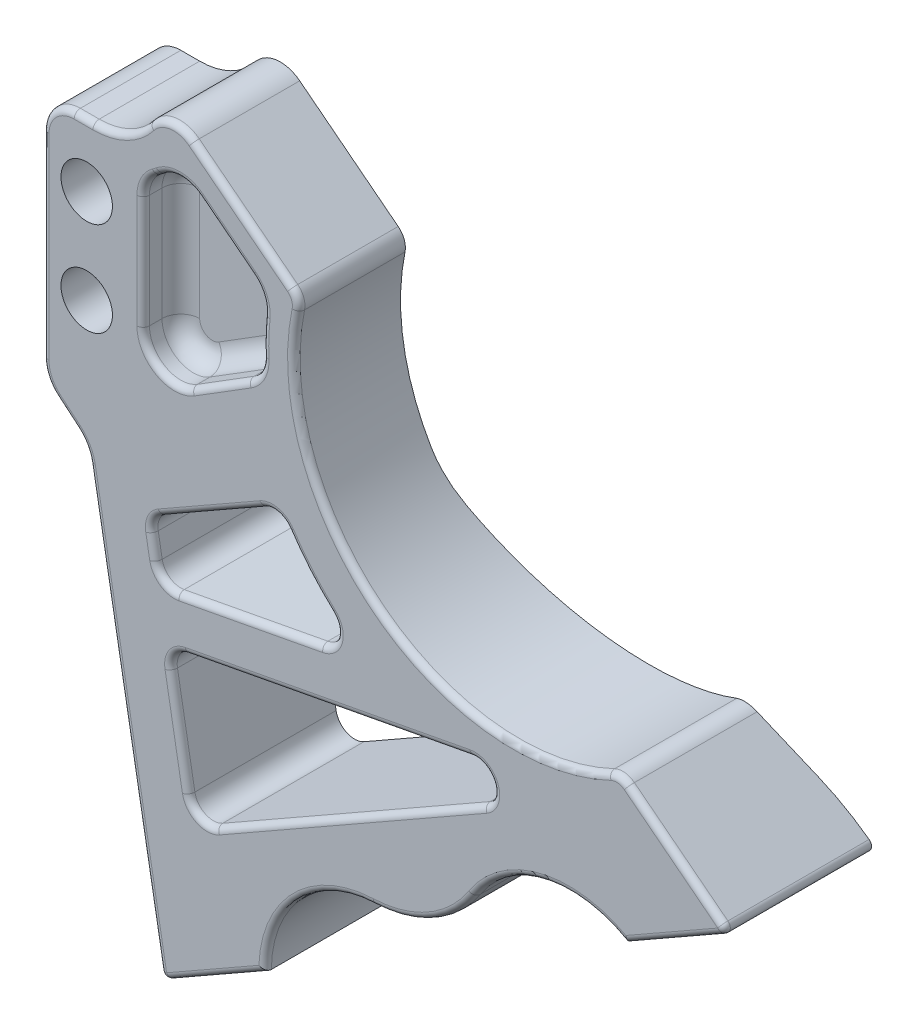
ISO-10303-21;
HEADER;
FILE_DESCRIPTION(('STEP AP214'),'2;1');
FILE_NAME('part.step','',(''),(''),'','','');
FILE_SCHEMA(('AUTOMOTIVE_DESIGN { 1 0 10303 214 1 1 1 1 }'));
ENDSEC;
DATA;
#1=APPLICATION_CONTEXT('core data for automotive mechanical design processes');
#2=APPLICATION_PROTOCOL_DEFINITION('international standard','automotive_design',2000,#1);
#3=PRODUCT_CONTEXT('',#1,'mechanical');
#4=PRODUCT('Part','Part','',(#3));
#5=PRODUCT_RELATED_PRODUCT_CATEGORY('part','',(#4));
#6=PRODUCT_DEFINITION_FORMATION('','',#4);
#7=PRODUCT_DEFINITION_CONTEXT('part definition',#1,'design');
#8=PRODUCT_DEFINITION('design','',#6,#7);
#9=PRODUCT_DEFINITION_SHAPE('','',#8);
#10=(LENGTH_UNIT() NAMED_UNIT(*) SI_UNIT(.MILLI.,.METRE.));
#11=(NAMED_UNIT(*) PLANE_ANGLE_UNIT() SI_UNIT($,.RADIAN.));
#12=(NAMED_UNIT(*) SI_UNIT($,.STERADIAN.) SOLID_ANGLE_UNIT());
#13=UNCERTAINTY_MEASURE_WITH_UNIT(LENGTH_MEASURE(1.E-05),#10,'distance_accuracy_value','');
#14=(GEOMETRIC_REPRESENTATION_CONTEXT(3) GLOBAL_UNCERTAINTY_ASSIGNED_CONTEXT((#13)) GLOBAL_UNIT_ASSIGNED_CONTEXT((#10,
#11,#12)) REPRESENTATION_CONTEXT('',''));
#15=CARTESIAN_POINT('',(0.,0.,0.));
#16=DIRECTION('',(0.,0.,1.));
#17=DIRECTION('',(1.,0.,0.));
#18=AXIS2_PLACEMENT_3D('',#15,#16,#17);
#19=CARTESIAN_POINT('',(14.,0.,43.));
#20=DIRECTION('',(0.,0.,-1.));
#21=DIRECTION('',(0.,1.,0.));
#22=AXIS2_PLACEMENT_3D('',#19,#20,#21);
#23=CYLINDRICAL_SURFACE('',#22,4.1);
#24=CARTESIAN_POINT('',(14.,0.,30.));
#25=DIRECTION('',(0.,0.,1.));
#26=DIRECTION('',(1.,0.,0.));
#27=AXIS2_PLACEMENT_3D('',#24,#25,#26);
#28=CIRCLE('',#27,4.1);
#29=CARTESIAN_POINT('',(18.1,0.,30.));
#30=VERTEX_POINT('',#29);
#31=EDGE_CURVE('E651',#30,#30,#28,.F.);
#32=ORIENTED_EDGE('',*,*,#31,.F.);
#33=EDGE_LOOP('',(#32));
#34=FACE_BOUND('',#33,.T.);
#35=CARTESIAN_POINT('',(14.,0.,21.2));
#36=DIRECTION('',(0.,0.,-1.));
#37=DIRECTION('',(0.,1.,0.));
#38=AXIS2_PLACEMENT_3D('',#35,#36,#37);
#39=CIRCLE('',#38,4.1);
#40=CARTESIAN_POINT('',(14.,4.1,21.2));
#41=VERTEX_POINT('',#40);
#42=EDGE_CURVE('E41',#41,#41,#39,.T.);
#43=ORIENTED_EDGE('',*,*,#42,.T.);
#44=EDGE_LOOP('',(#43));
#45=FACE_BOUND('',#44,.T.);
#46=ADVANCED_FACE('F37',(#34,#45),#23,.F.);
#47=CARTESIAN_POINT('',(14.,-15.,43.));
#48=DIRECTION('',(0.,0.,-1.));
#49=DIRECTION('',(0.,1.,0.));
#50=AXIS2_PLACEMENT_3D('',#47,#48,#49);
#51=CYLINDRICAL_SURFACE('',#50,4.1);
#52=CARTESIAN_POINT('',(14.,-15.,30.));
#53=DIRECTION('',(0.,0.,1.));
#54=DIRECTION('',(1.,0.,0.));
#55=AXIS2_PLACEMENT_3D('',#52,#53,#54);
#56=CIRCLE('',#55,4.1);
#57=CARTESIAN_POINT('',(18.1,-15.,30.));
#58=VERTEX_POINT('',#57);
#59=EDGE_CURVE('E648',#58,#58,#56,.F.);
#60=ORIENTED_EDGE('',*,*,#59,.F.);
#61=EDGE_LOOP('',(#60));
#62=FACE_BOUND('',#61,.T.);
#63=CARTESIAN_POINT('',(14.,-15.,21.2));
#64=DIRECTION('',(0.,0.,-1.));
#65=DIRECTION('',(0.,1.,0.));
#66=AXIS2_PLACEMENT_3D('',#63,#64,#65);
#67=CIRCLE('',#66,4.1);
#68=CARTESIAN_POINT('',(14.,-10.9,21.2));
#69=VERTEX_POINT('',#68);
#70=EDGE_CURVE('E951',#69,#69,#67,.T.);
#71=ORIENTED_EDGE('',*,*,#70,.T.);
#72=EDGE_LOOP('',(#71));
#73=FACE_BOUND('',#72,.T.);
#74=ADVANCED_FACE('F775',(#62,#73),#51,.F.);
#75=CARTESIAN_POINT('',(157.,-28.,13.));
#76=DIRECTION('',(0.,0.309086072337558,-0.951034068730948));
#77=DIRECTION('',(0.,0.951034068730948,0.309086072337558));
#78=AXIS2_PLACEMENT_3D('',#75,#76,#77);
#79=PLANE('',#78);
#80=DIRECTION('',(-1.,0.,0.));
#81=VECTOR('',#80,1.);
#82=CARTESIAN_POINT('',(157.,-44.9867119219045,7.47931862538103));
#83=LINE('',#82,#81);
#84=CARTESIAN_POINT('',(108.04335167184,-44.9867119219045,7.47931862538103));
#85=VERTEX_POINT('',#84);
#86=CARTESIAN_POINT('',(45.2188534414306,-44.9867119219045,7.47931862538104));
#87=VERTEX_POINT('',#86);
#88=EDGE_CURVE('E1380',#85,#87,#83,.T.);
#89=ORIENTED_EDGE('',*,*,#88,.T.);
#90=DIRECTION('',(0.980836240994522,0.185293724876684,0.0602204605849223));
#91=VECTOR('',#90,1.);
#92=CARTESIAN_POINT('',(156.170057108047,-24.0264731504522,14.291396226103));
#93=LINE('',#92,#91);
#94=CARTESIAN_POINT('',(51.426724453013,-43.8139580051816,7.86046364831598));
#95=VERTEX_POINT('',#94);
#96=EDGE_CURVE('E1325',#87,#95,#93,.T.);
#97=ORIENTED_EDGE('',*,*,#96,.T.);
#98=CARTESIAN_POINT('',(50.869832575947,-40.8660992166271,8.8185177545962));
#99=DIRECTION('',(0.,0.309086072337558,-0.951034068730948));
#100=DIRECTION('',(0.,0.951034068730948,0.309086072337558));
#101=AXIS2_PLACEMENT_3D('',#98,#99,#100);
#102=ELLIPSE('',#101,3.15446112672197,3.);
#103=CARTESIAN_POINT('',(52.9000608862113,-38.6574405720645,9.53633181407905));
#104=VERTEX_POINT('',#103);
#105=EDGE_CURVE('E1335',#95,#104,#102,.F.);
#106=ORIENTED_EDGE('',*,*,#105,.T.);
#107=CARTESIAN_POINT('',(82.,-6.99999999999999,19.825));
#108=DIRECTION('',(0.,0.309086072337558,-0.951034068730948));
#109=DIRECTION('',(0.,0.951034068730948,0.309086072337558));
#110=AXIS2_PLACEMENT_3D('',#107,#108,#109);
#111=ELLIPSE('',#110,45.2139428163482,43.);
#112=CARTESIAN_POINT('',(46.3298164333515,-31.0132880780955,12.020681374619));
#113=VERTEX_POINT('',#112);
#114=EDGE_CURVE('E621',#104,#113,#111,.T.);
#115=ORIENTED_EDGE('',*,*,#114,.T.);
#116=DIRECTION('',(-1.,0.,0.));
#117=VECTOR('',#116,1.);
#118=CARTESIAN_POINT('',(157.,-31.0132880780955,12.020681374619));
#119=LINE('',#118,#117);
#120=CARTESIAN_POINT('',(56.5370466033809,-31.0132880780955,12.020681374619));
#121=VERTEX_POINT('',#120);
#122=EDGE_CURVE('E722',#113,#121,#119,.F.);
#123=ORIENTED_EDGE('',*,*,#122,.T.);
#124=CARTESIAN_POINT('',(82.,-6.99999999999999,19.825));
#125=DIRECTION('',(0.,0.309086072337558,-0.951034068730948));
#126=DIRECTION('',(0.,-0.951034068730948,-0.309086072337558));
#127=AXIS2_PLACEMENT_3D('',#124,#125,#126);
#128=ELLIPSE('',#127,36.8020464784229,35.);
#129=CARTESIAN_POINT('',(97.1193728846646,-38.5658765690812,9.5660901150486));
#130=VERTEX_POINT('',#129);
#131=EDGE_CURVE('E688',#130,#121,#128,.T.);
#132=ORIENTED_EDGE('',*,*,#131,.F.);
#133=CARTESIAN_POINT('',(98.4153191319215,-41.2715231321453,8.68675498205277));
#134=DIRECTION('',(0.,0.309086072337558,-0.951034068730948));
#135=DIRECTION('',(0.,-0.951034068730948,-0.309086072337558));
#136=AXIS2_PLACEMENT_3D('',#133,#134,#135);
#137=ELLIPSE('',#136,3.15446112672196,3.);
#138=CARTESIAN_POINT('',(100.262303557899,-38.9074908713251,9.45506546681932));
#139=VERTEX_POINT('',#138);
#140=EDGE_CURVE('E1630',#130,#139,#137,.T.);
#141=ORIENTED_EDGE('',*,*,#140,.T.);
#142=DIRECTION('',(-0.772694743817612,0.603695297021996,0.196200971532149));
#143=VECTOR('',#142,1.);
#144=CARTESIAN_POINT('',(112.598860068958,-48.545865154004,6.3225938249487));
#145=LINE('',#144,#143);
#146=EDGE_CURVE('E686',#85,#139,#145,.T.);
#147=ORIENTED_EDGE('',*,*,#146,.F.);
#148=EDGE_LOOP('',(#89,#97,#106,#115,#123,#132,#141,#147));
#149=FACE_BOUND('',#148,.T.);
#150=ADVANCED_FACE('F781',(#149),#79,.T.);
#151=DIRECTION('',(0.165383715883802,-0.937937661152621,-0.304829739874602));
#152=VECTOR('',#151,1.);
#153=CARTESIAN_POINT('',(25.6041617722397,-48.9552347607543,6.18954870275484));
#154=LINE('',#153,#152);
#155=CARTESIAN_POINT('',(24.3960139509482,-42.1034879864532,8.4163664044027));
#156=VERTEX_POINT('',#155);
#157=CARTESIAN_POINT('',(24.9044041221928,-44.9867119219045,7.47931862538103));
#158=VERTEX_POINT('',#157);
#159=EDGE_CURVE('E1321',#156,#158,#154,.T.);
#160=ORIENTED_EDGE('',*,*,#159,.T.);
#161=DIRECTION('',(-1.,0.,0.));
#162=VECTOR('',#161,1.);
#163=CARTESIAN_POINT('',(157.,-44.9867119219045,7.47931862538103));
#164=LINE('',#163,#162);
#165=CARTESIAN_POINT('',(15.7655646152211,-44.9867119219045,7.47931862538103));
#166=VERTEX_POINT('',#165);
#167=EDGE_CURVE('E1356',#158,#166,#164,.T.);
#168=ORIENTED_EDGE('',*,*,#167,.T.);
#169=DIRECTION('',(0.165383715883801,-0.937937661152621,-0.304829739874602));
#170=VECTOR('',#169,1.);
#171=CARTESIAN_POINT('',(13.0287035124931,-29.4652013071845,12.523809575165));
#172=LINE('',#171,#170);
#173=CARTESIAN_POINT('',(14.379216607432,-37.1243416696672,10.0345889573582));
#174=VERTEX_POINT('',#173);
#175=EDGE_CURVE('E691',#174,#166,#172,.T.);
#176=ORIENTED_EDGE('',*,*,#175,.F.);
#177=CARTESIAN_POINT('',(8.47037008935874,-38.1662307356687,9.69597501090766));
#178=DIRECTION('',(0.,0.309086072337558,-0.951034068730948));
#179=DIRECTION('',(0.,0.951034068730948,0.309086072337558));
#180=AXIS2_PLACEMENT_3D('',#177,#178,#179);
#181=ELLIPSE('',#180,6.30892225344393,6.);
#182=CARTESIAN_POINT('',(12.327095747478,-33.5699640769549,11.1897616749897));
#183=VERTEX_POINT('',#182);
#184=EDGE_CURVE('E1406',#174,#183,#181,.F.);
#185=ORIENTED_EDGE('',*,*,#184,.T.);
#186=DIRECTION('',(0.749856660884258,-0.629204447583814,-0.20449144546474));
#187=VECTOR('',#186,1.);
#188=CARTESIAN_POINT('',(11.0456963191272,-32.494742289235,11.5392087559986));
#189=LINE('',#188,#187);
#190=CARTESIAN_POINT('',(9.28016794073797,-31.0132880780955,12.020681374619));
#191=VERTEX_POINT('',#190);
#192=EDGE_CURVE('E694',#191,#183,#189,.T.);
#193=ORIENTED_EDGE('',*,*,#192,.F.);
#194=CARTESIAN_POINT('',(39.8265071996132,-31.0132880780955,12.020681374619));
#195=VERTEX_POINT('',#194);
#196=EDGE_CURVE('E723',#191,#195,#119,.F.);
#197=ORIENTED_EDGE('',*,*,#196,.T.);
#198=DIRECTION('',(-0.857603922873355,-0.489127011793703,-0.158966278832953));
#199=VECTOR('',#198,1.);
#200=CARTESIAN_POINT('',(127.403310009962,18.9353872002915,28.2540008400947));
#201=LINE('',#200,#199);
#202=CARTESIAN_POINT('',(25.8641566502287,-38.976594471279,9.43260679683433));
#203=VERTEX_POINT('',#202);
#204=EDGE_CURVE('E644',#195,#203,#201,.T.);
#205=ORIENTED_EDGE('',*,*,#204,.T.);
#206=CARTESIAN_POINT('',(27.3504372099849,-41.5825434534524,8.58567337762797));
#207=DIRECTION('',(0.,0.309086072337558,-0.951034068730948));
#208=DIRECTION('',(0.,0.951034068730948,0.309086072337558));
#209=AXIS2_PLACEMENT_3D('',#206,#207,#208);
#210=ELLIPSE('',#209,3.15446112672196,3.);
#211=EDGE_CURVE('E1106',#203,#156,#210,.F.);
#212=ORIENTED_EDGE('',*,*,#211,.T.);
#213=EDGE_LOOP('',(#160,#168,#176,#185,#193,#197,#205,#212));
#214=FACE_BOUND('',#213,.T.);
#215=ADVANCED_FACE('F849',(#214),#79,.T.);
#216=CARTESIAN_POINT('',(116.332149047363,-51.4626301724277,30.));
#217=DIRECTION('',(0.495426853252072,-0.868649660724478,0.));
#218=DIRECTION('',(0.868649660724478,0.495426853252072,0.));
#219=AXIS2_PLACEMENT_3D('',#216,#217,#218);
#220=PLANE('',#219);
#221=DIRECTION('',(0.,0.,1.));
#222=VECTOR('',#221,1.);
#223=CARTESIAN_POINT('',(42.4198669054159,-93.6178637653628,-5.));
#224=LINE('',#223,#222);
#225=CARTESIAN_POINT('',(42.4198669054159,-93.6178637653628,6.5));
#226=VERTEX_POINT('',#225);
#227=CARTESIAN_POINT('',(42.4198669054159,-93.6178637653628,29.));
#228=VERTEX_POINT('',#227);
#229=EDGE_CURVE('E683',#226,#228,#224,.T.);
#230=ORIENTED_EDGE('',*,*,#229,.T.);
#231=DIRECTION('',(-0.868649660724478,-0.495426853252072,0.));
#232=VECTOR('',#231,1.);
#233=CARTESIAN_POINT('',(116.332149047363,-51.4626301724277,29.));
#234=LINE('',#233,#232);
#235=CARTESIAN_POINT('',(27.2262099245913,-102.283435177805,29.));
#236=VERTEX_POINT('',#235);
#237=EDGE_CURVE('E1120',#228,#236,#234,.T.);
#238=ORIENTED_EDGE('',*,*,#237,.T.);
#239=DIRECTION('',(0.,0.,-1.));
#240=VECTOR('',#239,1.);
#241=CARTESIAN_POINT('',(27.2262099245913,-102.283435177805,30.));
#242=LINE('',#241,#240);
#243=CARTESIAN_POINT('',(27.2262099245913,-102.283435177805,6.5));
#244=VERTEX_POINT('',#243);
#245=EDGE_CURVE('E1401',#236,#244,#242,.T.);
#246=ORIENTED_EDGE('',*,*,#245,.T.);
#247=DIRECTION('',(0.868649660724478,0.495426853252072,0.));
#248=VECTOR('',#247,1.);
#249=CARTESIAN_POINT('',(116.332149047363,-51.4626301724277,6.5));
#250=LINE('',#249,#248);
#251=EDGE_CURVE('E593',#244,#226,#250,.T.);
#252=ORIENTED_EDGE('',*,*,#251,.T.);
#253=EDGE_LOOP('',(#230,#238,#246,#252));
#254=FACE_BOUND('',#253,.T.);
#255=CARTESIAN_POINT('',(35.5477305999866,-97.5373275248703,15.5));
#256=DIRECTION('',(0.495426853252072,-0.868649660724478,0.));
#257=DIRECTION('',(0.868649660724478,0.495426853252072,0.));
#258=AXIS2_PLACEMENT_3D('',#255,#256,#257);
#259=CIRCLE('',#258,3.39999999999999);
#260=CARTESIAN_POINT('',(38.5011394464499,-95.8528762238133,15.5));
#261=VERTEX_POINT('',#260);
#262=EDGE_CURVE('E548',#261,#261,#259,.F.);
#263=ORIENTED_EDGE('',*,*,#262,.T.);
#264=EDGE_LOOP('',(#263));
#265=FACE_BOUND('',#264,.T.);
#266=ADVANCED_FACE('F851',(#254,#265),#220,.T.);
#267=DIRECTION('',(0.,0.,-1.));
#268=VECTOR('',#267,1.);
#269=CARTESIAN_POINT('',(115.036970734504,-52.2013239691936,30.));
#270=LINE('',#269,#268);
#271=CARTESIAN_POINT('',(115.036970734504,-52.2013239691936,6.5));
#272=VERTEX_POINT('',#271);
#273=CARTESIAN_POINT('',(115.036970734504,-52.2013239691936,29.));
#274=VERTEX_POINT('',#273);
#275=EDGE_CURVE('E1397',#272,#274,#270,.F.);
#276=ORIENTED_EDGE('',*,*,#275,.T.);
#277=DIRECTION('',(-0.868649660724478,-0.495426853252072,0.));
#278=VECTOR('',#277,1.);
#279=CARTESIAN_POINT('',(116.332149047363,-51.4626301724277,29.));
#280=LINE('',#279,#278);
#281=CARTESIAN_POINT('',(99.9046438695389,-60.8319162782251,29.));
#282=VERTEX_POINT('',#281);
#283=EDGE_CURVE('E1147',#274,#282,#280,.T.);
#284=ORIENTED_EDGE('',*,*,#283,.T.);
#285=DIRECTION('',(0.,0.,1.));
#286=VECTOR('',#285,1.);
#287=CARTESIAN_POINT('',(99.9046438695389,-60.8319162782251,-5.));
#288=LINE('',#287,#286);
#289=CARTESIAN_POINT('',(99.9046438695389,-60.8319162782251,6.5));
#290=VERTEX_POINT('',#289);
#291=EDGE_CURVE('E679',#282,#290,#288,.F.);
#292=ORIENTED_EDGE('',*,*,#291,.T.);
#293=DIRECTION('',(0.868649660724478,0.495426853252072,0.));
#294=VECTOR('',#293,1.);
#295=CARTESIAN_POINT('',(116.332149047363,-51.4626301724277,6.5));
#296=LINE('',#295,#294);
#297=EDGE_CURVE('E581',#290,#272,#296,.T.);
#298=ORIENTED_EDGE('',*,*,#297,.T.);
#299=EDGE_LOOP('',(#276,#284,#292,#298));
#300=FACE_BOUND('',#299,.T.);
#301=CARTESIAN_POINT('',(106.777002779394,-56.9123255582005,15.5));
#302=DIRECTION('',(0.495426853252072,-0.868649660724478,0.));
#303=DIRECTION('',(0.868649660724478,0.495426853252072,0.));
#304=AXIS2_PLACEMENT_3D('',#301,#302,#303);
#305=CIRCLE('',#304,3.39999999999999);
#306=CARTESIAN_POINT('',(109.730411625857,-55.2278742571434,15.5));
#307=VERTEX_POINT('',#306);
#308=EDGE_CURVE('E542',#307,#307,#305,.F.);
#309=ORIENTED_EDGE('',*,*,#308,.T.);
#310=EDGE_LOOP('',(#309));
#311=FACE_BOUND('',#310,.T.);
#312=ADVANCED_FACE('F756',(#300,#311),#220,.T.);
#313=CARTESIAN_POINT('',(116.332149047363,-51.4626301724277,30.));
#314=DIRECTION('',(0.615661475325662,0.788010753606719,0.));
#315=DIRECTION('',(-0.788010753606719,0.615661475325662,0.));
#316=AXIS2_PLACEMENT_3D('',#313,#314,#315);
#317=PLANE('',#316);
#318=DIRECTION('',(0.,0.,-1.));
#319=VECTOR('',#318,1.);
#320=CARTESIAN_POINT('',(100.262303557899,-38.9074908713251,30.));
#321=LINE('',#320,#319);
#322=CARTESIAN_POINT('',(100.262303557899,-38.9074908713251,29.));
#323=VERTEX_POINT('',#322);
#324=EDGE_CURVE('E1626',#139,#323,#321,.F.);
#325=ORIENTED_EDGE('',*,*,#324,.T.);
#326=DIRECTION('',(0.788010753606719,-0.615661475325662,0.));
#327=VECTOR('',#326,1.);
#328=CARTESIAN_POINT('',(116.332149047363,-51.4626301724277,29.));
#329=LINE('',#328,#327);
#330=CARTESIAN_POINT('',(115.157205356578,-50.5446635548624,29.));
#331=VERTEX_POINT('',#330);
#332=EDGE_CURVE('E1151',#323,#331,#329,.T.);
#333=ORIENTED_EDGE('',*,*,#332,.T.);
#334=DIRECTION('',(0.,0.,-1.));
#335=VECTOR('',#334,1.);
#336=CARTESIAN_POINT('',(115.157205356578,-50.5446635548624,30.));
#337=LINE('',#336,#335);
#338=CARTESIAN_POINT('',(115.157205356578,-50.5446635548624,6.50972958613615));
#339=VERTEX_POINT('',#338);
#340=EDGE_CURVE('E1402',#331,#339,#337,.T.);
#341=ORIENTED_EDGE('',*,*,#340,.T.);
#342=CARTESIAN_POINT('',(115.955594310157,-51.1684333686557,26.5));
#343=DIRECTION('',(0.615661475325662,0.788010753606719,0.));
#344=DIRECTION('',(-0.788010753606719,0.615661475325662,0.));
#345=AXIS2_PLACEMENT_3D('',#342,#343,#344);
#346=ELLIPSE('',#345,32.4853849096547,20.);
#347=EDGE_CURVE('E1808',#339,#85,#346,.T.);
#348=ORIENTED_EDGE('',*,*,#347,.T.);
#349=ORIENTED_EDGE('',*,*,#146,.T.);
#350=EDGE_LOOP('',(#325,#333,#341,#348,#349));
#351=FACE_BOUND('',#350,.T.);
#352=ADVANCED_FACE('F752',(#351),#317,.T.);
#353=CARTESIAN_POINT('',(14.,-34.973697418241,30.));
#354=DIRECTION('',(-0.984807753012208,-0.173648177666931,0.));
#355=DIRECTION('',(0.173648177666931,-0.984807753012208,0.));
#356=AXIS2_PLACEMENT_3D('',#353,#354,#355);
#357=PLANE('',#356);
#358=DIRECTION('',(0.,0.,-1.));
#359=VECTOR('',#358,1.);
#360=CARTESIAN_POINT('',(25.745975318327,-101.588433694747,30.));
#361=LINE('',#360,#359);
#362=CARTESIAN_POINT('',(25.745975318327,-101.588433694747,6.5));
#363=VERTEX_POINT('',#362);
#364=CARTESIAN_POINT('',(25.745975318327,-101.588433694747,29.));
#365=VERTEX_POINT('',#364);
#366=EDGE_CURVE('E1404',#363,#365,#361,.F.);
#367=ORIENTED_EDGE('',*,*,#366,.T.);
#368=DIRECTION('',(-0.173648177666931,0.984807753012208,0.));
#369=VECTOR('',#368,1.);
#370=CARTESIAN_POINT('',(14.,-34.973697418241,29.));
#371=LINE('',#370,#369);
#372=CARTESIAN_POINT('',(14.379216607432,-37.1243416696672,29.));
#373=VERTEX_POINT('',#372);
#374=EDGE_CURVE('E1129',#365,#373,#371,.T.);
#375=ORIENTED_EDGE('',*,*,#374,.T.);
#376=DIRECTION('',(0.,0.,-1.));
#377=VECTOR('',#376,1.);
#378=CARTESIAN_POINT('',(14.379216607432,-37.1243416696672,10.7335483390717));
#379=LINE('',#378,#377);
#380=EDGE_CURVE('E1629',#373,#174,#379,.T.);
#381=ORIENTED_EDGE('',*,*,#380,.T.);
#382=ORIENTED_EDGE('',*,*,#175,.T.);
#383=CARTESIAN_POINT('',(16.8555688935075,-51.1684333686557,26.5));
#384=DIRECTION('',(-0.984807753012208,-0.173648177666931,0.));
#385=DIRECTION('',(-0.173648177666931,0.984807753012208,0.));
#386=AXIS2_PLACEMENT_3D('',#383,#384,#385);
#387=ELLIPSE('',#386,20.3085322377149,20.);
#388=CARTESIAN_POINT('',(16.8555688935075,-51.1684333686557,6.5));
#389=VERTEX_POINT('',#388);
#390=EDGE_CURVE('E1359',#166,#389,#387,.T.);
#391=ORIENTED_EDGE('',*,*,#390,.T.);
#392=DIRECTION('',(0.173648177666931,-0.984807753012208,0.));
#393=VECTOR('',#392,1.);
#394=CARTESIAN_POINT('',(14.,-34.973697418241,6.5));
#395=LINE('',#394,#393);
#396=EDGE_CURVE('E579',#389,#363,#395,.T.);
#397=ORIENTED_EDGE('',*,*,#396,.T.);
#398=EDGE_LOOP('',(#367,#375,#381,#382,#391,#397));
#399=FACE_BOUND('',#398,.T.);
#400=ADVANCED_FACE('F755',(#399),#357,.T.);
#401=CARTESIAN_POINT('',(58.9103355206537,-55.7424147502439,-5.));
#402=DIRECTION('',(0.,0.,1.));
#403=DIRECTION('',(1.,0.,0.));
#404=AXIS2_PLACEMENT_3D('',#401,#402,#403);
#405=CYLINDRICAL_SURFACE('',#404,20.);
#406=DIRECTION('',(0.,0.,1.));
#407=VECTOR('',#406,1.);
#408=CARTESIAN_POINT('',(75.7062523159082,-66.6004614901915,-5.));
#409=LINE('',#408,#407);
#410=CARTESIAN_POINT('',(75.7062523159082,-66.6004614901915,6.5));
#411=VERTEX_POINT('',#410);
#412=CARTESIAN_POINT('',(75.7062523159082,-66.6004614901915,29.));
#413=VERTEX_POINT('',#412);
#414=EDGE_CURVE('E658',#411,#413,#409,.T.);
#415=ORIENTED_EDGE('',*,*,#414,.T.);
#416=CARTESIAN_POINT('',(58.9103355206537,-55.7424147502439,29.));
#417=DIRECTION('',(0.,0.,1.));
#418=DIRECTION('',(1.,0.,0.));
#419=AXIS2_PLACEMENT_3D('',#416,#417,#418);
#420=CIRCLE('',#419,20.);
#421=CARTESIAN_POINT('',(59.7048065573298,-75.7266289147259,29.));
#422=VERTEX_POINT('',#421);
#423=EDGE_CURVE('E1293',#413,#422,#420,.F.);
#424=ORIENTED_EDGE('',*,*,#423,.T.);
#425=DIRECTION('',(0.,0.,1.));
#426=VECTOR('',#425,1.);
#427=CARTESIAN_POINT('',(59.7048065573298,-75.7266289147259,-5.));
#428=LINE('',#427,#426);
#429=CARTESIAN_POINT('',(59.7048065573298,-75.7266289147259,6.5));
#430=VERTEX_POINT('',#429);
#431=EDGE_CURVE('E676',#430,#422,#428,.T.);
#432=ORIENTED_EDGE('',*,*,#431,.F.);
#433=CARTESIAN_POINT('',(58.9103355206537,-55.7424147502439,6.5));
#434=DIRECTION('',(0.,0.,-1.));
#435=DIRECTION('',(-1.,0.,0.));
#436=AXIS2_PLACEMENT_3D('',#433,#434,#435);
#437=CIRCLE('',#436,20.);
#438=EDGE_CURVE('E590',#430,#411,#437,.F.);
#439=ORIENTED_EDGE('',*,*,#438,.T.);
#440=EDGE_LOOP('',(#415,#424,#432,#439));
#441=FACE_BOUND('',#440,.T.);
#442=ADVANCED_FACE('F834',(#441),#405,.T.);
#443=CARTESIAN_POINT('',(60.4198393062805,-93.712643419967,-5.));
#444=DIRECTION('',(0.,0.,1.));
#445=DIRECTION('',(1.,0.,0.));
#446=AXIS2_PLACEMENT_3D('',#443,#444,#445);
#447=CYLINDRICAL_SURFACE('',#446,18.0002219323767);
#448=ORIENTED_EDGE('',*,*,#431,.T.);
#449=CARTESIAN_POINT('',(60.4198393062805,-93.712643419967,29.));
#450=DIRECTION('',(0.,0.,1.));
#451=DIRECTION('',(1.,0.,0.));
#452=AXIS2_PLACEMENT_3D('',#449,#450,#451);
#453=CIRCLE('',#452,18.0002219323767);
#454=EDGE_CURVE('E1290',#422,#228,#453,.T.);
#455=ORIENTED_EDGE('',*,*,#454,.T.);
#456=ORIENTED_EDGE('',*,*,#229,.F.);
#457=CARTESIAN_POINT('',(60.4198393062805,-93.712643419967,6.5));
#458=DIRECTION('',(0.,0.,-1.));
#459=DIRECTION('',(-1.,0.,0.));
#460=AXIS2_PLACEMENT_3D('',#457,#458,#459);
#461=CIRCLE('',#460,18.0002219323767);
#462=EDGE_CURVE('E596',#226,#430,#461,.T.);
#463=ORIENTED_EDGE('',*,*,#462,.T.);
#464=EDGE_LOOP('',(#448,#455,#456,#463));
#465=FACE_BOUND('',#464,.T.);
#466=ADVANCED_FACE('F837',(#465),#447,.F.);
#467=CARTESIAN_POINT('',(90.8225774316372,-76.3727035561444,-5.));
#468=DIRECTION('',(0.,0.,1.));
#469=DIRECTION('',(1.,0.,0.));
#470=AXIS2_PLACEMENT_3D('',#467,#468,#469);
#471=CYLINDRICAL_SURFACE('',#470,18.);
#472=ORIENTED_EDGE('',*,*,#291,.F.);
#473=CARTESIAN_POINT('',(90.8225774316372,-76.3727035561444,29.));
#474=DIRECTION('',(0.,0.,1.));
#475=DIRECTION('',(1.,0.,0.));
#476=AXIS2_PLACEMENT_3D('',#473,#474,#475);
#477=CIRCLE('',#476,18.);
#478=EDGE_CURVE('E1154',#282,#413,#477,.T.);
#479=ORIENTED_EDGE('',*,*,#478,.T.);
#480=ORIENTED_EDGE('',*,*,#414,.F.);
#481=CARTESIAN_POINT('',(90.8225774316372,-76.3727035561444,6.5));
#482=DIRECTION('',(0.,0.,-1.));
#483=DIRECTION('',(-1.,0.,0.));
#484=AXIS2_PLACEMENT_3D('',#481,#482,#483);
#485=CIRCLE('',#484,18.);
#486=EDGE_CURVE('E587',#411,#290,#485,.T.);
#487=ORIENTED_EDGE('',*,*,#486,.T.);
#488=EDGE_LOOP('',(#472,#479,#480,#487));
#489=FACE_BOUND('',#488,.T.);
#490=ADVANCED_FACE('F839',(#489),#471,.F.);
#491=CARTESIAN_POINT('',(114.541543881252,-51.3326743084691,30.));
#492=DIRECTION('',(0.,0.,-1.));
#493=DIRECTION('',(-1.,0.,0.));
#494=AXIS2_PLACEMENT_3D('',#491,#492,#493);
#495=CYLINDRICAL_SURFACE('',#494,1.);
#496=ORIENTED_EDGE('',*,*,#340,.F.);
#497=CARTESIAN_POINT('',(114.541543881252,-51.3326743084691,29.));
#498=DIRECTION('',(0.,0.,-1.));
#499=DIRECTION('',(-1.,0.,0.));
#500=AXIS2_PLACEMENT_3D('',#497,#498,#499);
#501=CIRCLE('',#500,1.);
#502=EDGE_CURVE('E1149',#331,#274,#501,.T.);
#503=ORIENTED_EDGE('',*,*,#502,.T.);
#504=ORIENTED_EDGE('',*,*,#275,.F.);
#505=CARTESIAN_POINT('',(114.541543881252,-51.3326743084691,6.5));
#506=DIRECTION('',(0.,0.,-1.));
#507=DIRECTION('',(-1.,0.,0.));
#508=AXIS2_PLACEMENT_3D('',#505,#506,#507);
#509=CIRCLE('',#508,1.);
#510=CARTESIAN_POINT('',(115.52796413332,-51.1684333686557,6.5));
#511=VERTEX_POINT('',#510);
#512=EDGE_CURVE('E576',#272,#511,#509,.F.);
#513=ORIENTED_EDGE('',*,*,#512,.T.);
#514=CARTESIAN_POINT('',(115.52796413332,-51.1684333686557,6.5));
#515=CARTESIAN_POINT('',(115.523349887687,-51.1407226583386,6.49999969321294));
#516=CARTESIAN_POINT('',(115.517570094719,-51.113219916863,6.50005765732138));
#517=CARTESIAN_POINT('',(115.503719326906,-51.0587988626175,6.50028202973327));
#518=CARTESIAN_POINT('',(115.495648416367,-51.0318805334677,6.50044843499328));
#519=CARTESIAN_POINT('',(115.468051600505,-50.9522329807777,6.50109833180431));
#520=CARTESIAN_POINT('',(115.445145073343,-50.9006318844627,6.50173249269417));
#521=CARTESIAN_POINT('',(115.39099681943,-50.8020115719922,6.50329581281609));
#522=CARTESIAN_POINT('',(115.359749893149,-50.7549952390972,6.50422515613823));
#523=CARTESIAN_POINT('',(115.28986583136,-50.6669748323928,6.50623916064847));
#524=CARTESIAN_POINT('',(115.251247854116,-50.6259556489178,6.5073234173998));
#525=CARTESIAN_POINT('',(115.192577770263,-50.5732805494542,6.50885128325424));
#526=CARTESIAN_POINT('',(115.175127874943,-50.5586591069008,6.50929276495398));
#527=CARTESIAN_POINT('',(115.157205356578,-50.5446635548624,6.50972958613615));
#528=B_SPLINE_CURVE_WITH_KNOTS('',3,(#514,#515,#516,#517,#518,#519,#520,#521,#522,#523,#524,
#525,#526,#527),.UNSPECIFIED.,.F.,.F.,(4,2,2,2,2,2,4),(0.,0.08422452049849,0.168446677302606,
0.336953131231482,0.505564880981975,0.673744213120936,0.741997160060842),.UNSPECIFIED.);
#529=EDGE_CURVE('E1046',#511,#339,#528,.T.);
#530=ORIENTED_EDGE('',*,*,#529,.T.);
#531=EDGE_LOOP('',(#496,#503,#504,#513,#530));
#532=FACE_BOUND('',#531,.T.);
#533=ADVANCED_FACE('F842',(#532),#495,.T.);
#534=CARTESIAN_POINT('',(26.7307830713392,-101.41478551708,30.));
#535=DIRECTION('',(0.,0.,-1.));
#536=DIRECTION('',(-1.,0.,0.));
#537=AXIS2_PLACEMENT_3D('',#534,#535,#536);
#538=CYLINDRICAL_SURFACE('',#537,1.);
#539=ORIENTED_EDGE('',*,*,#245,.F.);
#540=CARTESIAN_POINT('',(26.7307830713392,-101.41478551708,29.));
#541=DIRECTION('',(0.,0.,-1.));
#542=DIRECTION('',(-1.,0.,0.));
#543=AXIS2_PLACEMENT_3D('',#540,#541,#542);
#544=CIRCLE('',#543,1.);
#545=EDGE_CURVE('E1127',#236,#365,#544,.T.);
#546=ORIENTED_EDGE('',*,*,#545,.T.);
#547=ORIENTED_EDGE('',*,*,#366,.F.);
#548=CARTESIAN_POINT('',(26.7307830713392,-101.41478551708,6.5));
#549=DIRECTION('',(0.,0.,-1.));
#550=DIRECTION('',(-1.,0.,0.));
#551=AXIS2_PLACEMENT_3D('',#548,#549,#550);
#552=CIRCLE('',#551,1.);
#553=EDGE_CURVE('E584',#363,#244,#552,.F.);
#554=ORIENTED_EDGE('',*,*,#553,.T.);
#555=EDGE_LOOP('',(#539,#546,#547,#554));
#556=FACE_BOUND('',#555,.T.);
#557=ADVANCED_FACE('F1654',(#556),#538,.T.);
#558=CARTESIAN_POINT('',(51.426724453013,-43.8139580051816,-19.));
#559=DIRECTION('',(-0.185630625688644,0.982619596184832,0.));
#560=DIRECTION('',(-0.982619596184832,-0.185630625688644,0.));
#561=AXIS2_PLACEMENT_3D('',#558,#559,#560);
#562=PLANE('',#561);
#563=DIRECTION('',(0.,0.,1.));
#564=VECTOR('',#563,1.);
#565=CARTESIAN_POINT('',(28.5432633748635,-48.1369648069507,-19.));
#566=LINE('',#565,#564);
#567=CARTESIAN_POINT('',(28.5432633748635,-48.1369648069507,6.7310799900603));
#568=VERTEX_POINT('',#567);
#569=CARTESIAN_POINT('',(28.5432633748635,-48.1369648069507,29.));
#570=VERTEX_POINT('',#569);
#571=EDGE_CURVE('E634',#568,#570,#566,.T.);
#572=ORIENTED_EDGE('',*,*,#571,.T.);
#573=DIRECTION('',(-0.982619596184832,-0.185630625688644,0.));
#574=VECTOR('',#573,1.);
#575=CARTESIAN_POINT('',(51.426724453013,-43.8139580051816,29.));
#576=LINE('',#575,#574);
#577=CARTESIAN_POINT('',(51.426724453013,-43.8139580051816,29.));
#578=VERTEX_POINT('',#577);
#579=EDGE_CURVE('E1306',#570,#578,#576,.F.);
#580=ORIENTED_EDGE('',*,*,#579,.T.);
#581=DIRECTION('',(0.,0.,1.));
#582=VECTOR('',#581,1.);
#583=CARTESIAN_POINT('',(51.426724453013,-43.8139580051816,-19.));
#584=LINE('',#583,#582);
#585=EDGE_CURVE('E631',#95,#578,#584,.T.);
#586=ORIENTED_EDGE('',*,*,#585,.F.);
#587=ORIENTED_EDGE('',*,*,#96,.F.);
#588=CARTESIAN_POINT('',(12.4964478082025,-51.1684333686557,26.5));
#589=DIRECTION('',(-0.185630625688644,0.982619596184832,0.));
#590=DIRECTION('',(-0.982619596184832,-0.185630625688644,0.));
#591=AXIS2_PLACEMENT_3D('',#588,#589,#590);
#592=ELLIPSE('',#591,107.740842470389,20.);
#593=EDGE_CURVE('E1074',#87,#568,#592,.T.);
#594=ORIENTED_EDGE('',*,*,#593,.T.);
#595=EDGE_LOOP('',(#572,#580,#586,#587,#594));
#596=FACE_BOUND('',#595,.T.);
#597=ADVANCED_FACE('F1080',(#596),#562,.T.);
#598=CARTESIAN_POINT('',(27.9863714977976,-45.1891060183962,-19.));
#599=DIRECTION('',(0.,0.,1.));
#600=DIRECTION('',(1.,0.,0.));
#601=AXIS2_PLACEMENT_3D('',#598,#599,#600);
#602=CYLINDRICAL_SURFACE('',#601,3.00000000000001);
#603=DIRECTION('',(0.,0.,1.));
#604=VECTOR('',#603,1.);
#605=CARTESIAN_POINT('',(25.031948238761,-45.710050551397,-19.));
#606=LINE('',#605,#604);
#607=CARTESIAN_POINT('',(25.031948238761,-45.710050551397,7.25926048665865));
#608=VERTEX_POINT('',#607);
#609=CARTESIAN_POINT('',(25.031948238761,-45.710050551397,29.));
#610=VERTEX_POINT('',#609);
#611=EDGE_CURVE('E637',#608,#610,#606,.T.);
#612=ORIENTED_EDGE('',*,*,#611,.T.);
#613=CARTESIAN_POINT('',(27.9863714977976,-45.1891060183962,29.));
#614=DIRECTION('',(0.,0.,1.));
#615=DIRECTION('',(1.,0.,0.));
#616=AXIS2_PLACEMENT_3D('',#613,#614,#615);
#617=CIRCLE('',#616,3.00000000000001);
#618=EDGE_CURVE('E46',#610,#570,#617,.T.);
#619=ORIENTED_EDGE('',*,*,#618,.T.);
#620=ORIENTED_EDGE('',*,*,#571,.F.);
#621=CARTESIAN_POINT('',(28.5432633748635,-48.1369648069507,6.7310799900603));
#622=CARTESIAN_POINT('',(28.46130489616,-48.1524565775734,6.72870828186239));
#623=CARTESIAN_POINT('',(28.3786862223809,-48.1645156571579,6.72687395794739));
#624=CARTESIAN_POINT('',(28.2127191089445,-48.1817158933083,6.72426651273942));
#625=CARTESIAN_POINT('',(28.1293707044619,-48.1868573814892,6.72349334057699));
#626=CARTESIAN_POINT('',(27.9625930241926,-48.190170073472,6.72299460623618));
#627=CARTESIAN_POINT('',(27.8791638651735,-48.1883468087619,6.72326821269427));
#628=CARTESIAN_POINT('',(27.7127798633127,-48.1777690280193,6.72486541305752));
#629=CARTESIAN_POINT('',(27.6298250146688,-48.1690145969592,6.72618899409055));
#630=CARTESIAN_POINT('',(27.3824656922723,-48.1324070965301,6.73176211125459));
#631=CARTESIAN_POINT('',(27.2194980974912,-48.0942111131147,6.73761379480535));
#632=CARTESIAN_POINT('',(26.9024763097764,-47.9914220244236,6.75387979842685));
#633=CARTESIAN_POINT('',(26.7484208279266,-47.9268327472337,6.76429345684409));
#634=CARTESIAN_POINT('',(26.4534031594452,-47.773221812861,6.79013994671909));
#635=CARTESIAN_POINT('',(26.3124440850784,-47.6841943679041,6.80557396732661));
#636=CARTESIAN_POINT('',(26.0476224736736,-47.4844841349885,6.84195371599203));
#637=CARTESIAN_POINT('',(25.9237602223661,-47.3738009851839,6.86289953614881));
#638=CARTESIAN_POINT('',(25.6960996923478,-47.1338673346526,6.91078720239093));
#639=CARTESIAN_POINT('',(25.5923674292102,-47.0045580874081,6.93774817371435));
#640=CARTESIAN_POINT('',(25.4080556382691,-46.7316346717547,6.99783826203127));
#641=CARTESIAN_POINT('',(25.327477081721,-46.5880199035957,7.03096763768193));
#642=CARTESIAN_POINT('',(25.205740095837,-46.3225342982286,7.09557476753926));
#643=CARTESIAN_POINT('',(25.1598440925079,-46.202523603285,7.12590887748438));
#644=CARTESIAN_POINT('',(25.0839418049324,-45.9586776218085,7.19003974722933));
#645=CARTESIAN_POINT('',(25.0539115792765,-45.834848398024,7.22383119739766));
#646=CARTESIAN_POINT('',(25.031948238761,-45.710050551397,7.25926048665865));
#647=B_SPLINE_CURVE_WITH_KNOTS('',3,(#621,#622,#623,#624,#625,#626,#627,#628,#629,#630,#631,
#632,#633,#634,#635,#636,#637,#638,#639,#640,#641,#642,#643,#644,#645,#646),.UNSPECIFIED.,.F.,
.F.,(4,2,2,2,2,2,2,2,2,2,2,2,4),(0.,0.250248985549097,0.500485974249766,0.750524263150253,
1.0005594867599,1.50042744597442,2.00022293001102,2.50013688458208,3.00005919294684,
3.50159425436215,4.00315035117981,4.39818166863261,4.79261517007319),.UNSPECIFIED.);
#648=EDGE_CURVE('E1066',#568,#608,#647,.T.);
#649=ORIENTED_EDGE('',*,*,#648,.T.);
#650=EDGE_LOOP('',(#612,#619,#620,#649));
#651=FACE_BOUND('',#650,.T.);
#652=ADVANCED_FACE('F1024',(#651),#602,.F.);
#653=CARTESIAN_POINT('',(33.1909989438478,-74.7060150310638,-19.));
#654=DIRECTION('',(0.,0.,1.));
#655=DIRECTION('',(1.,0.,0.));
#656=AXIS2_PLACEMENT_3D('',#653,#654,#655);
#657=CYLINDRICAL_SURFACE('',#656,3.);
#658=DIRECTION('',(0.,0.,1.));
#659=VECTOR('',#658,1.);
#660=CARTESIAN_POINT('',(30.2365756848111,-75.2269595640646,-19.));
#661=LINE('',#660,#659);
#662=CARTESIAN_POINT('',(30.2365756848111,-75.2269595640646,6.5));
#663=VERTEX_POINT('',#662);
#664=CARTESIAN_POINT('',(30.2365756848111,-75.2269595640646,29.));
#665=VERTEX_POINT('',#664);
#666=EDGE_CURVE('E607',#663,#665,#661,.T.);
#667=ORIENTED_EDGE('',*,*,#666,.T.);
#668=CARTESIAN_POINT('',(33.1909989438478,-74.7060150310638,29.));
#669=DIRECTION('',(0.,0.,1.));
#670=DIRECTION('',(1.,0.,0.));
#671=AXIS2_PLACEMENT_3D('',#668,#669,#670);
#672=CIRCLE('',#671,3.);
#673=CARTESIAN_POINT('',(34.677279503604,-77.3119640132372,29.));
#674=VERTEX_POINT('',#673);
#675=EDGE_CURVE('E1295',#665,#674,#672,.T.);
#676=ORIENTED_EDGE('',*,*,#675,.T.);
#677=DIRECTION('',(0.,0.,1.));
#678=VECTOR('',#677,1.);
#679=CARTESIAN_POINT('',(34.677279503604,-77.3119640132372,-19.));
#680=LINE('',#679,#678);
#681=CARTESIAN_POINT('',(34.677279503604,-77.3119640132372,6.5));
#682=VERTEX_POINT('',#681);
#683=EDGE_CURVE('E604',#682,#674,#680,.T.);
#684=ORIENTED_EDGE('',*,*,#683,.F.);
#685=CARTESIAN_POINT('',(33.1909989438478,-74.7060150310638,6.5));
#686=DIRECTION('',(0.,0.,-1.));
#687=DIRECTION('',(-1.,0.,0.));
#688=AXIS2_PLACEMENT_3D('',#685,#686,#687);
#689=CIRCLE('',#688,3.);
#690=EDGE_CURVE('E568',#682,#663,#689,.T.);
#691=ORIENTED_EDGE('',*,*,#690,.T.);
#692=EDGE_LOOP('',(#667,#676,#684,#691));
#693=FACE_BOUND('',#692,.T.);
#694=ADVANCED_FACE('F1021',(#693),#657,.F.);
#695=CARTESIAN_POINT('',(75.8007020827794,-50.4039377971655,-19.));
#696=DIRECTION('',(0.,0.,1.));
#697=DIRECTION('',(1.,0.,0.));
#698=AXIS2_PLACEMENT_3D('',#695,#696,#697);
#699=CYLINDRICAL_SURFACE('',#698,2.99999999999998);
#700=DIRECTION('',(0.,0.,1.));
#701=VECTOR('',#700,1.);
#702=CARTESIAN_POINT('',(77.2869826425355,-53.009886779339,-19.));
#703=LINE('',#702,#701);
#704=CARTESIAN_POINT('',(77.2869826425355,-53.009886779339,6.5));
#705=VERTEX_POINT('',#704);
#706=CARTESIAN_POINT('',(77.2869826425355,-53.009886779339,29.));
#707=VERTEX_POINT('',#706);
#708=EDGE_CURVE('E600',#705,#707,#703,.T.);
#709=ORIENTED_EDGE('',*,*,#708,.T.);
#710=CARTESIAN_POINT('',(75.8007020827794,-50.4039377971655,29.));
#711=DIRECTION('',(0.,0.,1.));
#712=DIRECTION('',(1.,0.,0.));
#713=AXIS2_PLACEMENT_3D('',#710,#711,#712);
#714=CIRCLE('',#713,2.99999999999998);
#715=CARTESIAN_POINT('',(75.2438102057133,-47.4560790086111,29.));
#716=VERTEX_POINT('',#715);
#717=EDGE_CURVE('E1300',#707,#716,#714,.T.);
#718=ORIENTED_EDGE('',*,*,#717,.T.);
#719=DIRECTION('',(0.,0.,1.));
#720=VECTOR('',#719,1.);
#721=CARTESIAN_POINT('',(75.2438102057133,-47.4560790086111,-19.));
#722=LINE('',#721,#720);
#723=CARTESIAN_POINT('',(75.2438102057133,-47.4560790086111,6.84755930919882));
#724=VERTEX_POINT('',#723);
#725=EDGE_CURVE('E599',#724,#716,#722,.T.);
#726=ORIENTED_EDGE('',*,*,#725,.F.);
#727=CARTESIAN_POINT('',(75.2438102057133,-47.4560790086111,6.84755930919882));
#728=CARTESIAN_POINT('',(75.3254186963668,-47.4406530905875,6.85047714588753));
#729=CARTESIAN_POINT('',(75.4076897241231,-47.4286297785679,6.85276341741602));
#730=CARTESIAN_POINT('',(75.5729664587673,-47.4114428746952,6.85604064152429));
#731=CARTESIAN_POINT('',(75.6559721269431,-47.4062789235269,6.85703166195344));
#732=CARTESIAN_POINT('',(75.8220390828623,-47.4028656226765,6.85768612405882));
#733=CARTESIAN_POINT('',(75.9051001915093,-47.4046081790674,6.85735111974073));
#734=CARTESIAN_POINT('',(76.0707535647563,-47.414963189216,6.85537014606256));
#735=CARTESIAN_POINT('',(76.1533458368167,-47.4235755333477,6.85372419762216));
#736=CARTESIAN_POINT('',(76.3996193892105,-47.4596609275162,6.84686589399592));
#737=CARTESIAN_POINT('',(76.5618728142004,-47.4973808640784,6.83973332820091));
#738=CARTESIAN_POINT('',(76.8775792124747,-47.5989642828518,6.82103883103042));
#739=CARTESIAN_POINT('',(77.0310330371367,-47.6628252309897,6.8094773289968));
#740=CARTESIAN_POINT('',(77.3259784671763,-47.8152634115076,6.78294518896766));
#741=CARTESIAN_POINT('',(77.4673943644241,-47.9039838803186,6.76795488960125));
#742=CARTESIAN_POINT('',(77.7334803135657,-48.1034946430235,6.73598397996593));
#743=CARTESIAN_POINT('',(77.8581452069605,-48.21429170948,6.71900275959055));
#744=CARTESIAN_POINT('',(78.0892106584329,-48.4568326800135,6.68428820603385));
#745=CARTESIAN_POINT('',(78.1952937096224,-48.5888781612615,6.66654725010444));
#746=CARTESIAN_POINT('',(78.3838039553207,-48.8689873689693,6.63212598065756));
#747=CARTESIAN_POINT('',(78.4662358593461,-49.0170478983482,6.61544545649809));
#748=CARTESIAN_POINT('',(78.605360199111,-49.3256702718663,6.58446939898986));
#749=CARTESIAN_POINT('',(78.6619593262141,-49.4862750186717,6.57018262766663));
#750=CARTESIAN_POINT('',(78.747243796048,-49.815124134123,6.54515946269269));
#751=CARTESIAN_POINT('',(78.7759258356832,-49.9833694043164,6.53442348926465));
#752=CARTESIAN_POINT('',(78.7973131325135,-50.2377316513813,6.52148388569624));
#753=CARTESIAN_POINT('',(78.8008241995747,-50.3229925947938,6.51769448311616));
#754=CARTESIAN_POINT('',(78.8005736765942,-50.4935704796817,6.51120749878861));
#755=CARTESIAN_POINT('',(78.7968119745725,-50.5788874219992,6.50850993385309));
#756=CARTESIAN_POINT('',(78.7820141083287,-50.7490143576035,6.50421721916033));
#757=CARTESIAN_POINT('',(78.7709691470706,-50.8338236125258,6.50262340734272));
#758=CARTESIAN_POINT('',(78.741686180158,-51.0022103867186,6.50051213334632));
#759=CARTESIAN_POINT('',(78.7234476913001,-51.0857878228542,6.49999474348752));
#760=CARTESIAN_POINT('',(78.7016582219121,-51.1684333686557,6.5));
#761=B_SPLINE_CURVE_WITH_KNOTS('',3,(#727,#728,#729,#730,#731,#732,#733,#734,#735,#736,#737,
#738,#739,#740,#741,#742,#743,#744,#745,#746,#747,#748,#749,#750,#751,#752,#753,#754,#755,#756,
#757,#758,#759,#760),.UNSPECIFIED.,.F.,.F.,(4,2,2,2,2,2,2,2,2,2,2,2,2,2,2,2,4),(0.,
0.249234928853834,0.49845680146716,0.747386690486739,0.996312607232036,1.4939410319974,
1.99152122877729,2.49202953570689,2.99269162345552,3.50121474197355,4.0096365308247,
4.51988049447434,5.03018482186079,5.28617602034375,5.54217116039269,5.79847607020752,
6.05479819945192),.UNSPECIFIED.);
#762=CARTESIAN_POINT('',(78.7016582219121,-51.1684333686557,6.5));
#763=VERTEX_POINT('',#762);
#764=EDGE_CURVE('E1039',#724,#763,#761,.T.);
#765=ORIENTED_EDGE('',*,*,#764,.T.);
#766=CARTESIAN_POINT('',(75.8007020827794,-50.4039377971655,6.5));
#767=DIRECTION('',(0.,0.,-1.));
#768=DIRECTION('',(-1.,0.,0.));
#769=AXIS2_PLACEMENT_3D('',#766,#767,#768);
#770=CIRCLE('',#769,2.99999999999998);
#771=EDGE_CURVE('E574',#763,#705,#770,.T.);
#772=ORIENTED_EDGE('',*,*,#771,.T.);
#773=EDGE_LOOP('',(#709,#718,#726,#765,#772));
#774=FACE_BOUND('',#773,.T.);
#775=ADVANCED_FACE('F1019',(#774),#699,.F.);
#776=CARTESIAN_POINT('',(77.2869826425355,-53.009886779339,-19.));
#777=DIRECTION('',(-0.495426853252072,0.868649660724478,0.));
#778=DIRECTION('',(-0.868649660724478,-0.495426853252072,0.));
#779=AXIS2_PLACEMENT_3D('',#776,#777,#778);
#780=PLANE('',#779);
#781=ORIENTED_EDGE('',*,*,#683,.T.);
#782=DIRECTION('',(-0.868649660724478,-0.495426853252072,0.));
#783=VECTOR('',#782,1.);
#784=CARTESIAN_POINT('',(77.2869826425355,-53.009886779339,29.));
#785=LINE('',#784,#783);
#786=EDGE_CURVE('E1298',#674,#707,#785,.F.);
#787=ORIENTED_EDGE('',*,*,#786,.T.);
#788=ORIENTED_EDGE('',*,*,#708,.F.);
#789=DIRECTION('',(-0.868649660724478,-0.495426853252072,0.));
#790=VECTOR('',#789,1.);
#791=CARTESIAN_POINT('',(77.2869826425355,-53.009886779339,6.5));
#792=LINE('',#791,#790);
#793=EDGE_CURVE('E571',#705,#682,#792,.T.);
#794=ORIENTED_EDGE('',*,*,#793,.T.);
#795=EDGE_LOOP('',(#781,#787,#788,#794));
#796=FACE_BOUND('',#795,.T.);
#797=ADVANCED_FACE('F1015',(#796),#780,.T.);
#798=CARTESIAN_POINT('',(30.2365756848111,-75.2269595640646,-19.));
#799=DIRECTION('',(0.984807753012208,0.17364817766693,0.));
#800=DIRECTION('',(-0.17364817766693,0.984807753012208,0.));
#801=AXIS2_PLACEMENT_3D('',#798,#799,#800);
#802=PLANE('',#801);
#803=DIRECTION('',(0.,0.,1.));
#804=VECTOR('',#803,1.);
#805=CARTESIAN_POINT('',(27.4632030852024,-59.4983819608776,-19.));
#806=LINE('',#805,#804);
#807=CARTESIAN_POINT('',(27.4632030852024,-59.4983819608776,6.5));
#808=VERTEX_POINT('',#807);
#809=CARTESIAN_POINT('',(27.4632030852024,-59.4983819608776,29.));
#810=VERTEX_POINT('',#809);
#811=EDGE_CURVE('E610',#808,#810,#806,.T.);
#812=ORIENTED_EDGE('',*,*,#811,.T.);
#813=DIRECTION('',(-0.17364817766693,0.984807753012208,0.));
#814=VECTOR('',#813,1.);
#815=CARTESIAN_POINT('',(30.2365756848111,-75.2269595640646,29.));
#816=LINE('',#815,#814);
#817=EDGE_CURVE('E1156',#810,#665,#816,.F.);
#818=ORIENTED_EDGE('',*,*,#817,.T.);
#819=ORIENTED_EDGE('',*,*,#666,.F.);
#820=DIRECTION('',(-0.17364817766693,0.984807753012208,0.));
#821=VECTOR('',#820,1.);
#822=CARTESIAN_POINT('',(30.2365756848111,-75.2269595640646,6.5));
#823=LINE('',#822,#821);
#824=EDGE_CURVE('E565',#663,#808,#823,.T.);
#825=ORIENTED_EDGE('',*,*,#824,.T.);
#826=EDGE_LOOP('',(#812,#818,#819,#825));
#827=FACE_BOUND('',#826,.T.);
#828=ADVANCED_FACE('F1018',(#827),#802,.T.);
#829=CARTESIAN_POINT('',(30.417626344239,-58.9774374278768,-19.));
#830=DIRECTION('',(0.,0.,1.));
#831=DIRECTION('',(1.,0.,0.));
#832=AXIS2_PLACEMENT_3D('',#829,#830,#831);
#833=CYLINDRICAL_SURFACE('',#832,3.);
#834=DIRECTION('',(0.,0.,1.));
#835=VECTOR('',#834,1.);
#836=CARTESIAN_POINT('',(29.8607344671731,-56.0295786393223,-19.));
#837=LINE('',#836,#835);
#838=CARTESIAN_POINT('',(29.8607344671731,-56.0295786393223,6.5));
#839=VERTEX_POINT('',#838);
#840=CARTESIAN_POINT('',(29.8607344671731,-56.0295786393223,29.));
#841=VERTEX_POINT('',#840);
#842=EDGE_CURVE('E613',#839,#841,#837,.T.);
#843=ORIENTED_EDGE('',*,*,#842,.T.);
#844=CARTESIAN_POINT('',(30.417626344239,-58.9774374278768,29.));
#845=DIRECTION('',(0.,0.,1.));
#846=DIRECTION('',(1.,0.,0.));
#847=AXIS2_PLACEMENT_3D('',#844,#845,#846);
#848=CIRCLE('',#847,3.);
#849=EDGE_CURVE('E1304',#841,#810,#848,.T.);
#850=ORIENTED_EDGE('',*,*,#849,.T.);
#851=ORIENTED_EDGE('',*,*,#811,.F.);
#852=CARTESIAN_POINT('',(30.417626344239,-58.9774374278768,6.5));
#853=DIRECTION('',(0.,0.,-1.));
#854=DIRECTION('',(-1.,0.,0.));
#855=AXIS2_PLACEMENT_3D('',#852,#853,#854);
#856=CIRCLE('',#855,3.);
#857=EDGE_CURVE('E561',#808,#839,#856,.T.);
#858=ORIENTED_EDGE('',*,*,#857,.T.);
#859=EDGE_LOOP('',(#843,#850,#851,#858));
#860=FACE_BOUND('',#859,.T.);
#861=ADVANCED_FACE('F770',(#860),#833,.F.);
#862=CARTESIAN_POINT('',(75.2438102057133,-47.4560790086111,-19.));
#863=DIRECTION('',(0.185630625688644,-0.982619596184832,0.));
#864=DIRECTION('',(0.982619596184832,0.185630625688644,0.));
#865=AXIS2_PLACEMENT_3D('',#862,#863,#864);
#866=PLANE('',#865);
#867=ORIENTED_EDGE('',*,*,#725,.T.);
#868=DIRECTION('',(0.982619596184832,0.185630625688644,0.));
#869=VECTOR('',#868,1.);
#870=CARTESIAN_POINT('',(75.2438102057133,-47.4560790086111,29.));
#871=LINE('',#870,#869);
#872=EDGE_CURVE('E1302',#716,#841,#871,.F.);
#873=ORIENTED_EDGE('',*,*,#872,.T.);
#874=ORIENTED_EDGE('',*,*,#842,.F.);
#875=DIRECTION('',(0.982619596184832,0.185630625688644,0.));
#876=VECTOR('',#875,1.);
#877=CARTESIAN_POINT('',(75.2438102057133,-47.4560790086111,6.5));
#878=LINE('',#877,#876);
#879=CARTESIAN_POINT('',(55.5927847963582,-51.1684333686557,6.5));
#880=VERTEX_POINT('',#879);
#881=EDGE_CURVE('E1353',#839,#880,#878,.T.);
#882=ORIENTED_EDGE('',*,*,#881,.T.);
#883=CARTESIAN_POINT('',(55.5927847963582,-51.1684333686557,26.5));
#884=DIRECTION('',(0.185630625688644,-0.982619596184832,0.));
#885=DIRECTION('',(-0.982619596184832,-0.185630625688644,0.));
#886=AXIS2_PLACEMENT_3D('',#883,#884,#885);
#887=ELLIPSE('',#886,107.74084247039,20.);
#888=EDGE_CURVE('E1047',#880,#724,#887,.T.);
#889=ORIENTED_EDGE('',*,*,#888,.T.);
#890=EDGE_LOOP('',(#867,#873,#874,#882,#889));
#891=FACE_BOUND('',#890,.T.);
#892=ADVANCED_FACE('F763',(#891),#866,.T.);
#893=CARTESIAN_POINT('',(-68.,-7.,30.));
#894=DIRECTION('',(0.,0.,1.));
#895=DIRECTION('',(1.,0.,0.));
#896=AXIS2_PLACEMENT_3D('',#893,#894,#895);
#897=PLANE('',#896);
#898=DIRECTION('',(-0.868649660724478,-0.495426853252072,0.));
#899=VECTOR('',#898,1.);
#900=CARTESIAN_POINT('',(-12.0437439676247,-105.110109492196,30.));
#901=LINE('',#900,#899);
#902=CARTESIAN_POINT('',(77.7824094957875,-53.8785364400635,30.));
#903=VERTEX_POINT('',#902);
#904=CARTESIAN_POINT('',(35.172706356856,-78.1806136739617,30.));
#905=VERTEX_POINT('',#904);
#906=EDGE_CURVE('E1285',#903,#905,#901,.T.);
#907=ORIENTED_EDGE('',*,*,#906,.T.);
#908=CARTESIAN_POINT('',(33.1909989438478,-74.7060150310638,30.));
#909=DIRECTION('',(0.,0.,1.));
#910=DIRECTION('',(1.,0.,0.));
#911=AXIS2_PLACEMENT_3D('',#908,#909,#910);
#912=CIRCLE('',#911,4.);
#913=CARTESIAN_POINT('',(29.2517679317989,-75.4006077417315,30.));
#914=VERTEX_POINT('',#913);
#915=EDGE_CURVE('E1287',#905,#914,#912,.F.);
#916=ORIENTED_EDGE('',*,*,#915,.T.);
#917=DIRECTION('',(-0.17364817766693,0.984807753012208,0.));
#918=VECTOR('',#917,1.);
#919=CARTESIAN_POINT('',(14.6220754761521,7.56850110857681,30.));
#920=LINE('',#919,#918);
#921=CARTESIAN_POINT('',(26.4783953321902,-59.6720301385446,30.));
#922=VERTEX_POINT('',#921);
#923=EDGE_CURVE('E1277',#914,#922,#920,.T.);
#924=ORIENTED_EDGE('',*,*,#923,.T.);
#925=CARTESIAN_POINT('',(30.417626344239,-58.9774374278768,30.));
#926=DIRECTION('',(0.,0.,1.));
#927=DIRECTION('',(1.,0.,0.));
#928=AXIS2_PLACEMENT_3D('',#925,#926,#927);
#929=CIRCLE('',#928,4.);
#930=CARTESIAN_POINT('',(29.6751038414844,-55.0469590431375,30.));
#931=VERTEX_POINT('',#930);
#932=EDGE_CURVE('E1279',#922,#931,#929,.F.);
#933=ORIENTED_EDGE('',*,*,#932,.T.);
#934=DIRECTION('',(0.982619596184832,0.185630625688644,0.));
#935=VECTOR('',#934,1.);
#936=CARTESIAN_POINT('',(-55.8702685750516,-71.2076799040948,30.));
#937=LINE('',#936,#935);
#938=CARTESIAN_POINT('',(75.0581795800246,-46.4734594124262,30.));
#939=VERTEX_POINT('',#938);
#940=EDGE_CURVE('E1281',#931,#939,#937,.T.);
#941=ORIENTED_EDGE('',*,*,#940,.T.);
#942=CARTESIAN_POINT('',(75.8007020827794,-50.4039377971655,30.));
#943=DIRECTION('',(0.,0.,1.));
#944=DIRECTION('',(1.,0.,0.));
#945=AXIS2_PLACEMENT_3D('',#942,#943,#944);
#946=CIRCLE('',#945,3.99999999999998);
#947=EDGE_CURVE('E1283',#939,#903,#946,.F.);
#948=ORIENTED_EDGE('',*,*,#947,.T.);
#949=EDGE_LOOP('',(#907,#916,#924,#933,#941,#948));
#950=FACE_BOUND('',#949,.T.);
#951=CARTESIAN_POINT('',(50.869832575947,-40.8660992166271,30.));
#952=DIRECTION('',(0.,0.,1.));
#953=DIRECTION('',(1.,0.,0.));
#954=AXIS2_PLACEMENT_3D('',#951,#952,#953);
#955=CIRCLE('',#954,4.);
#956=CARTESIAN_POINT('',(53.5768036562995,-37.9212210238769,30.));
#957=VERTEX_POINT('',#956);
#958=CARTESIAN_POINT('',(51.6123550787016,-44.7965776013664,30.));
#959=VERTEX_POINT('',#958);
#960=EDGE_CURVE('E1272',#957,#959,#955,.F.);
#961=ORIENTED_EDGE('',*,*,#960,.T.);
#962=DIRECTION('',(-0.982619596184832,-0.185630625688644,0.));
#963=VECTOR('',#962,1.);
#964=CARTESIAN_POINT('',(-56.9840523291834,-65.3119623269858,30.));
#965=LINE('',#964,#963);
#966=CARTESIAN_POINT('',(28.7288940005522,-49.1195844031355,30.));
#967=VERTEX_POINT('',#966);
#968=EDGE_CURVE('E1274',#959,#967,#965,.T.);
#969=ORIENTED_EDGE('',*,*,#968,.T.);
#970=CARTESIAN_POINT('',(27.9863714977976,-45.1891060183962,30.));
#971=DIRECTION('',(0.,0.,1.));
#972=DIRECTION('',(1.,0.,0.));
#973=AXIS2_PLACEMENT_3D('',#970,#971,#972);
#974=CIRCLE('',#973,4.00000000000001);
#975=CARTESIAN_POINT('',(24.0471404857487,-45.8836987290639,30.));
#976=VERTEX_POINT('',#975);
#977=EDGE_CURVE('E1261',#967,#976,#974,.F.);
#978=ORIENTED_EDGE('',*,*,#977,.T.);
#979=DIRECTION('',(-0.173648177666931,0.984807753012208,0.));
#980=VECTOR('',#979,1.);
#981=CARTESIAN_POINT('',(14.622075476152,7.56850110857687,30.));
#982=LINE('',#981,#980);
#983=CARTESIAN_POINT('',(23.411206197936,-42.2771361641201,30.));
#984=VERTEX_POINT('',#983);
#985=EDGE_CURVE('E1263',#976,#984,#982,.T.);
#986=ORIENTED_EDGE('',*,*,#985,.T.);
#987=CARTESIAN_POINT('',(27.3504372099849,-41.5825434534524,30.));
#988=DIRECTION('',(0.,0.,1.));
#989=DIRECTION('',(1.,0.,0.));
#990=AXIS2_PLACEMENT_3D('',#987,#988,#989);
#991=CIRCLE('',#990,4.);
#992=CARTESIAN_POINT('',(25.3687297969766,-38.1079448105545,30.));
#993=VERTEX_POINT('',#992);
#994=EDGE_CURVE('E1265',#984,#993,#991,.F.);
#995=ORIENTED_EDGE('',*,*,#994,.T.);
#996=DIRECTION('',(0.868649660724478,0.495426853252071,0.));
#997=VECTOR('',#996,1.);
#998=CARTESIAN_POINT('',(-31.69547605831,-70.6540231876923,30.));
#999=LINE('',#998,#997);
#1000=CARTESIAN_POINT('',(41.6125805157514,-28.8434044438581,30.));
#1001=VERTEX_POINT('',#1000);
#1002=EDGE_CURVE('E1112',#993,#1001,#999,.T.);
#1003=ORIENTED_EDGE('',*,*,#1002,.T.);
#1004=CARTESIAN_POINT('',(43.5942879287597,-32.3180030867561,30.));
#1005=DIRECTION('',(0.,0.,1.));
#1006=DIRECTION('',(1.,0.,0.));
#1007=AXIS2_PLACEMENT_3D('',#1004,#1005,#1006);
#1008=CIRCLE('',#1007,4.);
#1009=CARTESIAN_POINT('',(46.9339150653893,-30.1164376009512,30.));
#1010=VERTEX_POINT('',#1009);
#1011=EDGE_CURVE('E1268',#1001,#1010,#1008,.F.);
#1012=ORIENTED_EDGE('',*,*,#1011,.T.);
#1013=CARTESIAN_POINT('',(82.,-6.99999999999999,30.));
#1014=DIRECTION('',(0.,0.,1.));
#1015=DIRECTION('',(1.,0.,0.));
#1016=AXIS2_PLACEMENT_3D('',#1013,#1014,#1015);
#1017=CIRCLE('',#1016,42.);
#1018=EDGE_CURVE('E1270',#1010,#957,#1017,.T.);
#1019=ORIENTED_EDGE('',*,*,#1018,.T.);
#1020=EDGE_LOOP('',(#961,#969,#978,#986,#995,#1003,#1012,#1019));
#1021=FACE_BOUND('',#1020,.T.);
#1022=CARTESIAN_POINT('',(60.4198393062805,-93.712643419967,30.));
#1023=DIRECTION('',(0.,0.,1.));
#1024=DIRECTION('',(1.,0.,0.));
#1025=AXIS2_PLACEMENT_3D('',#1022,#1023,#1024);
#1026=CIRCLE('',#1025,19.0002219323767);
#1027=CARTESIAN_POINT('',(41.4318793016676,-93.0301418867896,30.));
#1028=VERTEX_POINT('',#1027);
#1029=CARTESIAN_POINT('',(59.665083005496,-74.7274182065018,30.));
#1030=VERTEX_POINT('',#1029);
#1031=EDGE_CURVE('E1254',#1028,#1030,#1026,.F.);
#1032=ORIENTED_EDGE('',*,*,#1031,.T.);
#1033=CARTESIAN_POINT('',(58.9103355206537,-55.7424147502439,30.));
#1034=DIRECTION('',(0.,0.,1.));
#1035=DIRECTION('',(1.,0.,0.));
#1036=AXIS2_PLACEMENT_3D('',#1033,#1034,#1035);
#1037=CIRCLE('',#1036,19.);
#1038=CARTESIAN_POINT('',(74.8664564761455,-66.0575591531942,30.));
#1039=VERTEX_POINT('',#1038);
#1040=EDGE_CURVE('E1259',#1030,#1039,#1037,.T.);
#1041=ORIENTED_EDGE('',*,*,#1040,.T.);
#1042=CARTESIAN_POINT('',(90.8225774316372,-76.3727035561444,30.));
#1043=DIRECTION('',(0.,0.,1.));
#1044=DIRECTION('',(1.,0.,0.));
#1045=AXIS2_PLACEMENT_3D('',#1042,#1043,#1044);
#1046=CIRCLE('',#1045,19.);
#1047=CARTESIAN_POINT('',(99.9017736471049,-59.6823411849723,30.));
#1048=VERTEX_POINT('',#1047);
#1049=EDGE_CURVE('E1257',#1039,#1048,#1046,.F.);
#1050=ORIENTED_EDGE('',*,*,#1049,.T.);
#1051=DIRECTION('',(-0.868649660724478,-0.495426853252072,0.));
#1052=VECTOR('',#1051,1.);
#1053=CARTESIAN_POINT('',(-4.11691431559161,-119.008504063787,30.));
#1054=LINE('',#1053,#1052);
#1055=CARTESIAN_POINT('',(114.541543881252,-51.3326743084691,30.));
#1056=VERTEX_POINT('',#1055);
#1057=EDGE_CURVE('E1790',#1048,#1056,#1054,.F.);
#1058=ORIENTED_EDGE('',*,*,#1057,.T.);
#1059=DIRECTION('',(0.788010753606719,-0.615661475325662,0.));
#1060=VECTOR('',#1059,1.);
#1061=CARTESIAN_POINT('',(-20.317528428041,54.0307804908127,30.));
#1062=LINE('',#1061,#1060);
#1063=CARTESIAN_POINT('',(99.6466420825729,-39.6955016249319,30.));
#1064=VERTEX_POINT('',#1063);
#1065=EDGE_CURVE('E1791',#1056,#1064,#1062,.F.);
#1066=ORIENTED_EDGE('',*,*,#1065,.T.);
#1067=CARTESIAN_POINT('',(98.4153191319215,-41.2715231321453,30.));
#1068=DIRECTION('',(0.,0.,1.));
#1069=DIRECTION('',(1.,0.,0.));
#1070=AXIS2_PLACEMENT_3D('',#1067,#1068,#1069);
#1071=CIRCLE('',#1070,2.);
#1072=CARTESIAN_POINT('',(97.5513549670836,-39.4677587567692,30.));
#1073=VERTEX_POINT('',#1072);
#1074=EDGE_CURVE('E1621',#1064,#1073,#1071,.T.);
#1075=ORIENTED_EDGE('',*,*,#1074,.T.);
#1076=CARTESIAN_POINT('',(82.,-6.99999999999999,30.));
#1077=DIRECTION('',(0.,0.,1.));
#1078=DIRECTION('',(1.,0.,0.));
#1079=AXIS2_PLACEMENT_3D('',#1076,#1077,#1078);
#1080=CIRCLE('',#1079,36.);
#1081=CARTESIAN_POINT('',(46.7344591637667,0.234751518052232,30.));
#1082=VERTEX_POINT('',#1081);
#1083=EDGE_CURVE('E1615',#1073,#1082,#1080,.F.);
#1084=ORIENTED_EDGE('',*,*,#1083,.T.);
#1085=CARTESIAN_POINT('',(44.7752624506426,0.636682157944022,30.));
#1086=DIRECTION('',(0.,0.,1.));
#1087=DIRECTION('',(1.,0.,0.));
#1088=AXIS2_PLACEMENT_3D('',#1085,#1086,#1087);
#1089=CIRCLE('',#1088,2.);
#1090=CARTESIAN_POINT('',(46.0065854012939,2.21270366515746,30.));
#1091=VERTEX_POINT('',#1090);
#1092=EDGE_CURVE('E1610',#1082,#1091,#1089,.T.);
#1093=ORIENTED_EDGE('',*,*,#1092,.T.);
#1094=DIRECTION('',(0.788010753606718,-0.615661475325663,0.));
#1095=VECTOR('',#1094,1.);
#1096=CARTESIAN_POINT('',(-20.3175284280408,54.0307804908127,30.));
#1097=LINE('',#1096,#1095);
#1098=CARTESIAN_POINT('',(30.3217902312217,14.467008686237,30.));
#1099=VERTEX_POINT('',#1098);
#1100=EDGE_CURVE('E1793',#1091,#1099,#1097,.F.);
#1101=ORIENTED_EDGE('',*,*,#1100,.T.);
#1102=CARTESIAN_POINT('',(27.8591443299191,11.3149656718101,30.));
#1103=DIRECTION('',(0.,0.,1.));
#1104=DIRECTION('',(1.,0.,0.));
#1105=AXIS2_PLACEMENT_3D('',#1102,#1103,#1104);
#1106=CIRCLE('',#1105,4.);
#1107=CARTESIAN_POINT('',(24.6938164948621,13.7605125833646,30.));
#1108=VERTEX_POINT('',#1107);
#1109=EDGE_CURVE('E1799',#1099,#1108,#1106,.T.);
#1110=ORIENTED_EDGE('',*,*,#1109,.T.);
#1111=CARTESIAN_POINT('',(15.,21.25,30.));
#1112=DIRECTION('',(0.,0.,1.));
#1113=DIRECTION('',(1.,0.,0.));
#1114=AXIS2_PLACEMENT_3D('',#1111,#1112,#1113);
#1115=CIRCLE('',#1114,12.25);
#1116=CARTESIAN_POINT('',(15.,9.,30.));
#1117=VERTEX_POINT('',#1116);
#1118=EDGE_CURVE('E1241',#1108,#1117,#1115,.F.);
#1119=ORIENTED_EDGE('',*,*,#1118,.T.);
#1120=DIRECTION('',(1.,0.,0.));
#1121=VECTOR('',#1120,1.);
#1122=CARTESIAN_POINT('',(-68.,9.00000000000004,30.));
#1123=LINE('',#1122,#1121);
#1124=CARTESIAN_POINT('',(12.,9.00000000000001,30.));
#1125=VERTEX_POINT('',#1124);
#1126=EDGE_CURVE('E903',#1117,#1125,#1123,.F.);
#1127=ORIENTED_EDGE('',*,*,#1126,.T.);
#1128=CARTESIAN_POINT('',(12.,5.,30.));
#1129=DIRECTION('',(0.,0.,1.));
#1130=DIRECTION('',(1.,0.,0.));
#1131=AXIS2_PLACEMENT_3D('',#1128,#1129,#1130);
#1132=CIRCLE('',#1131,4.);
#1133=CARTESIAN_POINT('',(8.,5.,30.));
#1134=VERTEX_POINT('',#1133);
#1135=EDGE_CURVE('E1234',#1125,#1134,#1132,.T.);
#1136=ORIENTED_EDGE('',*,*,#1135,.T.);
#1137=DIRECTION('',(0.,1.,0.));
#1138=VECTOR('',#1137,1.);
#1139=CARTESIAN_POINT('',(8.00000000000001,-7.,30.));
#1140=LINE('',#1139,#1138);
#1141=CARTESIAN_POINT('',(8.,-26.30215405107,30.));
#1142=VERTEX_POINT('',#1141);
#1143=EDGE_CURVE('E1237',#1134,#1142,#1140,.F.);
#1144=ORIENTED_EDGE('',*,*,#1143,.T.);
#1145=CARTESIAN_POINT('',(13.,-26.30215405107,30.));
#1146=DIRECTION('',(0.,0.,1.));
#1147=DIRECTION('',(1.,0.,0.));
#1148=AXIS2_PLACEMENT_3D('',#1145,#1146,#1147);
#1149=CIRCLE('',#1148,5.);
#1150=CARTESIAN_POINT('',(9.78606195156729,-30.1323762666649,30.));
#1151=VERTEX_POINT('',#1150);
#1152=EDGE_CURVE('E1239',#1142,#1151,#1149,.T.);
#1153=ORIENTED_EDGE('',*,*,#1152,.T.);
#1154=DIRECTION('',(-0.766044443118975,0.642787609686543,0.));
#1155=VECTOR('',#1154,1.);
#1156=CARTESIAN_POINT('',(-47.2511447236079,17.7275228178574,30.));
#1157=LINE('',#1156,#1155);
#1158=CARTESIAN_POINT('',(12.9698833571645,-32.8039196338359,30.));
#1159=VERTEX_POINT('',#1158);
#1160=EDGE_CURVE('E1246',#1151,#1159,#1157,.F.);
#1161=ORIENTED_EDGE('',*,*,#1160,.T.);
#1162=CARTESIAN_POINT('',(8.47037008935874,-38.1662307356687,30.));
#1163=DIRECTION('',(0.,0.,1.));
#1164=DIRECTION('',(1.,0.,0.));
#1165=AXIS2_PLACEMENT_3D('',#1162,#1163,#1164);
#1166=CIRCLE('',#1165,7.);
#1167=CARTESIAN_POINT('',(15.3640243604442,-36.9506934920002,30.));
#1168=VERTEX_POINT('',#1167);
#1169=EDGE_CURVE('E1248',#1159,#1168,#1166,.F.);
#1170=ORIENTED_EDGE('',*,*,#1169,.T.);
#1171=DIRECTION('',(-0.173648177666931,0.984807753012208,0.));
#1172=VECTOR('',#1171,1.);
#1173=CARTESIAN_POINT('',(7.7284212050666,6.35296386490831,30.));
#1174=LINE('',#1173,#1172);
#1175=CARTESIAN_POINT('',(26.7307830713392,-101.41478551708,30.));
#1176=VERTEX_POINT('',#1175);
#1177=EDGE_CURVE('E1250',#1168,#1176,#1174,.F.);
#1178=ORIENTED_EDGE('',*,*,#1177,.T.);
#1179=DIRECTION('',(-0.868649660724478,-0.495426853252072,0.));
#1180=VECTOR('',#1179,1.);
#1181=CARTESIAN_POINT('',(-4.11691431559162,-119.008504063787,30.));
#1182=LINE('',#1181,#1180);
#1183=EDGE_CURVE('E1252',#1176,#1028,#1182,.F.);
#1184=ORIENTED_EDGE('',*,*,#1183,.T.);
#1185=EDGE_LOOP('',(#1032,#1041,#1050,#1058,#1066,#1075,#1084,#1093,#1101,#1110,#1119,#1127,
#1136,#1144,#1153,#1161,#1170,#1178,#1184));
#1186=FACE_BOUND('',#1185,.T.);
#1187=CARTESIAN_POINT('',(82.,-6.99999999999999,30.));
#1188=DIRECTION('',(0.,0.,1.));
#1189=DIRECTION('',(1.,0.,0.));
#1190=AXIS2_PLACEMENT_3D('',#1187,#1188,#1189);
#1191=CIRCLE('',#1190,39.);
#1192=CARTESIAN_POINT('',(43.2079474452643,-2.97797829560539,30.));
#1193=VERTEX_POINT('',#1192);
#1194=CARTESIAN_POINT('',(43.0344084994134,-8.63788858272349,30.));
#1195=VERTEX_POINT('',#1194);
#1196=EDGE_CURVE('E1428',#1193,#1195,#1191,.T.);
#1197=ORIENTED_EDGE('',*,*,#1196,.T.);
#1198=CARTESIAN_POINT('',(37.0397021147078,-8.88987144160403,30.));
#1199=DIRECTION('',(0.,0.,1.));
#1200=DIRECTION('',(1.,0.,0.));
#1201=AXIS2_PLACEMENT_3D('',#1198,#1199,#1200);
#1202=CIRCLE('',#1201,6.);
#1203=CARTESIAN_POINT('',(40.2118785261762,-13.9827386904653,30.));
#1204=VERTEX_POINT('',#1203);
#1205=EDGE_CURVE('E1430',#1195,#1204,#1202,.F.);
#1206=ORIENTED_EDGE('',*,*,#1205,.T.);
#1207=DIRECTION('',(-0.848811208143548,-0.528696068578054,0.));
#1208=VECTOR('',#1207,1.);
#1209=CARTESIAN_POINT('',(-34.6190704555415,-60.592430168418,30.));
#1210=LINE('',#1209,#1208);
#1211=CARTESIAN_POINT('',(31.1721764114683,-19.6132663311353,30.));
#1212=VERTEX_POINT('',#1211);
#1213=EDGE_CURVE('E1412',#1204,#1212,#1210,.T.);
#1214=ORIENTED_EDGE('',*,*,#1213,.T.);
#1215=CARTESIAN_POINT('',(28.,-14.520399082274,30.));
#1216=DIRECTION('',(0.,0.,1.));
#1217=DIRECTION('',(1.,0.,0.));
#1218=AXIS2_PLACEMENT_3D('',#1215,#1216,#1217);
#1219=CIRCLE('',#1218,6.);
#1220=CARTESIAN_POINT('',(22.,-14.520399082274,30.));
#1221=VERTEX_POINT('',#1220);
#1222=EDGE_CURVE('E1414',#1212,#1221,#1219,.F.);
#1223=ORIENTED_EDGE('',*,*,#1222,.T.);
#1224=DIRECTION('',(0.,1.,0.));
#1225=VECTOR('',#1224,1.);
#1226=CARTESIAN_POINT('',(22.,-7.00000000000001,30.));
#1227=LINE('',#1226,#1225);
#1228=CARTESIAN_POINT('',(22.,3.50176065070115,30.));
#1229=VERTEX_POINT('',#1228);
#1230=EDGE_CURVE('E1416',#1221,#1229,#1227,.T.);
#1231=ORIENTED_EDGE('',*,*,#1230,.T.);
#1232=CARTESIAN_POINT('',(28.,3.50176065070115,30.));
#1233=DIRECTION('',(0.,0.,1.));
#1234=DIRECTION('',(1.,0.,0.));
#1235=AXIS2_PLACEMENT_3D('',#1232,#1233,#1234);
#1236=CIRCLE('',#1235,6.);
#1237=CARTESIAN_POINT('',(24.4545454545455,8.34218956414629,30.));
#1238=VERTEX_POINT('',#1237);
#1239=EDGE_CURVE('E1418',#1229,#1238,#1236,.F.);
#1240=ORIENTED_EDGE('',*,*,#1239,.T.);
#1241=CARTESIAN_POINT('',(15.,21.25,30.));
#1242=DIRECTION('',(0.,0.,1.));
#1243=DIRECTION('',(1.,0.,0.));
#1244=AXIS2_PLACEMENT_3D('',#1241,#1242,#1243);
#1245=CIRCLE('',#1244,16.);
#1246=CARTESIAN_POINT('',(25.0905051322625,8.83300736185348,30.));
#1247=VERTEX_POINT('',#1246);
#1248=EDGE_CURVE('E1420',#1238,#1247,#1245,.T.);
#1249=ORIENTED_EDGE('',*,*,#1248,.T.);
#1250=CARTESIAN_POINT('',(28.8744445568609,4.17663512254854,30.));
#1251=DIRECTION('',(0.,0.,1.));
#1252=DIRECTION('',(1.,0.,0.));
#1253=AXIS2_PLACEMENT_3D('',#1250,#1251,#1252);
#1254=CIRCLE('',#1253,6.);
#1255=CARTESIAN_POINT('',(32.5684134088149,8.90469964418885,30.));
#1256=VERTEX_POINT('',#1255);
#1257=EDGE_CURVE('E1422',#1247,#1256,#1254,.F.);
#1258=ORIENTED_EDGE('',*,*,#1257,.T.);
#1259=DIRECTION('',(0.788010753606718,-0.615661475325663,0.));
#1260=VECTOR('',#1259,1.);
#1261=CARTESIAN_POINT('',(-22.1645128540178,51.6667482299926,30.));
#1262=LINE('',#1261,#1260);
#1263=CARTESIAN_POINT('',(40.9339082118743,2.36885879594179,30.));
#1264=VERTEX_POINT('',#1263);
#1265=EDGE_CURVE('E1424',#1256,#1264,#1262,.T.);
#1266=ORIENTED_EDGE('',*,*,#1265,.T.);
#1267=CARTESIAN_POINT('',(37.2399393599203,-2.35920572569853,30.));
#1268=DIRECTION('',(0.,0.,1.));
#1269=DIRECTION('',(1.,0.,0.));
#1270=AXIS2_PLACEMENT_3D('',#1267,#1268,#1269);
#1271=CIRCLE('',#1270,6.);
#1272=EDGE_CURVE('E1426',#1264,#1193,#1271,.F.);
#1273=ORIENTED_EDGE('',*,*,#1272,.T.);
#1274=EDGE_LOOP('',(#1197,#1206,#1214,#1223,#1231,#1240,#1249,#1258,#1266,#1273));
#1275=FACE_BOUND('',#1274,.T.);
#1276=ORIENTED_EDGE('',*,*,#31,.T.);
#1277=EDGE_LOOP('',(#1276));
#1278=FACE_BOUND('',#1277,.T.);
#1279=ORIENTED_EDGE('',*,*,#59,.T.);
#1280=EDGE_LOOP('',(#1279));
#1281=FACE_BOUND('',#1280,.T.);
#1282=ADVANCED_FACE('F761',(#950,#1021,#1186,#1275,#1278,#1281),#897,.T.);
#1283=CARTESIAN_POINT('',(-143.,-24.8315666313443,-7.));
#1284=DIRECTION('',(-1.,0.,0.));
#1285=DIRECTION('',(0.,-1.,0.));
#1286=AXIS2_PLACEMENT_3D('',#1283,#1284,#1285);
#1287=CYLINDRICAL_SURFACE('',#1286,20.);
#1288=CARTESIAN_POINT('',(50.6651410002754,-24.8315666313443,-7.));
#1289=DIRECTION('',(0.495426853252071,-0.868649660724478,0.));
#1290=DIRECTION('',(-0.868649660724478,-0.495426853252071,0.));
#1291=AXIS2_PLACEMENT_3D('',#1288,#1289,#1290);
#1292=ELLIPSE('',#1291,40.369228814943,20.);
#1293=CARTESIAN_POINT('',(42.1080073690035,-29.7120541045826,12.3953819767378));
#1294=VERTEX_POINT('',#1293);
#1295=EDGE_CURVE('E1319',#195,#1294,#1292,.F.);
#1296=ORIENTED_EDGE('',*,*,#1295,.F.);
#1297=ORIENTED_EDGE('',*,*,#196,.F.);
#1298=CARTESIAN_POINT('',(1.91307919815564,-24.8315666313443,-7.));
#1299=DIRECTION('',(-0.642787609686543,-0.766044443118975,0.));
#1300=DIRECTION('',(-0.766044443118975,0.642787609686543,0.));
#1301=AXIS2_PLACEMENT_3D('',#1298,#1299,#1300);
#1302=ELLIPSE('',#1301,31.1144765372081,20.);
#1303=CARTESIAN_POINT('',(9.14327434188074,-30.8984207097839,12.0576305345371));
#1304=VERTEX_POINT('',#1303);
#1305=EDGE_CURVE('E729',#1304,#191,#1302,.F.);
#1306=ORIENTED_EDGE('',*,*,#1305,.F.);
#1307=CARTESIAN_POINT('',(9.14327434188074,-30.8984207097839,12.0576305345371));
#1308=CARTESIAN_POINT('',(9.01229190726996,-30.7885243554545,12.0926202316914));
#1309=CARTESIAN_POINT('',(8.88613320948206,-30.6731137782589,12.1283089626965));
#1310=CARTESIAN_POINT('',(8.64418629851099,-30.4320479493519,12.200270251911));
#1311=CARTESIAN_POINT('',(8.52839846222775,-30.3063923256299,12.2365428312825));
#1312=CARTESIAN_POINT('',(8.30770300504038,-30.0453646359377,12.3089280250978));
#1313=CARTESIAN_POINT('',(8.20281785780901,-29.9099734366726,12.3450401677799));
#1314=CARTESIAN_POINT('',(8.00489190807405,-29.630547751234,12.4162447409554));
#1315=CARTESIAN_POINT('',(7.91185059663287,-29.486513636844,12.4513372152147));
#1316=CARTESIAN_POINT('',(7.73816075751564,-29.1904985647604,12.5198057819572));
#1317=CARTESIAN_POINT('',(7.65752875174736,-29.0385073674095,12.5531795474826));
#1318=CARTESIAN_POINT('',(7.50944678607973,-28.7277365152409,12.6174676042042));
#1319=CARTESIAN_POINT('',(7.44199632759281,-28.5689571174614,12.6483819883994));
#1320=CARTESIAN_POINT('',(7.32099598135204,-28.2460110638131,12.7070656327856));
#1321=CARTESIAN_POINT('',(7.26741710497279,-28.0818564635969,12.7348413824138));
#1322=CARTESIAN_POINT('',(7.17451516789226,-27.7490706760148,12.7867769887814));
#1323=CARTESIAN_POINT('',(7.13518667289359,-27.580441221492,12.8109382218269));
#1324=CARTESIAN_POINT('',(7.06899440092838,-27.2281340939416,12.8567381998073));
#1325=CARTESIAN_POINT('',(7.04317744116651,-27.0442207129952,12.8780880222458));
#1326=CARTESIAN_POINT('',(7.00866498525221,-26.6743272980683,12.9158010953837));
#1327=CARTESIAN_POINT('',(6.9999662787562,-26.4883476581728,12.9321652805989));
#1328=CARTESIAN_POINT('',(7.,-26.30215405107,12.9458610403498));
#1329=B_SPLINE_CURVE_WITH_KNOTS('',3,(#1307,#1308,#1309,#1310,#1311,#1312,#1313,#1314,#1315,
#1316,#1317,#1318,#1319,#1320,#1321,#1322,#1323,#1324,#1325,#1326,#1327,#1328),.UNSPECIFIED.,
.F.,.F.,(4,2,2,2,2,2,2,2,2,2,4),(0.,0.523401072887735,1.04682115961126,1.57129962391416,
2.0957555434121,2.62090379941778,3.14603218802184,3.67005414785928,4.19387606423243,
4.75382730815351,5.3136735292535),.UNSPECIFIED.);
#1330=CARTESIAN_POINT('',(7.00000000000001,-26.30215405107,12.9458610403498));
#1331=VERTEX_POINT('',#1330);
#1332=EDGE_CURVE('E1639',#1304,#1331,#1329,.T.);
#1333=ORIENTED_EDGE('',*,*,#1332,.T.);
#1334=CARTESIAN_POINT('',(7.00000000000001,-24.8315666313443,-7.));
#1335=DIRECTION('',(-1.,0.,0.));
#1336=DIRECTION('',(0.,-1.,0.));
#1337=AXIS2_PLACEMENT_3D('',#1334,#1335,#1336);
#1338=CIRCLE('',#1337,20.);
#1339=CARTESIAN_POINT('',(7.00000000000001,-24.8315666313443,13.));
#1340=VERTEX_POINT('',#1339);
#1341=EDGE_CURVE('E726',#1340,#1331,#1338,.F.);
#1342=ORIENTED_EDGE('',*,*,#1341,.F.);
#1343=DIRECTION('',(-1.,0.,0.));
#1344=VECTOR('',#1343,1.);
#1345=CARTESIAN_POINT('',(-143.,-24.8315666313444,13.));
#1346=LINE('',#1345,#1344);
#1347=CARTESIAN_POINT('',(51.8829743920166,-24.8315666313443,13.));
#1348=VERTEX_POINT('',#1347);
#1349=EDGE_CURVE('E719',#1348,#1340,#1346,.T.);
#1350=ORIENTED_EDGE('',*,*,#1349,.F.);
#1351=CARTESIAN_POINT('',(56.5370466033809,-31.0132880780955,12.020681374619));
#1352=CARTESIAN_POINT('',(56.3184804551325,-30.7815274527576,12.09600141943));
#1353=CARTESIAN_POINT('',(56.1025191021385,-30.5461883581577,12.1678051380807));
#1354=CARTESIAN_POINT('',(55.676054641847,-30.0684299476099,12.3038074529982));
#1355=CARTESIAN_POINT('',(55.465552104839,-29.8260098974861,12.3680052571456));
#1356=CARTESIAN_POINT('',(54.8453955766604,-29.0915410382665,12.547520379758));
#1357=CARTESIAN_POINT('',(54.4442199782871,-28.5892411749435,12.6507615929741));
#1358=CARTESIAN_POINT('',(53.6672756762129,-27.5590100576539,12.8200281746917));
#1359=CARTESIAN_POINT('',(53.2915128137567,-27.0310729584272,12.8860450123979));
#1360=CARTESIAN_POINT('',(52.7480807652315,-26.2206152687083,12.9535637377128));
#1361=CARTESIAN_POINT('',(52.5697603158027,-25.946451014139,12.9708231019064));
#1362=CARTESIAN_POINT('',(52.2206383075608,-25.3928460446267,12.9940424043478));
#1363=CARTESIAN_POINT('',(52.0498380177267,-25.1134044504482,13.0000004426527));
#1364=CARTESIAN_POINT('',(51.8829743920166,-24.8315666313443,13.));
#1365=B_SPLINE_CURVE_WITH_KNOTS('',3,(#1351,#1352,#1353,#1354,#1355,#1356,#1357,#1358,#1359,
#1360,#1361,#1362,#1363,#1364),.UNSPECIFIED.,.F.,.F.,(4,2,2,2,2,2,4),(0.,0.981959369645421,
1.96402091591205,3.91526750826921,5.86696109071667,6.84920032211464,7.83160466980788),.UNSPECIFIED.);
#1366=EDGE_CURVE('E731',#121,#1348,#1365,.T.);
#1367=ORIENTED_EDGE('',*,*,#1366,.F.);
#1368=ORIENTED_EDGE('',*,*,#122,.F.);
#1369=CARTESIAN_POINT('',(46.0990082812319,-30.6668289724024,12.1298121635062));
#1370=CARTESIAN_POINT('',(46.3281335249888,-31.0144136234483,12.0237801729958));
#1371=CARTESIAN_POINT('',(46.5610703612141,-31.3567621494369,11.9090039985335));
#1372=CARTESIAN_POINT('',(47.0337218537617,-32.0305511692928,11.6628855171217));
#1373=CARTESIAN_POINT('',(47.273435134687,-32.3619938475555,11.5315465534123));
#1374=CARTESIAN_POINT('',(47.7587753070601,-33.0135256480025,11.2532453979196));
#1375=CARTESIAN_POINT('',(48.0043994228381,-33.3336199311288,11.1062904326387));
#1376=CARTESIAN_POINT('',(48.500871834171,-33.9623610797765,10.797507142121));
#1377=CARTESIAN_POINT('',(48.7517203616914,-34.2710074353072,10.6356781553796));
#1378=CARTESIAN_POINT('',(49.5030373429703,-35.1700325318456,10.1342418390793));
#1379=CARTESIAN_POINT('',(50.0099849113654,-35.7437828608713,9.77424122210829));
#1380=CARTESIAN_POINT('',(51.034953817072,-36.845126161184,9.00393453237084));
#1381=CARTESIAN_POINT('',(51.5529703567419,-37.3727386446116,8.59364990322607));
#1382=CARTESIAN_POINT('',(52.2107130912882,-38.0102412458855,8.04504403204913));
#1383=CARTESIAN_POINT('',(52.3482666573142,-38.1417817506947,7.92879590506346));
#1384=CARTESIAN_POINT('',(52.6238813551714,-38.4019044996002,7.69274813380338));
#1385=CARTESIAN_POINT('',(52.7619429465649,-38.5304799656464,7.57294155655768));
#1386=CARTESIAN_POINT('',(52.9000608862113,-38.6574405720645,7.45147777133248));
#1387=B_SPLINE_CURVE_WITH_KNOTS('',3,(#1369,#1370,#1371,#1372,#1373,#1374,#1375,#1376,#1377,
#1378,#1379,#1380,#1381,#1382,#1383,#1384,#1385,#1386),.UNSPECIFIED.,.F.,.F.,(4,2,2,2,2,2,2,2,
4),(0.,1.28859495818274,2.57693022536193,3.86467187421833,5.15247082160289,7.68741479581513,
10.2212814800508,10.8903091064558,11.560738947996),.UNSPECIFIED.);
#1388=CARTESIAN_POINT('',(46.0990082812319,-30.6668289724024,12.1298121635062));
#1389=VERTEX_POINT('',#1388);
#1390=EDGE_CURVE('E1327',#1389,#113,#1387,.T.);
#1391=ORIENTED_EDGE('',*,*,#1390,.F.);
#1392=CARTESIAN_POINT('',(42.1080073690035,-29.7120541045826,12.3953819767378));
#1393=CARTESIAN_POINT('',(42.1790817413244,-29.6715066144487,12.405582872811));
#1394=CARTESIAN_POINT('',(42.2519146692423,-29.6338318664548,12.4149298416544));
#1395=CARTESIAN_POINT('',(42.4005781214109,-29.5645017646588,12.4319484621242));
#1396=CARTESIAN_POINT('',(42.4764086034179,-29.5328463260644,12.4396201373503));
#1397=CARTESIAN_POINT('',(42.630498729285,-29.4758464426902,12.4533164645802));
#1398=CARTESIAN_POINT('',(42.7087567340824,-29.4504978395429,12.4593422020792));
#1399=CARTESIAN_POINT('',(42.8671652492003,-29.406291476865,12.4697817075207));
#1400=CARTESIAN_POINT('',(42.9473157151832,-29.3874335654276,12.4741955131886));
#1401=CARTESIAN_POINT('',(43.1898819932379,-29.340838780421,12.4850599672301));
#1402=CARTESIAN_POINT('',(43.354449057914,-29.323067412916,12.4891368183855));
#1403=CARTESIAN_POINT('',(43.6841767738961,-29.3148128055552,12.4910365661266));
#1404=CARTESIAN_POINT('',(43.8493372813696,-29.3243233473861,12.4888608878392));
#1405=CARTESIAN_POINT('',(44.1752142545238,-29.370206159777,12.4782262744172));
#1406=CARTESIAN_POINT('',(44.3359420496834,-29.4065017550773,12.4697852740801));
#1407=CARTESIAN_POINT('',(44.6489043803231,-29.5046976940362,12.4464487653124));
#1408=CARTESIAN_POINT('',(44.8011375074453,-29.5666022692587,12.4315521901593));
#1409=CARTESIAN_POINT('',(45.0932363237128,-29.7141581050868,12.3950012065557));
#1410=CARTESIAN_POINT('',(45.2330676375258,-29.7998728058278,12.3733287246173));
#1411=CARTESIAN_POINT('',(45.4961107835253,-29.9921542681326,12.322995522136));
#1412=CARTESIAN_POINT('',(45.6193303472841,-30.098711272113,12.2943380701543));
#1413=CARTESIAN_POINT('',(45.8013342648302,-30.2836568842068,12.2426600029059));
#1414=CARTESIAN_POINT('',(45.8663861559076,-30.3566163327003,12.2218628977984));
#1415=CARTESIAN_POINT('',(45.9886422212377,-30.5078886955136,12.1777369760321));
#1416=CARTESIAN_POINT('',(46.0458612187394,-30.5861910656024,12.1544130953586));
#1417=CARTESIAN_POINT('',(46.0990082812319,-30.6668289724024,12.1298121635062));
#1418=B_SPLINE_CURVE_WITH_KNOTS('',3,(#1392,#1393,#1394,#1395,#1396,#1397,#1398,#1399,#1400,
#1401,#1402,#1403,#1404,#1405,#1406,#1407,#1408,#1409,#1410,#1411,#1412,#1413,#1414,#1415,#1416,
#1417),.UNSPECIFIED.,.F.,.F.,(4,2,2,2,2,2,2,2,2,2,2,2,4),(0.,0.247304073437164,
0.494604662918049,0.741741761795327,0.988873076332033,1.48302046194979,1.97705522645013,
2.46968121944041,2.96238864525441,3.45642165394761,3.950223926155,4.24959184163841,
4.54838515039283),.UNSPECIFIED.);
#1419=EDGE_CURVE('E1322',#1294,#1389,#1418,.T.);
#1420=ORIENTED_EDGE('',*,*,#1419,.F.);
#1421=EDGE_LOOP('',(#1296,#1297,#1306,#1333,#1342,#1350,#1367,#1368,#1391,#1420));
#1422=FACE_BOUND('',#1421,.T.);
#1423=ADVANCED_FACE('F740',(#1422),#1287,.F.);
#1424=CARTESIAN_POINT('',(-143.,27.6965393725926,13.));
#1425=DIRECTION('',(0.,0.,1.));
#1426=DIRECTION('',(0.,-1.,0.));
#1427=AXIS2_PLACEMENT_3D('',#1424,#1425,#1426);
#1428=PLANE('',#1427);
#1429=CARTESIAN_POINT('',(14.,0.,13.));
#1430=DIRECTION('',(0.,0.,-1.));
#1431=DIRECTION('',(0.,1.,0.));
#1432=AXIS2_PLACEMENT_3D('',#1429,#1430,#1431);
#1433=CIRCLE('',#1432,6.75);
#1434=CARTESIAN_POINT('',(14.,6.75,13.));
#1435=VERTEX_POINT('',#1434);
#1436=EDGE_CURVE('E963',#1435,#1435,#1433,.T.);
#1437=ORIENTED_EDGE('',*,*,#1436,.F.);
#1438=EDGE_LOOP('',(#1437));
#1439=FACE_BOUND('',#1438,.T.);
#1440=CARTESIAN_POINT('',(14.,-15.,13.));
#1441=DIRECTION('',(0.,0.,-1.));
#1442=DIRECTION('',(0.,1.,0.));
#1443=AXIS2_PLACEMENT_3D('',#1440,#1441,#1442);
#1444=CIRCLE('',#1443,6.75);
#1445=CARTESIAN_POINT('',(14.,-8.25,13.));
#1446=VERTEX_POINT('',#1445);
#1447=EDGE_CURVE('E957',#1446,#1446,#1444,.T.);
#1448=ORIENTED_EDGE('',*,*,#1447,.F.);
#1449=EDGE_LOOP('',(#1448));
#1450=FACE_BOUND('',#1449,.T.);
#1451=ORIENTED_EDGE('',*,*,#1349,.T.);
#1452=DIRECTION('',(0.,1.,0.));
#1453=VECTOR('',#1452,1.);
#1454=CARTESIAN_POINT('',(7.00000000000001,27.6965393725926,13.));
#1455=LINE('',#1454,#1453);
#1456=CARTESIAN_POINT('',(7.00000000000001,5.,13.));
#1457=VERTEX_POINT('',#1456);
#1458=EDGE_CURVE('E558',#1340,#1457,#1455,.T.);
#1459=ORIENTED_EDGE('',*,*,#1458,.T.);
#1460=CARTESIAN_POINT('',(12.,5.,13.));
#1461=DIRECTION('',(0.,0.,-1.));
#1462=DIRECTION('',(0.,1.,0.));
#1463=AXIS2_PLACEMENT_3D('',#1460,#1461,#1462);
#1464=CIRCLE('',#1463,5.);
#1465=CARTESIAN_POINT('',(12.,10.,13.));
#1466=VERTEX_POINT('',#1465);
#1467=EDGE_CURVE('E716',#1466,#1457,#1464,.F.);
#1468=ORIENTED_EDGE('',*,*,#1467,.F.);
#1469=DIRECTION('',(-1.,0.,0.));
#1470=VECTOR('',#1469,1.);
#1471=CARTESIAN_POINT('',(12.,10.,13.));
#1472=LINE('',#1471,#1470);
#1473=CARTESIAN_POINT('',(15.,10.,13.));
#1474=VERTEX_POINT('',#1473);
#1475=EDGE_CURVE('E697',#1474,#1466,#1472,.T.);
#1476=ORIENTED_EDGE('',*,*,#1475,.F.);
#1477=CARTESIAN_POINT('',(15.,21.25,13.));
#1478=DIRECTION('',(0.,0.,-1.));
#1479=DIRECTION('',(0.,1.,0.));
#1480=AXIS2_PLACEMENT_3D('',#1477,#1478,#1479);
#1481=CIRCLE('',#1480,11.25);
#1482=CARTESIAN_POINT('',(23.9024845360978,14.3718993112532,13.));
#1483=VERTEX_POINT('',#1482);
#1484=EDGE_CURVE('E700',#1483,#1474,#1481,.T.);
#1485=ORIENTED_EDGE('',*,*,#1484,.F.);
#1486=CARTESIAN_POINT('',(27.8591443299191,11.3149656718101,13.));
#1487=DIRECTION('',(0.,0.,1.));
#1488=DIRECTION('',(0.,-1.,0.));
#1489=AXIS2_PLACEMENT_3D('',#1486,#1487,#1488);
#1490=CIRCLE('',#1489,5.);
#1491=CARTESIAN_POINT('',(30.9374517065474,15.2550194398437,13.));
#1492=VERTEX_POINT('',#1491);
#1493=EDGE_CURVE('E1341',#1483,#1492,#1490,.F.);
#1494=ORIENTED_EDGE('',*,*,#1493,.T.);
#1495=DIRECTION('',(-0.788010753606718,0.615661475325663,0.));
#1496=VECTOR('',#1495,1.);
#1497=CARTESIAN_POINT('',(48.1302139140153,1.82256144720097,13.));
#1498=LINE('',#1497,#1496);
#1499=CARTESIAN_POINT('',(46.6222468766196,3.00071441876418,13.));
#1500=VERTEX_POINT('',#1499);
#1501=EDGE_CURVE('E703',#1500,#1492,#1498,.T.);
#1502=ORIENTED_EDGE('',*,*,#1501,.F.);
#1503=CARTESIAN_POINT('',(44.7752624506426,0.636682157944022,13.));
#1504=DIRECTION('',(0.,0.,1.));
#1505=DIRECTION('',(0.,-1.,0.));
#1506=AXIS2_PLACEMENT_3D('',#1503,#1504,#1505);
#1507=CIRCLE('',#1506,3.);
#1508=CARTESIAN_POINT('',(47.7140575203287,0.0337861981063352,13.));
#1509=VERTEX_POINT('',#1508);
#1510=EDGE_CURVE('E1349',#1500,#1509,#1507,.F.);
#1511=ORIENTED_EDGE('',*,*,#1510,.T.);
#1512=CARTESIAN_POINT('',(82.,-6.99999999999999,13.));
#1513=DIRECTION('',(0.,0.,-1.));
#1514=DIRECTION('',(0.,1.,0.));
#1515=AXIS2_PLACEMENT_3D('',#1512,#1513,#1514);
#1516=CIRCLE('',#1515,35.);
#1517=EDGE_CURVE('E705',#1348,#1509,#1516,.T.);
#1518=ORIENTED_EDGE('',*,*,#1517,.F.);
#1519=EDGE_LOOP('',(#1451,#1459,#1468,#1476,#1485,#1494,#1502,#1511,#1518));
#1520=FACE_BOUND('',#1519,.T.);
#1521=ADVANCED_FACE('F758',(#1439,#1450,#1520),#1428,.F.);
#1522=CARTESIAN_POINT('',(7.,5.,30.));
#1523=DIRECTION('',(-1.,0.,0.));
#1524=DIRECTION('',(0.,-1.,0.));
#1525=AXIS2_PLACEMENT_3D('',#1522,#1523,#1524);
#1526=PLANE('',#1525);
#1527=DIRECTION('',(0.,0.,-1.));
#1528=VECTOR('',#1527,1.);
#1529=CARTESIAN_POINT('',(7.,-26.30215405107,30.));
#1530=LINE('',#1529,#1528);
#1531=CARTESIAN_POINT('',(7.,-26.30215405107,29.));
#1532=VERTEX_POINT('',#1531);
#1533=EDGE_CURVE('E714',#1532,#1331,#1530,.T.);
#1534=ORIENTED_EDGE('',*,*,#1533,.F.);
#1535=DIRECTION('',(0.,1.,0.));
#1536=VECTOR('',#1535,1.);
#1537=CARTESIAN_POINT('',(7.,5.,29.));
#1538=LINE('',#1537,#1536);
#1539=CARTESIAN_POINT('',(7.,5.,29.));
#1540=VERTEX_POINT('',#1539);
#1541=EDGE_CURVE('E1137',#1532,#1540,#1538,.T.);
#1542=ORIENTED_EDGE('',*,*,#1541,.T.);
#1543=DIRECTION('',(0.,0.,-1.));
#1544=VECTOR('',#1543,1.);
#1545=CARTESIAN_POINT('',(7.,5.,30.));
#1546=LINE('',#1545,#1544);
#1547=EDGE_CURVE('E712',#1540,#1457,#1546,.T.);
#1548=ORIENTED_EDGE('',*,*,#1547,.T.);
#1549=ORIENTED_EDGE('',*,*,#1458,.F.);
#1550=ORIENTED_EDGE('',*,*,#1341,.T.);
#1551=EDGE_LOOP('',(#1534,#1542,#1548,#1549,#1550));
#1552=FACE_BOUND('',#1551,.T.);
#1553=ADVANCED_FACE('F750',(#1552),#1526,.T.);
#1554=CARTESIAN_POINT('',(82.,-6.99999999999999,30.));
#1555=DIRECTION('',(0.,0.,-1.));
#1556=DIRECTION('',(-1.,0.,0.));
#1557=AXIS2_PLACEMENT_3D('',#1554,#1555,#1556);
#1558=CYLINDRICAL_SURFACE('',#1557,35.);
#1559=DIRECTION('',(0.,0.,-1.));
#1560=VECTOR('',#1559,1.);
#1561=CARTESIAN_POINT('',(47.7140575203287,0.0337861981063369,30.));
#1562=LINE('',#1561,#1560);
#1563=CARTESIAN_POINT('',(47.7140575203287,0.0337861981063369,29.));
#1564=VERTEX_POINT('',#1563);
#1565=EDGE_CURVE('E1351',#1509,#1564,#1562,.F.);
#1566=ORIENTED_EDGE('',*,*,#1565,.T.);
#1567=CARTESIAN_POINT('',(82.,-6.99999999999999,29.));
#1568=DIRECTION('',(0.,0.,1.));
#1569=DIRECTION('',(1.,0.,0.));
#1570=AXIS2_PLACEMENT_3D('',#1567,#1568,#1569);
#1571=CIRCLE('',#1570,35.);
#1572=CARTESIAN_POINT('',(97.1193728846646,-38.5658765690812,29.));
#1573=VERTEX_POINT('',#1572);
#1574=EDGE_CURVE('E11',#1564,#1573,#1571,.T.);
#1575=ORIENTED_EDGE('',*,*,#1574,.T.);
#1576=DIRECTION('',(0.,0.,-1.));
#1577=VECTOR('',#1576,1.);
#1578=CARTESIAN_POINT('',(97.1193728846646,-38.5658765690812,30.));
#1579=LINE('',#1578,#1577);
#1580=EDGE_CURVE('E738',#1573,#130,#1579,.T.);
#1581=ORIENTED_EDGE('',*,*,#1580,.T.);
#1582=ORIENTED_EDGE('',*,*,#131,.T.);
#1583=ORIENTED_EDGE('',*,*,#1366,.T.);
#1584=ORIENTED_EDGE('',*,*,#1517,.T.);
#1585=EDGE_LOOP('',(#1566,#1575,#1581,#1582,#1583,#1584));
#1586=FACE_BOUND('',#1585,.T.);
#1587=ADVANCED_FACE('F744',(#1586),#1558,.F.);
#1588=CARTESIAN_POINT('',(48.1302139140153,1.82256144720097,30.));
#1589=DIRECTION('',(0.615661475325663,0.788010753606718,0.));
#1590=DIRECTION('',(-0.788010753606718,0.615661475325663,0.));
#1591=AXIS2_PLACEMENT_3D('',#1588,#1589,#1590);
#1592=PLANE('',#1591);
#1593=DIRECTION('',(0.,0.,-1.));
#1594=VECTOR('',#1593,1.);
#1595=CARTESIAN_POINT('',(30.9374517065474,15.2550194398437,30.));
#1596=LINE('',#1595,#1594);
#1597=CARTESIAN_POINT('',(30.9374517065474,15.2550194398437,29.));
#1598=VERTEX_POINT('',#1597);
#1599=EDGE_CURVE('E1344',#1492,#1598,#1596,.F.);
#1600=ORIENTED_EDGE('',*,*,#1599,.T.);
#1601=DIRECTION('',(0.788010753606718,-0.615661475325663,0.));
#1602=VECTOR('',#1601,1.);
#1603=CARTESIAN_POINT('',(48.1302139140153,1.82256144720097,29.));
#1604=LINE('',#1603,#1602);
#1605=CARTESIAN_POINT('',(46.6222468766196,3.00071441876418,29.));
#1606=VERTEX_POINT('',#1605);
#1607=EDGE_CURVE('E1143',#1598,#1606,#1604,.T.);
#1608=ORIENTED_EDGE('',*,*,#1607,.T.);
#1609=DIRECTION('',(0.,0.,-1.));
#1610=VECTOR('',#1609,1.);
#1611=CARTESIAN_POINT('',(46.6222468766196,3.00071441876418,30.));
#1612=LINE('',#1611,#1610);
#1613=EDGE_CURVE('E1347',#1606,#1500,#1612,.T.);
#1614=ORIENTED_EDGE('',*,*,#1613,.T.);
#1615=ORIENTED_EDGE('',*,*,#1501,.T.);
#1616=EDGE_LOOP('',(#1600,#1608,#1614,#1615));
#1617=FACE_BOUND('',#1616,.T.);
#1618=ADVANCED_FACE('F749',(#1617),#1592,.T.);
#1619=CARTESIAN_POINT('',(15.,21.25,30.));
#1620=DIRECTION('',(0.,0.,-1.));
#1621=DIRECTION('',(-1.,0.,0.));
#1622=AXIS2_PLACEMENT_3D('',#1619,#1620,#1621);
#1623=CYLINDRICAL_SURFACE('',#1622,11.25);
#1624=DIRECTION('',(0.,0.,-1.));
#1625=VECTOR('',#1624,1.);
#1626=CARTESIAN_POINT('',(15.,10.,30.));
#1627=LINE('',#1626,#1625);
#1628=CARTESIAN_POINT('',(15.,10.,29.));
#1629=VERTEX_POINT('',#1628);
#1630=EDGE_CURVE('E710',#1629,#1474,#1627,.T.);
#1631=ORIENTED_EDGE('',*,*,#1630,.F.);
#1632=CARTESIAN_POINT('',(15.,21.25,29.));
#1633=DIRECTION('',(0.,0.,1.));
#1634=DIRECTION('',(1.,0.,0.));
#1635=AXIS2_PLACEMENT_3D('',#1632,#1633,#1634);
#1636=CIRCLE('',#1635,11.25);
#1637=CARTESIAN_POINT('',(23.9024845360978,14.3718993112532,29.));
#1638=VERTEX_POINT('',#1637);
#1639=EDGE_CURVE('E881',#1629,#1638,#1636,.T.);
#1640=ORIENTED_EDGE('',*,*,#1639,.T.);
#1641=DIRECTION('',(0.,0.,-1.));
#1642=VECTOR('',#1641,1.);
#1643=CARTESIAN_POINT('',(23.9024845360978,14.3718993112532,30.));
#1644=LINE('',#1643,#1642);
#1645=EDGE_CURVE('E1339',#1638,#1483,#1644,.T.);
#1646=ORIENTED_EDGE('',*,*,#1645,.T.);
#1647=ORIENTED_EDGE('',*,*,#1484,.T.);
#1648=EDGE_LOOP('',(#1631,#1640,#1646,#1647));
#1649=FACE_BOUND('',#1648,.T.);
#1650=ADVANCED_FACE('F871',(#1649),#1623,.F.);
#1651=CARTESIAN_POINT('',(12.,10.,30.));
#1652=DIRECTION('',(0.,1.,0.));
#1653=DIRECTION('',(-1.,0.,0.));
#1654=AXIS2_PLACEMENT_3D('',#1651,#1652,#1653);
#1655=PLANE('',#1654);
#1656=DIRECTION('',(0.,0.,-1.));
#1657=VECTOR('',#1656,1.);
#1658=CARTESIAN_POINT('',(12.,10.,30.));
#1659=LINE('',#1658,#1657);
#1660=CARTESIAN_POINT('',(12.,10.,29.));
#1661=VERTEX_POINT('',#1660);
#1662=EDGE_CURVE('E708',#1661,#1466,#1659,.T.);
#1663=ORIENTED_EDGE('',*,*,#1662,.F.);
#1664=DIRECTION('',(1.,0.,0.));
#1665=VECTOR('',#1664,1.);
#1666=CARTESIAN_POINT('',(12.,10.,29.));
#1667=LINE('',#1666,#1665);
#1668=EDGE_CURVE('E896',#1661,#1629,#1667,.T.);
#1669=ORIENTED_EDGE('',*,*,#1668,.T.);
#1670=ORIENTED_EDGE('',*,*,#1630,.T.);
#1671=ORIENTED_EDGE('',*,*,#1475,.T.);
#1672=EDGE_LOOP('',(#1663,#1669,#1670,#1671));
#1673=FACE_BOUND('',#1672,.T.);
#1674=ADVANCED_FACE('F868',(#1673),#1655,.T.);
#1675=CARTESIAN_POINT('',(12.,5.,30.));
#1676=DIRECTION('',(0.,0.,-1.));
#1677=DIRECTION('',(-1.,0.,0.));
#1678=AXIS2_PLACEMENT_3D('',#1675,#1676,#1677);
#1679=CYLINDRICAL_SURFACE('',#1678,5.);
#1680=ORIENTED_EDGE('',*,*,#1547,.F.);
#1681=CARTESIAN_POINT('',(12.,5.,29.));
#1682=DIRECTION('',(0.,0.,1.));
#1683=DIRECTION('',(1.,0.,0.));
#1684=AXIS2_PLACEMENT_3D('',#1681,#1682,#1683);
#1685=CIRCLE('',#1684,5.);
#1686=EDGE_CURVE('E1139',#1540,#1661,#1685,.F.);
#1687=ORIENTED_EDGE('',*,*,#1686,.T.);
#1688=ORIENTED_EDGE('',*,*,#1662,.T.);
#1689=ORIENTED_EDGE('',*,*,#1467,.T.);
#1690=EDGE_LOOP('',(#1680,#1687,#1688,#1689));
#1691=FACE_BOUND('',#1690,.T.);
#1692=ADVANCED_FACE('F861',(#1691),#1679,.T.);
#1693=CARTESIAN_POINT('',(14.,-34.973697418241,30.));
#1694=DIRECTION('',(-0.642787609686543,-0.766044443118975,0.));
#1695=DIRECTION('',(0.766044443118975,-0.642787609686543,0.));
#1696=AXIS2_PLACEMENT_3D('',#1693,#1694,#1695);
#1697=PLANE('',#1696);
#1698=DIRECTION('',(0.,0.,-1.));
#1699=VECTOR('',#1698,1.);
#1700=CARTESIAN_POINT('',(12.327095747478,-33.5699640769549,30.));
#1701=LINE('',#1700,#1699);
#1702=CARTESIAN_POINT('',(12.327095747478,-33.5699640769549,29.));
#1703=VERTEX_POINT('',#1702);
#1704=EDGE_CURVE('E1636',#183,#1703,#1701,.F.);
#1705=ORIENTED_EDGE('',*,*,#1704,.T.);
#1706=DIRECTION('',(-0.766044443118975,0.642787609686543,0.));
#1707=VECTOR('',#1706,1.);
#1708=CARTESIAN_POINT('',(14.,-34.973697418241,29.));
#1709=LINE('',#1708,#1707);
#1710=CARTESIAN_POINT('',(9.14327434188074,-30.8984207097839,29.));
#1711=VERTEX_POINT('',#1710);
#1712=EDGE_CURVE('E1133',#1703,#1711,#1709,.T.);
#1713=ORIENTED_EDGE('',*,*,#1712,.T.);
#1714=DIRECTION('',(0.,0.,-1.));
#1715=VECTOR('',#1714,1.);
#1716=CARTESIAN_POINT('',(9.14327434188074,-30.8984207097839,30.));
#1717=LINE('',#1716,#1715);
#1718=EDGE_CURVE('E1632',#1711,#1304,#1717,.T.);
#1719=ORIENTED_EDGE('',*,*,#1718,.T.);
#1720=ORIENTED_EDGE('',*,*,#1305,.T.);
#1721=ORIENTED_EDGE('',*,*,#192,.T.);
#1722=EDGE_LOOP('',(#1705,#1713,#1719,#1720,#1721));
#1723=FACE_BOUND('',#1722,.T.);
#1724=ADVANCED_FACE('F858',(#1723),#1697,.T.);
#1725=CARTESIAN_POINT('',(98.4153191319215,-41.2715231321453,30.));
#1726=DIRECTION('',(0.,0.,-1.));
#1727=DIRECTION('',(-1.,0.,0.));
#1728=AXIS2_PLACEMENT_3D('',#1725,#1726,#1727);
#1729=CYLINDRICAL_SURFACE('',#1728,3.);
#1730=ORIENTED_EDGE('',*,*,#1580,.F.);
#1731=CARTESIAN_POINT('',(98.4153191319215,-41.2715231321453,29.));
#1732=DIRECTION('',(0.,0.,1.));
#1733=DIRECTION('',(1.,0.,0.));
#1734=AXIS2_PLACEMENT_3D('',#1731,#1732,#1733);
#1735=CIRCLE('',#1734,3.);
#1736=EDGE_CURVE('E59',#1573,#323,#1735,.F.);
#1737=ORIENTED_EDGE('',*,*,#1736,.T.);
#1738=ORIENTED_EDGE('',*,*,#324,.F.);
#1739=ORIENTED_EDGE('',*,*,#140,.F.);
#1740=EDGE_LOOP('',(#1730,#1737,#1738,#1739));
#1741=FACE_BOUND('',#1740,.T.);
#1742=ADVANCED_FACE('F832',(#1741),#1729,.T.);
#1743=CARTESIAN_POINT('',(82.,-6.99999999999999,24.));
#1744=DIRECTION('',(0.,0.,1.));
#1745=DIRECTION('',(1.,0.,0.));
#1746=AXIS2_PLACEMENT_3D('',#1743,#1744,#1745);
#1747=CYLINDRICAL_SURFACE('',#1746,40.);
#1748=DIRECTION('',(0.,0.,1.));
#1749=VECTOR('',#1748,1.);
#1750=CARTESIAN_POINT('',(42.2132794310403,-2.87484953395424,24.));
#1751=LINE('',#1750,#1749);
#1752=CARTESIAN_POINT('',(42.2132794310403,-2.87484953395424,27.));
#1753=VERTEX_POINT('',#1752);
#1754=CARTESIAN_POINT('',(42.2132794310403,-2.87484953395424,29.));
#1755=VERTEX_POINT('',#1754);
#1756=EDGE_CURVE('E655',#1753,#1755,#1751,.T.);
#1757=ORIENTED_EDGE('',*,*,#1756,.F.);
#1758=CARTESIAN_POINT('',(82.,-6.99999999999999,27.));
#1759=DIRECTION('',(0.,0.,1.));
#1760=DIRECTION('',(1.,0.,0.));
#1761=AXIS2_PLACEMENT_3D('',#1758,#1759,#1760);
#1762=CIRCLE('',#1761,40.);
#1763=CARTESIAN_POINT('',(42.0352907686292,-8.67988572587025,27.));
#1764=VERTEX_POINT('',#1763);
#1765=EDGE_CURVE('E1516',#1753,#1764,#1762,.T.);
#1766=ORIENTED_EDGE('',*,*,#1765,.T.);
#1767=DIRECTION('',(0.,0.,1.));
#1768=VECTOR('',#1767,1.);
#1769=CARTESIAN_POINT('',(42.0352907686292,-8.67988572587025,24.));
#1770=LINE('',#1769,#1768);
#1771=CARTESIAN_POINT('',(42.0352907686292,-8.67988572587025,29.));
#1772=VERTEX_POINT('',#1771);
#1773=EDGE_CURVE('E656',#1764,#1772,#1770,.T.);
#1774=ORIENTED_EDGE('',*,*,#1773,.T.);
#1775=CARTESIAN_POINT('',(82.,-6.99999999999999,29.));
#1776=DIRECTION('',(0.,0.,1.));
#1777=DIRECTION('',(1.,0.,0.));
#1778=AXIS2_PLACEMENT_3D('',#1775,#1776,#1777);
#1779=CIRCLE('',#1778,40.);
#1780=EDGE_CURVE('E1436',#1772,#1755,#1779,.F.);
#1781=ORIENTED_EDGE('',*,*,#1780,.T.);
#1782=EDGE_LOOP('',(#1757,#1766,#1774,#1781));
#1783=FACE_BOUND('',#1782,.T.);
#1784=ADVANCED_FACE('F798',(#1783),#1747,.T.);
#1785=CARTESIAN_POINT('',(37.0397021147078,-8.88987144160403,24.));
#1786=DIRECTION('',(0.,0.,1.));
#1787=DIRECTION('',(1.,0.,0.));
#1788=AXIS2_PLACEMENT_3D('',#1785,#1786,#1787);
#1789=CYLINDRICAL_SURFACE('',#1788,5.);
#1790=ORIENTED_EDGE('',*,*,#1773,.F.);
#1791=CARTESIAN_POINT('',(37.0397021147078,-8.88987144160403,27.));
#1792=DIRECTION('',(0.,0.,1.));
#1793=DIRECTION('',(1.,0.,0.));
#1794=AXIS2_PLACEMENT_3D('',#1791,#1792,#1793);
#1795=CIRCLE('',#1794,5.);
#1796=CARTESIAN_POINT('',(39.6831824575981,-13.1339274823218,27.));
#1797=VERTEX_POINT('',#1796);
#1798=EDGE_CURVE('E1463',#1764,#1797,#1795,.F.);
#1799=ORIENTED_EDGE('',*,*,#1798,.T.);
#1800=DIRECTION('',(0.,0.,1.));
#1801=VECTOR('',#1800,1.);
#1802=CARTESIAN_POINT('',(39.6831824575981,-13.1339274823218,24.));
#1803=LINE('',#1802,#1801);
#1804=CARTESIAN_POINT('',(39.6831824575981,-13.1339274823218,29.));
#1805=VERTEX_POINT('',#1804);
#1806=EDGE_CURVE('E659',#1797,#1805,#1803,.T.);
#1807=ORIENTED_EDGE('',*,*,#1806,.T.);
#1808=CARTESIAN_POINT('',(37.0397021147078,-8.88987144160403,29.));
#1809=DIRECTION('',(0.,0.,1.));
#1810=DIRECTION('',(1.,0.,0.));
#1811=AXIS2_PLACEMENT_3D('',#1808,#1809,#1810);
#1812=CIRCLE('',#1811,5.);
#1813=EDGE_CURVE('E1433',#1805,#1772,#1812,.T.);
#1814=ORIENTED_EDGE('',*,*,#1813,.T.);
#1815=EDGE_LOOP('',(#1790,#1799,#1807,#1814));
#1816=FACE_BOUND('',#1815,.T.);
#1817=ADVANCED_FACE('F794',(#1816),#1789,.F.);
#1818=CARTESIAN_POINT('',(39.6831824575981,-13.1339274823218,24.));
#1819=DIRECTION('',(-0.528696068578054,0.848811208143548,0.));
#1820=DIRECTION('',(-0.848811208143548,-0.528696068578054,0.));
#1821=AXIS2_PLACEMENT_3D('',#1818,#1819,#1820);
#1822=PLANE('',#1821);
#1823=ORIENTED_EDGE('',*,*,#1806,.F.);
#1824=DIRECTION('',(-0.848811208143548,-0.528696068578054,0.));
#1825=VECTOR('',#1824,1.);
#1826=CARTESIAN_POINT('',(30.6434803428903,-18.7644551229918,27.));
#1827=LINE('',#1826,#1825);
#1828=CARTESIAN_POINT('',(30.6434803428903,-18.7644551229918,27.));
#1829=VERTEX_POINT('',#1828);
#1830=EDGE_CURVE('E1532',#1797,#1829,#1827,.T.);
#1831=ORIENTED_EDGE('',*,*,#1830,.T.);
#1832=DIRECTION('',(0.,0.,1.));
#1833=VECTOR('',#1832,1.);
#1834=CARTESIAN_POINT('',(30.6434803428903,-18.7644551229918,24.));
#1835=LINE('',#1834,#1833);
#1836=CARTESIAN_POINT('',(30.6434803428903,-18.7644551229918,29.));
#1837=VERTEX_POINT('',#1836);
#1838=EDGE_CURVE('E661',#1829,#1837,#1835,.T.);
#1839=ORIENTED_EDGE('',*,*,#1838,.T.);
#1840=DIRECTION('',(-0.848811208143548,-0.528696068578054,0.));
#1841=VECTOR('',#1840,1.);
#1842=CARTESIAN_POINT('',(39.6831824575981,-13.1339274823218,29.));
#1843=LINE('',#1842,#1841);
#1844=EDGE_CURVE('E1460',#1837,#1805,#1843,.F.);
#1845=ORIENTED_EDGE('',*,*,#1844,.T.);
#1846=EDGE_LOOP('',(#1823,#1831,#1839,#1845));
#1847=FACE_BOUND('',#1846,.T.);
#1848=ADVANCED_FACE('F797',(#1847),#1822,.T.);
#1849=CARTESIAN_POINT('',(28.,-14.520399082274,24.));
#1850=DIRECTION('',(0.,0.,1.));
#1851=DIRECTION('',(1.,0.,0.));
#1852=AXIS2_PLACEMENT_3D('',#1849,#1850,#1851);
#1853=CYLINDRICAL_SURFACE('',#1852,5.);
#1854=ORIENTED_EDGE('',*,*,#1838,.F.);
#1855=CARTESIAN_POINT('',(28.,-14.520399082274,27.));
#1856=DIRECTION('',(0.,0.,1.));
#1857=DIRECTION('',(1.,0.,0.));
#1858=AXIS2_PLACEMENT_3D('',#1855,#1856,#1857);
#1859=CIRCLE('',#1858,5.);
#1860=CARTESIAN_POINT('',(23.,-14.520399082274,27.));
#1861=VERTEX_POINT('',#1860);
#1862=EDGE_CURVE('E1530',#1829,#1861,#1859,.F.);
#1863=ORIENTED_EDGE('',*,*,#1862,.T.);
#1864=DIRECTION('',(0.,0.,1.));
#1865=VECTOR('',#1864,1.);
#1866=CARTESIAN_POINT('',(23.,-14.520399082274,24.));
#1867=LINE('',#1866,#1865);
#1868=CARTESIAN_POINT('',(23.,-14.520399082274,29.));
#1869=VERTEX_POINT('',#1868);
#1870=EDGE_CURVE('E663',#1861,#1869,#1867,.T.);
#1871=ORIENTED_EDGE('',*,*,#1870,.T.);
#1872=CARTESIAN_POINT('',(28.,-14.520399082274,29.));
#1873=DIRECTION('',(0.,0.,1.));
#1874=DIRECTION('',(1.,0.,0.));
#1875=AXIS2_PLACEMENT_3D('',#1872,#1873,#1874);
#1876=CIRCLE('',#1875,5.);
#1877=EDGE_CURVE('E1457',#1869,#1837,#1876,.T.);
#1878=ORIENTED_EDGE('',*,*,#1877,.T.);
#1879=EDGE_LOOP('',(#1854,#1863,#1871,#1878));
#1880=FACE_BOUND('',#1879,.T.);
#1881=ADVANCED_FACE('F802',(#1880),#1853,.F.);
#1882=CARTESIAN_POINT('',(23.,3.50176065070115,24.));
#1883=DIRECTION('',(1.,0.,0.));
#1884=DIRECTION('',(0.,1.,0.));
#1885=AXIS2_PLACEMENT_3D('',#1882,#1883,#1884);
#1886=PLANE('',#1885);
#1887=ORIENTED_EDGE('',*,*,#1870,.F.);
#1888=DIRECTION('',(0.,1.,0.));
#1889=VECTOR('',#1888,1.);
#1890=CARTESIAN_POINT('',(23.,3.50176065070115,27.));
#1891=LINE('',#1890,#1889);
#1892=CARTESIAN_POINT('',(23.,3.50176065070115,27.));
#1893=VERTEX_POINT('',#1892);
#1894=EDGE_CURVE('E1528',#1861,#1893,#1891,.T.);
#1895=ORIENTED_EDGE('',*,*,#1894,.T.);
#1896=DIRECTION('',(0.,0.,1.));
#1897=VECTOR('',#1896,1.);
#1898=CARTESIAN_POINT('',(23.,3.50176065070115,24.));
#1899=LINE('',#1898,#1897);
#1900=CARTESIAN_POINT('',(23.,3.50176065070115,29.));
#1901=VERTEX_POINT('',#1900);
#1902=EDGE_CURVE('E665',#1893,#1901,#1899,.T.);
#1903=ORIENTED_EDGE('',*,*,#1902,.T.);
#1904=DIRECTION('',(0.,1.,0.));
#1905=VECTOR('',#1904,1.);
#1906=CARTESIAN_POINT('',(23.,3.50176065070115,29.));
#1907=LINE('',#1906,#1905);
#1908=EDGE_CURVE('E1454',#1901,#1869,#1907,.F.);
#1909=ORIENTED_EDGE('',*,*,#1908,.T.);
#1910=EDGE_LOOP('',(#1887,#1895,#1903,#1909));
#1911=FACE_BOUND('',#1910,.T.);
#1912=ADVANCED_FACE('F806',(#1911),#1886,.T.);
#1913=CARTESIAN_POINT('',(28.,3.50176065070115,24.));
#1914=DIRECTION('',(0.,0.,1.));
#1915=DIRECTION('',(1.,0.,0.));
#1916=AXIS2_PLACEMENT_3D('',#1913,#1914,#1915);
#1917=CYLINDRICAL_SURFACE('',#1916,5.);
#1918=ORIENTED_EDGE('',*,*,#1902,.F.);
#1919=CARTESIAN_POINT('',(28.,3.50176065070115,27.));
#1920=DIRECTION('',(0.,0.,1.));
#1921=DIRECTION('',(1.,0.,0.));
#1922=AXIS2_PLACEMENT_3D('',#1919,#1920,#1921);
#1923=CIRCLE('',#1922,5.);
#1924=CARTESIAN_POINT('',(25.0454545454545,7.53545141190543,27.));
#1925=VERTEX_POINT('',#1924);
#1926=EDGE_CURVE('E1526',#1893,#1925,#1923,.F.);
#1927=ORIENTED_EDGE('',*,*,#1926,.T.);
#1928=DIRECTION('',(0.,0.,1.));
#1929=VECTOR('',#1928,1.);
#1930=CARTESIAN_POINT('',(25.0454545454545,7.53545141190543,24.));
#1931=LINE('',#1930,#1929);
#1932=CARTESIAN_POINT('',(25.0454545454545,7.53545141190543,29.));
#1933=VERTEX_POINT('',#1932);
#1934=EDGE_CURVE('E667',#1925,#1933,#1931,.T.);
#1935=ORIENTED_EDGE('',*,*,#1934,.T.);
#1936=CARTESIAN_POINT('',(28.,3.50176065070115,29.));
#1937=DIRECTION('',(0.,0.,1.));
#1938=DIRECTION('',(1.,0.,0.));
#1939=AXIS2_PLACEMENT_3D('',#1936,#1937,#1938);
#1940=CIRCLE('',#1939,5.);
#1941=EDGE_CURVE('E1451',#1933,#1901,#1940,.T.);
#1942=ORIENTED_EDGE('',*,*,#1941,.T.);
#1943=EDGE_LOOP('',(#1918,#1927,#1935,#1942));
#1944=FACE_BOUND('',#1943,.T.);
#1945=ADVANCED_FACE('F810',(#1944),#1917,.F.);
#1946=CARTESIAN_POINT('',(15.,21.25,24.));
#1947=DIRECTION('',(0.,0.,1.));
#1948=DIRECTION('',(1.,0.,0.));
#1949=AXIS2_PLACEMENT_3D('',#1946,#1947,#1948);
#1950=CYLINDRICAL_SURFACE('',#1949,17.);
#1951=ORIENTED_EDGE('',*,*,#1934,.F.);
#1952=CARTESIAN_POINT('',(15.,21.25,27.));
#1953=DIRECTION('',(0.,0.,1.));
#1954=DIRECTION('',(1.,0.,0.));
#1955=AXIS2_PLACEMENT_3D('',#1952,#1953,#1954);
#1956=CIRCLE('',#1955,17.);
#1957=CARTESIAN_POINT('',(25.7211617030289,8.05694532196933,27.));
#1958=VERTEX_POINT('',#1957);
#1959=EDGE_CURVE('E1524',#1925,#1958,#1956,.T.);
#1960=ORIENTED_EDGE('',*,*,#1959,.T.);
#1961=DIRECTION('',(0.,0.,1.));
#1962=VECTOR('',#1961,1.);
#1963=CARTESIAN_POINT('',(25.7211617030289,8.05694532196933,24.));
#1964=LINE('',#1963,#1962);
#1965=CARTESIAN_POINT('',(25.7211617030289,8.05694532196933,29.));
#1966=VERTEX_POINT('',#1965);
#1967=EDGE_CURVE('E669',#1958,#1966,#1964,.T.);
#1968=ORIENTED_EDGE('',*,*,#1967,.T.);
#1969=CARTESIAN_POINT('',(15.,21.25,29.));
#1970=DIRECTION('',(0.,0.,1.));
#1971=DIRECTION('',(1.,0.,0.));
#1972=AXIS2_PLACEMENT_3D('',#1969,#1970,#1971);
#1973=CIRCLE('',#1972,17.);
#1974=EDGE_CURVE('E1448',#1966,#1933,#1973,.F.);
#1975=ORIENTED_EDGE('',*,*,#1974,.T.);
#1976=EDGE_LOOP('',(#1951,#1960,#1968,#1975));
#1977=FACE_BOUND('',#1976,.T.);
#1978=ADVANCED_FACE('F814',(#1977),#1950,.T.);
#1979=CARTESIAN_POINT('',(28.8744445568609,4.17663512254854,24.));
#1980=DIRECTION('',(0.,0.,1.));
#1981=DIRECTION('',(1.,0.,0.));
#1982=AXIS2_PLACEMENT_3D('',#1979,#1980,#1981);
#1983=CYLINDRICAL_SURFACE('',#1982,5.);
#1984=ORIENTED_EDGE('',*,*,#1967,.F.);
#1985=CARTESIAN_POINT('',(28.8744445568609,4.17663512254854,27.));
#1986=DIRECTION('',(0.,0.,1.));
#1987=DIRECTION('',(1.,0.,0.));
#1988=AXIS2_PLACEMENT_3D('',#1985,#1986,#1987);
#1989=CIRCLE('',#1988,5.);
#1990=CARTESIAN_POINT('',(31.9527519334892,8.11668889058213,27.));
#1991=VERTEX_POINT('',#1990);
#1992=EDGE_CURVE('E1522',#1958,#1991,#1989,.F.);
#1993=ORIENTED_EDGE('',*,*,#1992,.T.);
#1994=DIRECTION('',(0.,0.,1.));
#1995=VECTOR('',#1994,1.);
#1996=CARTESIAN_POINT('',(31.9527519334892,8.11668889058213,24.));
#1997=LINE('',#1996,#1995);
#1998=CARTESIAN_POINT('',(31.9527519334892,8.11668889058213,29.));
#1999=VERTEX_POINT('',#1998);
#2000=EDGE_CURVE('E671',#1991,#1999,#1997,.T.);
#2001=ORIENTED_EDGE('',*,*,#2000,.T.);
#2002=CARTESIAN_POINT('',(28.8744445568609,4.17663512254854,29.));
#2003=DIRECTION('',(0.,0.,1.));
#2004=DIRECTION('',(1.,0.,0.));
#2005=AXIS2_PLACEMENT_3D('',#2002,#2003,#2004);
#2006=CIRCLE('',#2005,5.);
#2007=EDGE_CURVE('E1445',#1999,#1966,#2006,.T.);
#2008=ORIENTED_EDGE('',*,*,#2007,.T.);
#2009=EDGE_LOOP('',(#1984,#1993,#2001,#2008));
#2010=FACE_BOUND('',#2009,.T.);
#2011=ADVANCED_FACE('F818',(#2010),#1983,.F.);
#2012=CARTESIAN_POINT('',(40.3182467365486,1.58084804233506,24.));
#2013=DIRECTION('',(-0.615661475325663,-0.788010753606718,0.));
#2014=DIRECTION('',(0.788010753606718,-0.615661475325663,0.));
#2015=AXIS2_PLACEMENT_3D('',#2012,#2013,#2014);
#2016=PLANE('',#2015);
#2017=ORIENTED_EDGE('',*,*,#2000,.F.);
#2018=DIRECTION('',(0.788010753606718,-0.615661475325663,0.));
#2019=VECTOR('',#2018,1.);
#2020=CARTESIAN_POINT('',(40.3182467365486,1.58084804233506,27.));
#2021=LINE('',#2020,#2019);
#2022=CARTESIAN_POINT('',(40.3182467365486,1.58084804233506,27.));
#2023=VERTEX_POINT('',#2022);
#2024=EDGE_CURVE('E1520',#1991,#2023,#2021,.T.);
#2025=ORIENTED_EDGE('',*,*,#2024,.T.);
#2026=DIRECTION('',(0.,0.,1.));
#2027=VECTOR('',#2026,1.);
#2028=CARTESIAN_POINT('',(40.3182467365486,1.58084804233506,24.));
#2029=LINE('',#2028,#2027);
#2030=CARTESIAN_POINT('',(40.3182467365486,1.58084804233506,29.));
#2031=VERTEX_POINT('',#2030);
#2032=EDGE_CURVE('E673',#2023,#2031,#2029,.T.);
#2033=ORIENTED_EDGE('',*,*,#2032,.T.);
#2034=DIRECTION('',(0.788010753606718,-0.615661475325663,0.));
#2035=VECTOR('',#2034,1.);
#2036=CARTESIAN_POINT('',(40.3182467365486,1.58084804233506,29.));
#2037=LINE('',#2036,#2035);
#2038=EDGE_CURVE('E1442',#2031,#1999,#2037,.F.);
#2039=ORIENTED_EDGE('',*,*,#2038,.T.);
#2040=EDGE_LOOP('',(#2017,#2025,#2033,#2039));
#2041=FACE_BOUND('',#2040,.T.);
#2042=ADVANCED_FACE('F822',(#2041),#2016,.T.);
#2043=CARTESIAN_POINT('',(37.2399393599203,-2.35920572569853,24.));
#2044=DIRECTION('',(0.,0.,1.));
#2045=DIRECTION('',(1.,0.,0.));
#2046=AXIS2_PLACEMENT_3D('',#2043,#2044,#2045);
#2047=CYLINDRICAL_SURFACE('',#2046,5.);
#2048=ORIENTED_EDGE('',*,*,#2032,.F.);
#2049=CARTESIAN_POINT('',(37.2399393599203,-2.35920572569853,27.));
#2050=DIRECTION('',(0.,0.,1.));
#2051=DIRECTION('',(1.,0.,0.));
#2052=AXIS2_PLACEMENT_3D('',#2049,#2050,#2051);
#2053=CIRCLE('',#2052,5.);
#2054=EDGE_CURVE('E1518',#2023,#1753,#2053,.F.);
#2055=ORIENTED_EDGE('',*,*,#2054,.T.);
#2056=ORIENTED_EDGE('',*,*,#1756,.T.);
#2057=CARTESIAN_POINT('',(37.2399393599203,-2.35920572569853,29.));
#2058=DIRECTION('',(0.,0.,1.));
#2059=DIRECTION('',(1.,0.,0.));
#2060=AXIS2_PLACEMENT_3D('',#2057,#2058,#2059);
#2061=CIRCLE('',#2060,5.);
#2062=EDGE_CURVE('E1439',#1755,#2031,#2061,.T.);
#2063=ORIENTED_EDGE('',*,*,#2062,.T.);
#2064=EDGE_LOOP('',(#2048,#2055,#2056,#2063));
#2065=FACE_BOUND('',#2064,.T.);
#2066=ADVANCED_FACE('F792',(#2065),#2047,.F.);
#2067=CARTESIAN_POINT('',(82.,-6.99999999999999,24.));
#2068=DIRECTION('',(0.,0.,1.));
#2069=DIRECTION('',(-1.,0.,0.));
#2070=AXIS2_PLACEMENT_3D('',#2067,#2068,#2069);
#2071=PLANE('',#2070);
#2072=DIRECTION('',(-0.848811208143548,-0.528696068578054,0.));
#2073=VECTOR('',#2072,1.);
#2074=CARTESIAN_POINT('',(38.0970942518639,-10.5874938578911,24.));
#2075=LINE('',#2074,#2073);
#2076=CARTESIAN_POINT('',(29.0573921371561,-16.2180214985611,24.));
#2077=VERTEX_POINT('',#2076);
#2078=CARTESIAN_POINT('',(38.0970942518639,-10.5874938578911,24.));
#2079=VERTEX_POINT('',#2078);
#2080=EDGE_CURVE('E1495',#2077,#2079,#2075,.F.);
#2081=ORIENTED_EDGE('',*,*,#2080,.T.);
#2082=CARTESIAN_POINT('',(37.0397021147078,-8.88987144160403,24.));
#2083=DIRECTION('',(0.,0.,1.));
#2084=DIRECTION('',(1.,0.,0.));
#2085=AXIS2_PLACEMENT_3D('',#2082,#2083,#2084);
#2086=CIRCLE('',#2085,2.);
#2087=CARTESIAN_POINT('',(39.0379375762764,-8.80587715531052,24.));
#2088=VERTEX_POINT('',#2087);
#2089=EDGE_CURVE('E1513',#2079,#2088,#2086,.T.);
#2090=ORIENTED_EDGE('',*,*,#2089,.T.);
#2091=CARTESIAN_POINT('',(82.,-6.99999999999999,24.));
#2092=DIRECTION('',(0.,0.,1.));
#2093=DIRECTION('',(1.,0.,0.));
#2094=AXIS2_PLACEMENT_3D('',#2091,#2092,#2093);
#2095=CIRCLE('',#2094,43.);
#2096=CARTESIAN_POINT('',(39.2292753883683,-2.56546324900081,24.));
#2097=VERTEX_POINT('',#2096);
#2098=EDGE_CURVE('E1511',#2088,#2097,#2095,.F.);
#2099=ORIENTED_EDGE('',*,*,#2098,.T.);
#2100=CARTESIAN_POINT('',(37.2399393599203,-2.35920572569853,24.));
#2101=DIRECTION('',(0.,0.,1.));
#2102=DIRECTION('',(1.,0.,0.));
#2103=AXIS2_PLACEMENT_3D('',#2100,#2101,#2102);
#2104=CIRCLE('',#2103,2.);
#2105=CARTESIAN_POINT('',(38.4712623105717,-0.783184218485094,24.));
#2106=VERTEX_POINT('',#2105);
#2107=EDGE_CURVE('E1509',#2097,#2106,#2104,.T.);
#2108=ORIENTED_EDGE('',*,*,#2107,.T.);
#2109=DIRECTION('',(0.788010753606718,-0.615661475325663,0.));
#2110=VECTOR('',#2109,1.);
#2111=CARTESIAN_POINT('',(30.1057675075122,5.75265662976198,24.));
#2112=LINE('',#2111,#2110);
#2113=CARTESIAN_POINT('',(30.1057675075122,5.75265662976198,24.));
#2114=VERTEX_POINT('',#2113);
#2115=EDGE_CURVE('E1507',#2106,#2114,#2112,.F.);
#2116=ORIENTED_EDGE('',*,*,#2115,.T.);
#2117=CARTESIAN_POINT('',(28.8744445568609,4.17663512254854,24.));
#2118=DIRECTION('',(0.,0.,1.));
#2119=DIRECTION('',(1.,0.,0.));
#2120=AXIS2_PLACEMENT_3D('',#2117,#2118,#2119);
#2121=CIRCLE('',#2120,2.);
#2122=CARTESIAN_POINT('',(27.6131314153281,5.72875920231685,24.));
#2123=VERTEX_POINT('',#2122);
#2124=EDGE_CURVE('E1505',#2114,#2123,#2121,.T.);
#2125=ORIENTED_EDGE('',*,*,#2124,.T.);
#2126=CARTESIAN_POINT('',(15.,21.25,24.));
#2127=DIRECTION('',(0.,0.,1.));
#2128=DIRECTION('',(1.,0.,0.));
#2129=AXIS2_PLACEMENT_3D('',#2126,#2127,#2128);
#2130=CIRCLE('',#2129,20.);
#2131=CARTESIAN_POINT('',(26.8181818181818,5.11523695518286,24.));
#2132=VERTEX_POINT('',#2131);
#2133=EDGE_CURVE('E1503',#2123,#2132,#2130,.F.);
#2134=ORIENTED_EDGE('',*,*,#2133,.T.);
#2135=CARTESIAN_POINT('',(28.,3.50176065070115,24.));
#2136=DIRECTION('',(0.,0.,1.));
#2137=DIRECTION('',(1.,0.,0.));
#2138=AXIS2_PLACEMENT_3D('',#2135,#2136,#2137);
#2139=CIRCLE('',#2138,2.);
#2140=CARTESIAN_POINT('',(26.,3.50176065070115,24.));
#2141=VERTEX_POINT('',#2140);
#2142=EDGE_CURVE('E1501',#2132,#2141,#2139,.T.);
#2143=ORIENTED_EDGE('',*,*,#2142,.T.);
#2144=DIRECTION('',(0.,1.,0.));
#2145=VECTOR('',#2144,1.);
#2146=CARTESIAN_POINT('',(26.,-14.520399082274,24.));
#2147=LINE('',#2146,#2145);
#2148=CARTESIAN_POINT('',(26.,-14.520399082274,24.));
#2149=VERTEX_POINT('',#2148);
#2150=EDGE_CURVE('E1499',#2141,#2149,#2147,.F.);
#2151=ORIENTED_EDGE('',*,*,#2150,.T.);
#2152=CARTESIAN_POINT('',(28.,-14.520399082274,24.));
#2153=DIRECTION('',(0.,0.,1.));
#2154=DIRECTION('',(1.,0.,0.));
#2155=AXIS2_PLACEMENT_3D('',#2152,#2153,#2154);
#2156=CIRCLE('',#2155,2.);
#2157=EDGE_CURVE('E1497',#2149,#2077,#2156,.T.);
#2158=ORIENTED_EDGE('',*,*,#2157,.T.);
#2159=EDGE_LOOP('',(#2081,#2090,#2099,#2108,#2116,#2125,#2134,#2143,#2151,#2158));
#2160=FACE_BOUND('',#2159,.T.);
#2161=ADVANCED_FACE('F788',(#2160),#2071,.T.);
#2162=CARTESIAN_POINT('',(8.47037008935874,-38.1662307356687,30.));
#2163=DIRECTION('',(0.,0.,1.));
#2164=DIRECTION('',(1.,0.,0.));
#2165=AXIS2_PLACEMENT_3D('',#2162,#2163,#2164);
#2166=CYLINDRICAL_SURFACE('',#2165,6.);
#2167=ORIENTED_EDGE('',*,*,#380,.F.);
#2168=CARTESIAN_POINT('',(8.47037008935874,-38.1662307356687,29.));
#2169=DIRECTION('',(0.,0.,1.));
#2170=DIRECTION('',(1.,0.,0.));
#2171=AXIS2_PLACEMENT_3D('',#2168,#2169,#2170);
#2172=CIRCLE('',#2171,6.);
#2173=EDGE_CURVE('E1131',#373,#1703,#2172,.T.);
#2174=ORIENTED_EDGE('',*,*,#2173,.T.);
#2175=ORIENTED_EDGE('',*,*,#1704,.F.);
#2176=ORIENTED_EDGE('',*,*,#184,.F.);
#2177=EDGE_LOOP('',(#2167,#2174,#2175,#2176));
#2178=FACE_BOUND('',#2177,.T.);
#2179=ADVANCED_FACE('F791',(#2178),#2166,.F.);
#2180=CARTESIAN_POINT('',(13.,-26.30215405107,30.));
#2181=DIRECTION('',(0.,0.,-1.));
#2182=DIRECTION('',(-1.,0.,0.));
#2183=AXIS2_PLACEMENT_3D('',#2180,#2181,#2182);
#2184=CYLINDRICAL_SURFACE('',#2183,6.);
#2185=ORIENTED_EDGE('',*,*,#1718,.F.);
#2186=CARTESIAN_POINT('',(13.,-26.30215405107,29.));
#2187=DIRECTION('',(0.,0.,1.));
#2188=DIRECTION('',(1.,0.,0.));
#2189=AXIS2_PLACEMENT_3D('',#2186,#2187,#2188);
#2190=CIRCLE('',#2189,6.);
#2191=EDGE_CURVE('E1135',#1711,#1532,#2190,.F.);
#2192=ORIENTED_EDGE('',*,*,#2191,.T.);
#2193=ORIENTED_EDGE('',*,*,#1533,.T.);
#2194=ORIENTED_EDGE('',*,*,#1332,.F.);
#2195=EDGE_LOOP('',(#2185,#2192,#2193,#2194));
#2196=FACE_BOUND('',#2195,.T.);
#2197=ADVANCED_FACE('F1645',(#2196),#2184,.T.);
#2198=CARTESIAN_POINT('',(15.,21.25,29.));
#2199=DIRECTION('',(0.,0.,1.));
#2200=DIRECTION('',(1.,0.,0.));
#2201=AXIS2_PLACEMENT_3D('',#2198,#2199,#2200);
#2202=TOROIDAL_SURFACE('',#2201,16.,1.);
#2203=CARTESIAN_POINT('',(24.4545454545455,8.34218956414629,29.));
#2204=DIRECTION('',(-0.806738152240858,-0.59090909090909,0.));
#2205=DIRECTION('',(0.59090909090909,-0.806738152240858,0.));
#2206=AXIS2_PLACEMENT_3D('',#2203,#2204,#2205);
#2207=CIRCLE('',#2206,1.);
#2208=EDGE_CURVE('E1488',#1933,#1238,#2207,.T.);
#2209=ORIENTED_EDGE('',*,*,#2208,.F.);
#2210=ORIENTED_EDGE('',*,*,#1974,.F.);
#2211=CARTESIAN_POINT('',(25.0905051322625,8.83300736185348,29.));
#2212=DIRECTION('',(0.776062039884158,0.630656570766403,0.));
#2213=DIRECTION('',(-0.630656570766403,0.776062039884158,0.));
#2214=AXIS2_PLACEMENT_3D('',#2211,#2212,#2213);
#2215=CIRCLE('',#2214,1.);
#2216=EDGE_CURVE('E652',#1247,#1966,#2215,.T.);
#2217=ORIENTED_EDGE('',*,*,#2216,.F.);
#2218=ORIENTED_EDGE('',*,*,#1248,.F.);
#2219=EDGE_LOOP('',(#2209,#2210,#2217,#2218));
#2220=FACE_BOUND('',#2219,.T.);
#2221=ADVANCED_FACE('F1649',(#2220),#2202,.T.);
#2222=CARTESIAN_POINT('',(28.8744445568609,4.17663512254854,29.));
#2223=DIRECTION('',(0.,0.,1.));
#2224=DIRECTION('',(1.,0.,0.));
#2225=AXIS2_PLACEMENT_3D('',#2222,#2223,#2224);
#2226=TOROIDAL_SURFACE('',#2225,6.,1.);
#2227=ORIENTED_EDGE('',*,*,#2216,.T.);
#2228=ORIENTED_EDGE('',*,*,#2007,.F.);
#2229=CARTESIAN_POINT('',(32.5684134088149,8.90469964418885,29.));
#2230=DIRECTION('',(0.788010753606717,-0.615661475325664,0.));
#2231=DIRECTION('',(0.615661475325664,0.788010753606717,0.));
#2232=AXIS2_PLACEMENT_3D('',#2229,#2230,#2231);
#2233=CIRCLE('',#2232,1.);
#2234=EDGE_CURVE('E1485',#1256,#1999,#2233,.T.);
#2235=ORIENTED_EDGE('',*,*,#2234,.F.);
#2236=ORIENTED_EDGE('',*,*,#1257,.F.);
#2237=EDGE_LOOP('',(#2227,#2228,#2235,#2236));
#2238=FACE_BOUND('',#2237,.T.);
#2239=ADVANCED_FACE('F1690',(#2238),#2226,.T.);
#2240=CARTESIAN_POINT('',(28.,3.50176065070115,29.));
#2241=DIRECTION('',(0.,0.,1.));
#2242=DIRECTION('',(1.,0.,0.));
#2243=AXIS2_PLACEMENT_3D('',#2240,#2241,#2242);
#2244=TOROIDAL_SURFACE('',#2243,6.,1.);
#2245=ORIENTED_EDGE('',*,*,#2208,.T.);
#2246=ORIENTED_EDGE('',*,*,#1239,.F.);
#2247=CARTESIAN_POINT('',(22.,3.50176065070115,29.));
#2248=DIRECTION('',(0.,-1.,0.));
#2249=DIRECTION('',(0.,0.,-1.));
#2250=AXIS2_PLACEMENT_3D('',#2247,#2248,#2249);
#2251=CIRCLE('',#2250,1.);
#2252=EDGE_CURVE('E1482',#1901,#1229,#2251,.T.);
#2253=ORIENTED_EDGE('',*,*,#2252,.F.);
#2254=ORIENTED_EDGE('',*,*,#1941,.F.);
#2255=EDGE_LOOP('',(#2245,#2246,#2253,#2254));
#2256=FACE_BOUND('',#2255,.T.);
#2257=ADVANCED_FACE('F1686',(#2256),#2244,.T.);
#2258=CARTESIAN_POINT('',(-22.1645128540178,51.6667482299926,29.));
#2259=DIRECTION('',(0.788010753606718,-0.615661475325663,0.));
#2260=DIRECTION('',(0.615661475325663,0.788010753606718,0.));
#2261=AXIS2_PLACEMENT_3D('',#2258,#2259,#2260);
#2262=CYLINDRICAL_SURFACE('',#2261,1.);
#2263=ORIENTED_EDGE('',*,*,#2234,.T.);
#2264=ORIENTED_EDGE('',*,*,#2038,.F.);
#2265=CARTESIAN_POINT('',(40.9339082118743,2.36885879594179,29.));
#2266=DIRECTION('',(0.788010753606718,-0.615661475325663,0.));
#2267=DIRECTION('',(0.615661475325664,0.788010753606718,0.));
#2268=AXIS2_PLACEMENT_3D('',#2265,#2266,#2267);
#2269=CIRCLE('',#2268,1.);
#2270=EDGE_CURVE('E1479',#1264,#2031,#2269,.T.);
#2271=ORIENTED_EDGE('',*,*,#2270,.F.);
#2272=ORIENTED_EDGE('',*,*,#1265,.F.);
#2273=EDGE_LOOP('',(#2263,#2264,#2271,#2272));
#2274=FACE_BOUND('',#2273,.T.);
#2275=ADVANCED_FACE('F1682',(#2274),#2262,.T.);
#2276=CARTESIAN_POINT('',(22.,-7.00000000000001,29.));
#2277=DIRECTION('',(0.,1.,0.));
#2278=DIRECTION('',(-1.,0.,0.));
#2279=AXIS2_PLACEMENT_3D('',#2276,#2277,#2278);
#2280=CYLINDRICAL_SURFACE('',#2279,1.);
#2281=ORIENTED_EDGE('',*,*,#2252,.T.);
#2282=ORIENTED_EDGE('',*,*,#1230,.F.);
#2283=CARTESIAN_POINT('',(22.,-14.520399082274,29.));
#2284=DIRECTION('',(0.,-1.,0.));
#2285=DIRECTION('',(0.,0.,-1.));
#2286=AXIS2_PLACEMENT_3D('',#2283,#2284,#2285);
#2287=CIRCLE('',#2286,1.);
#2288=EDGE_CURVE('E1476',#1869,#1221,#2287,.T.);
#2289=ORIENTED_EDGE('',*,*,#2288,.F.);
#2290=ORIENTED_EDGE('',*,*,#1908,.F.);
#2291=EDGE_LOOP('',(#2281,#2282,#2289,#2290));
#2292=FACE_BOUND('',#2291,.T.);
#2293=ADVANCED_FACE('F1678',(#2292),#2280,.T.);
#2294=CARTESIAN_POINT('',(37.2399393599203,-2.35920572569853,29.));
#2295=DIRECTION('',(0.,0.,1.));
#2296=DIRECTION('',(1.,0.,0.));
#2297=AXIS2_PLACEMENT_3D('',#2294,#2295,#2296);
#2298=TOROIDAL_SURFACE('',#2297,6.,1.);
#2299=ORIENTED_EDGE('',*,*,#2270,.T.);
#2300=ORIENTED_EDGE('',*,*,#2062,.F.);
#2301=CARTESIAN_POINT('',(43.2079474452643,-2.97797829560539,29.));
#2302=DIRECTION('',(-0.103128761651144,-0.994668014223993,0.));
#2303=DIRECTION('',(0.994668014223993,-0.103128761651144,0.));
#2304=AXIS2_PLACEMENT_3D('',#2301,#2302,#2303);
#2305=CIRCLE('',#2304,1.);
#2306=EDGE_CURVE('E1473',#1193,#1755,#2305,.T.);
#2307=ORIENTED_EDGE('',*,*,#2306,.F.);
#2308=ORIENTED_EDGE('',*,*,#1272,.F.);
#2309=EDGE_LOOP('',(#2299,#2300,#2307,#2308));
#2310=FACE_BOUND('',#2309,.T.);
#2311=ADVANCED_FACE('F1674',(#2310),#2298,.T.);
#2312=CARTESIAN_POINT('',(28.,-14.520399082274,29.));
#2313=DIRECTION('',(0.,0.,1.));
#2314=DIRECTION('',(1.,0.,0.));
#2315=AXIS2_PLACEMENT_3D('',#2312,#2313,#2314);
#2316=TOROIDAL_SURFACE('',#2315,6.,1.);
#2317=ORIENTED_EDGE('',*,*,#2288,.T.);
#2318=ORIENTED_EDGE('',*,*,#1222,.F.);
#2319=CARTESIAN_POINT('',(31.1721764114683,-19.6132663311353,29.));
#2320=DIRECTION('',(0.848811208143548,0.528696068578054,0.));
#2321=DIRECTION('',(-0.528696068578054,0.848811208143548,0.));
#2322=AXIS2_PLACEMENT_3D('',#2319,#2320,#2321);
#2323=CIRCLE('',#2322,1.);
#2324=EDGE_CURVE('E1470',#1837,#1212,#2323,.T.);
#2325=ORIENTED_EDGE('',*,*,#2324,.F.);
#2326=ORIENTED_EDGE('',*,*,#1877,.F.);
#2327=EDGE_LOOP('',(#2317,#2318,#2325,#2326));
#2328=FACE_BOUND('',#2327,.T.);
#2329=ADVANCED_FACE('F1670',(#2328),#2316,.T.);
#2330=CARTESIAN_POINT('',(82.,-6.99999999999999,29.));
#2331=DIRECTION('',(0.,0.,1.));
#2332=DIRECTION('',(1.,0.,0.));
#2333=AXIS2_PLACEMENT_3D('',#2330,#2331,#2332);
#2334=TOROIDAL_SURFACE('',#2333,39.,1.);
#2335=ORIENTED_EDGE('',*,*,#2306,.T.);
#2336=ORIENTED_EDGE('',*,*,#1780,.F.);
#2337=CARTESIAN_POINT('',(43.0344084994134,-8.63788858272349,29.));
#2338=DIRECTION('',(0.0419971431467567,-0.999117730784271,0.));
#2339=DIRECTION('',(0.999117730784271,0.0419971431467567,0.));
#2340=AXIS2_PLACEMENT_3D('',#2337,#2338,#2339);
#2341=CIRCLE('',#2340,1.);
#2342=EDGE_CURVE('E1466',#1195,#1772,#2341,.T.);
#2343=ORIENTED_EDGE('',*,*,#2342,.F.);
#2344=ORIENTED_EDGE('',*,*,#1196,.F.);
#2345=EDGE_LOOP('',(#2335,#2336,#2343,#2344));
#2346=FACE_BOUND('',#2345,.T.);
#2347=ADVANCED_FACE('F1666',(#2346),#2334,.T.);
#2348=CARTESIAN_POINT('',(-34.6190704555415,-60.592430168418,29.));
#2349=DIRECTION('',(-0.848811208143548,-0.528696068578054,0.));
#2350=DIRECTION('',(0.528696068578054,-0.848811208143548,0.));
#2351=AXIS2_PLACEMENT_3D('',#2348,#2349,#2350);
#2352=CYLINDRICAL_SURFACE('',#2351,1.);
#2353=ORIENTED_EDGE('',*,*,#2324,.T.);
#2354=ORIENTED_EDGE('',*,*,#1213,.F.);
#2355=CARTESIAN_POINT('',(40.2118785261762,-13.9827386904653,29.));
#2356=DIRECTION('',(0.848811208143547,0.528696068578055,0.));
#2357=DIRECTION('',(-0.528696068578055,0.848811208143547,0.));
#2358=AXIS2_PLACEMENT_3D('',#2355,#2356,#2357);
#2359=CIRCLE('',#2358,1.);
#2360=EDGE_CURVE('E1464',#1805,#1204,#2359,.T.);
#2361=ORIENTED_EDGE('',*,*,#2360,.F.);
#2362=ORIENTED_EDGE('',*,*,#1844,.F.);
#2363=EDGE_LOOP('',(#2353,#2354,#2361,#2362));
#2364=FACE_BOUND('',#2363,.T.);
#2365=ADVANCED_FACE('F1662',(#2364),#2352,.T.);
#2366=CARTESIAN_POINT('',(37.0397021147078,-8.88987144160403,29.));
#2367=DIRECTION('',(0.,0.,1.));
#2368=DIRECTION('',(1.,0.,0.));
#2369=AXIS2_PLACEMENT_3D('',#2366,#2367,#2368);
#2370=TOROIDAL_SURFACE('',#2369,6.,1.);
#2371=ORIENTED_EDGE('',*,*,#2342,.T.);
#2372=ORIENTED_EDGE('',*,*,#1813,.F.);
#2373=ORIENTED_EDGE('',*,*,#2360,.T.);
#2374=ORIENTED_EDGE('',*,*,#1205,.F.);
#2375=EDGE_LOOP('',(#2371,#2372,#2373,#2374));
#2376=FACE_BOUND('',#2375,.T.);
#2377=ADVANCED_FACE('F1658',(#2376),#2370,.T.);
#2378=CARTESIAN_POINT('',(15.,21.25,27.));
#2379=DIRECTION('',(0.,0.,1.));
#2380=DIRECTION('',(1.,0.,0.));
#2381=AXIS2_PLACEMENT_3D('',#2378,#2379,#2380);
#2382=TOROIDAL_SURFACE('',#2381,20.,3.);
#2383=CARTESIAN_POINT('',(26.8181818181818,5.11523695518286,27.));
#2384=DIRECTION('',(0.806738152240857,0.590909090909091,0.));
#2385=DIRECTION('',(-0.590909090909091,0.806738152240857,0.));
#2386=AXIS2_PLACEMENT_3D('',#2383,#2384,#2385);
#2387=CIRCLE('',#2386,3.);
#2388=EDGE_CURVE('E1555',#2132,#1925,#2387,.T.);
#2389=ORIENTED_EDGE('',*,*,#2388,.F.);
#2390=ORIENTED_EDGE('',*,*,#2133,.F.);
#2391=CARTESIAN_POINT('',(27.6131314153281,5.72875920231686,27.));
#2392=DIRECTION('',(-0.776062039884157,-0.630656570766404,0.));
#2393=DIRECTION('',(0.630656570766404,-0.776062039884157,0.));
#2394=AXIS2_PLACEMENT_3D('',#2391,#2392,#2393);
#2395=CIRCLE('',#2394,3.);
#2396=EDGE_CURVE('E1467',#1958,#2123,#2395,.T.);
#2397=ORIENTED_EDGE('',*,*,#2396,.F.);
#2398=ORIENTED_EDGE('',*,*,#1959,.F.);
#2399=EDGE_LOOP('',(#2389,#2390,#2397,#2398));
#2400=FACE_BOUND('',#2399,.T.);
#2401=ADVANCED_FACE('F1661',(#2400),#2382,.F.);
#2402=CARTESIAN_POINT('',(28.8744445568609,4.17663512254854,27.));
#2403=DIRECTION('',(0.,0.,1.));
#2404=DIRECTION('',(1.,0.,0.));
#2405=AXIS2_PLACEMENT_3D('',#2402,#2403,#2404);
#2406=DEGENERATE_TOROIDAL_SURFACE('',#2405,2.,3.,.T.);
#2407=ORIENTED_EDGE('',*,*,#2396,.T.);
#2408=ORIENTED_EDGE('',*,*,#2124,.F.);
#2409=CARTESIAN_POINT('',(30.1057675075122,5.75265662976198,27.));
#2410=DIRECTION('',(-0.788010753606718,0.615661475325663,0.));
#2411=DIRECTION('',(-0.615661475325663,-0.788010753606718,0.));
#2412=AXIS2_PLACEMENT_3D('',#2409,#2410,#2411);
#2413=CIRCLE('',#2412,3.);
#2414=EDGE_CURVE('E1552',#1991,#2114,#2413,.T.);
#2415=ORIENTED_EDGE('',*,*,#2414,.F.);
#2416=ORIENTED_EDGE('',*,*,#1992,.F.);
#2417=EDGE_LOOP('',(#2407,#2408,#2415,#2416));
#2418=FACE_BOUND('',#2417,.T.);
#2419=ADVANCED_FACE('F1728',(#2418),#2406,.F.);
#2420=CARTESIAN_POINT('',(28.,3.50176065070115,27.));
#2421=DIRECTION('',(0.,0.,1.));
#2422=DIRECTION('',(1.,0.,0.));
#2423=AXIS2_PLACEMENT_3D('',#2420,#2421,#2422);
#2424=DEGENERATE_TOROIDAL_SURFACE('',#2423,2.,3.,.T.);
#2425=ORIENTED_EDGE('',*,*,#2388,.T.);
#2426=ORIENTED_EDGE('',*,*,#1926,.F.);
#2427=CARTESIAN_POINT('',(26.,3.50176065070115,27.));
#2428=DIRECTION('',(0.,1.,0.));
#2429=DIRECTION('',(-1.,0.,0.));
#2430=AXIS2_PLACEMENT_3D('',#2427,#2428,#2429);
#2431=CIRCLE('',#2430,3.);
#2432=EDGE_CURVE('E1549',#2141,#1893,#2431,.T.);
#2433=ORIENTED_EDGE('',*,*,#2432,.F.);
#2434=ORIENTED_EDGE('',*,*,#2142,.F.);
#2435=EDGE_LOOP('',(#2425,#2426,#2433,#2434));
#2436=FACE_BOUND('',#2435,.T.);
#2437=ADVANCED_FACE('F1724',(#2436),#2424,.F.);
#2438=CARTESIAN_POINT('',(38.4712623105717,-0.783184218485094,27.));
#2439=DIRECTION('',(-0.788010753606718,0.615661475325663,0.));
#2440=DIRECTION('',(-0.615661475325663,-0.788010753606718,0.));
#2441=AXIS2_PLACEMENT_3D('',#2438,#2439,#2440);
#2442=CYLINDRICAL_SURFACE('',#2441,3.);
#2443=ORIENTED_EDGE('',*,*,#2414,.T.);
#2444=ORIENTED_EDGE('',*,*,#2115,.F.);
#2445=CARTESIAN_POINT('',(38.4712623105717,-0.783184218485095,27.));
#2446=DIRECTION('',(-0.788010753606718,0.615661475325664,0.));
#2447=DIRECTION('',(-0.615661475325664,-0.788010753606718,0.));
#2448=AXIS2_PLACEMENT_3D('',#2445,#2446,#2447);
#2449=CIRCLE('',#2448,3.);
#2450=EDGE_CURVE('E1546',#2023,#2106,#2449,.T.);
#2451=ORIENTED_EDGE('',*,*,#2450,.F.);
#2452=ORIENTED_EDGE('',*,*,#2024,.F.);
#2453=EDGE_LOOP('',(#2443,#2444,#2451,#2452));
#2454=FACE_BOUND('',#2453,.T.);
#2455=ADVANCED_FACE('F1720',(#2454),#2442,.F.);
#2456=CARTESIAN_POINT('',(26.,3.50176065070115,27.));
#2457=DIRECTION('',(0.,-1.,0.));
#2458=DIRECTION('',(1.,0.,0.));
#2459=AXIS2_PLACEMENT_3D('',#2456,#2457,#2458);
#2460=CYLINDRICAL_SURFACE('',#2459,3.);
#2461=ORIENTED_EDGE('',*,*,#2432,.T.);
#2462=ORIENTED_EDGE('',*,*,#1894,.F.);
#2463=CARTESIAN_POINT('',(26.,-14.520399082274,27.));
#2464=DIRECTION('',(0.,1.,0.));
#2465=DIRECTION('',(0.,0.,1.));
#2466=AXIS2_PLACEMENT_3D('',#2463,#2464,#2465);
#2467=CIRCLE('',#2466,3.);
#2468=EDGE_CURVE('E1543',#2149,#1861,#2467,.T.);
#2469=ORIENTED_EDGE('',*,*,#2468,.F.);
#2470=ORIENTED_EDGE('',*,*,#2150,.F.);
#2471=EDGE_LOOP('',(#2461,#2462,#2469,#2470));
#2472=FACE_BOUND('',#2471,.T.);
#2473=ADVANCED_FACE('F1716',(#2472),#2460,.F.);
#2474=CARTESIAN_POINT('',(37.2399393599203,-2.35920572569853,27.));
#2475=DIRECTION('',(0.,0.,1.));
#2476=DIRECTION('',(1.,0.,0.));
#2477=AXIS2_PLACEMENT_3D('',#2474,#2475,#2476);
#2478=DEGENERATE_TOROIDAL_SURFACE('',#2477,2.,3.,.T.);
#2479=ORIENTED_EDGE('',*,*,#2450,.T.);
#2480=ORIENTED_EDGE('',*,*,#2107,.F.);
#2481=CARTESIAN_POINT('',(39.2292753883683,-2.56546324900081,27.));
#2482=DIRECTION('',(0.103128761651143,0.994668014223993,0.));
#2483=DIRECTION('',(-0.994668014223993,0.103128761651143,0.));
#2484=AXIS2_PLACEMENT_3D('',#2481,#2482,#2483);
#2485=CIRCLE('',#2484,3.);
#2486=EDGE_CURVE('E1540',#1753,#2097,#2485,.T.);
#2487=ORIENTED_EDGE('',*,*,#2486,.F.);
#2488=ORIENTED_EDGE('',*,*,#2054,.F.);
#2489=EDGE_LOOP('',(#2479,#2480,#2487,#2488));
#2490=FACE_BOUND('',#2489,.T.);
#2491=ADVANCED_FACE('F1712',(#2490),#2478,.F.);
#2492=CARTESIAN_POINT('',(28.,-14.520399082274,27.));
#2493=DIRECTION('',(0.,0.,1.));
#2494=DIRECTION('',(1.,0.,0.));
#2495=AXIS2_PLACEMENT_3D('',#2492,#2493,#2494);
#2496=DEGENERATE_TOROIDAL_SURFACE('',#2495,2.,3.,.T.);
#2497=ORIENTED_EDGE('',*,*,#2468,.T.);
#2498=ORIENTED_EDGE('',*,*,#1862,.F.);
#2499=CARTESIAN_POINT('',(29.0573921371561,-16.2180214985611,27.));
#2500=DIRECTION('',(-0.848811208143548,-0.528696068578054,0.));
#2501=DIRECTION('',(0.528696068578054,-0.848811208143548,0.));
#2502=AXIS2_PLACEMENT_3D('',#2499,#2500,#2501);
#2503=CIRCLE('',#2502,3.);
#2504=EDGE_CURVE('E1537',#2077,#1829,#2503,.T.);
#2505=ORIENTED_EDGE('',*,*,#2504,.F.);
#2506=ORIENTED_EDGE('',*,*,#2157,.F.);
#2507=EDGE_LOOP('',(#2497,#2498,#2505,#2506));
#2508=FACE_BOUND('',#2507,.T.);
#2509=ADVANCED_FACE('F1708',(#2508),#2496,.F.);
#2510=CARTESIAN_POINT('',(82.,-6.99999999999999,27.));
#2511=DIRECTION('',(0.,0.,1.));
#2512=DIRECTION('',(1.,0.,0.));
#2513=AXIS2_PLACEMENT_3D('',#2510,#2511,#2512);
#2514=TOROIDAL_SURFACE('',#2513,43.,3.);
#2515=ORIENTED_EDGE('',*,*,#2486,.T.);
#2516=ORIENTED_EDGE('',*,*,#2098,.F.);
#2517=CARTESIAN_POINT('',(39.0379375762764,-8.80587715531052,27.));
#2518=DIRECTION('',(-0.0419971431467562,0.999117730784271,0.));
#2519=DIRECTION('',(-0.999117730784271,-0.0419971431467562,0.));
#2520=AXIS2_PLACEMENT_3D('',#2517,#2518,#2519);
#2521=CIRCLE('',#2520,3.);
#2522=EDGE_CURVE('E1535',#1764,#2088,#2521,.T.);
#2523=ORIENTED_EDGE('',*,*,#2522,.F.);
#2524=ORIENTED_EDGE('',*,*,#1765,.F.);
#2525=EDGE_LOOP('',(#2515,#2516,#2523,#2524));
#2526=FACE_BOUND('',#2525,.T.);
#2527=ADVANCED_FACE('F1704',(#2526),#2514,.F.);
#2528=CARTESIAN_POINT('',(38.0970942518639,-10.5874938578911,27.));
#2529=DIRECTION('',(0.848811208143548,0.528696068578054,0.));
#2530=DIRECTION('',(-0.528696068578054,0.848811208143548,0.));
#2531=AXIS2_PLACEMENT_3D('',#2528,#2529,#2530);
#2532=CYLINDRICAL_SURFACE('',#2531,3.);
#2533=ORIENTED_EDGE('',*,*,#2504,.T.);
#2534=ORIENTED_EDGE('',*,*,#1830,.F.);
#2535=CARTESIAN_POINT('',(38.0970942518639,-10.5874938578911,27.));
#2536=DIRECTION('',(-0.848811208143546,-0.528696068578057,0.));
#2537=DIRECTION('',(0.528696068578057,-0.848811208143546,0.));
#2538=AXIS2_PLACEMENT_3D('',#2535,#2536,#2537);
#2539=CIRCLE('',#2538,3.);
#2540=EDGE_CURVE('E647',#2079,#1797,#2539,.T.);
#2541=ORIENTED_EDGE('',*,*,#2540,.F.);
#2542=ORIENTED_EDGE('',*,*,#2080,.F.);
#2543=EDGE_LOOP('',(#2533,#2534,#2541,#2542));
#2544=FACE_BOUND('',#2543,.T.);
#2545=ADVANCED_FACE('F1700',(#2544),#2532,.F.);
#2546=CARTESIAN_POINT('',(37.0397021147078,-8.88987144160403,27.));
#2547=DIRECTION('',(0.,0.,1.));
#2548=DIRECTION('',(1.,0.,0.));
#2549=AXIS2_PLACEMENT_3D('',#2546,#2547,#2548);
#2550=DEGENERATE_TOROIDAL_SURFACE('',#2549,2.,3.,.T.);
#2551=ORIENTED_EDGE('',*,*,#2522,.T.);
#2552=ORIENTED_EDGE('',*,*,#2089,.F.);
#2553=ORIENTED_EDGE('',*,*,#2540,.T.);
#2554=ORIENTED_EDGE('',*,*,#1798,.F.);
#2555=EDGE_LOOP('',(#2551,#2552,#2553,#2554));
#2556=FACE_BOUND('',#2555,.T.);
#2557=ADVANCED_FACE('F1098',(#2556),#2550,.F.);
#2558=CARTESIAN_POINT('',(43.5942879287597,-32.3180030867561,-19.));
#2559=DIRECTION('',(0.,0.,1.));
#2560=DIRECTION('',(1.,0.,0.));
#2561=AXIS2_PLACEMENT_3D('',#2558,#2559,#2560);
#2562=CYLINDRICAL_SURFACE('',#2561,3.);
#2563=DIRECTION('',(0.,0.,1.));
#2564=VECTOR('',#2563,1.);
#2565=CARTESIAN_POINT('',(46.0990082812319,-30.6668289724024,-19.));
#2566=LINE('',#2565,#2564);
#2567=CARTESIAN_POINT('',(46.0990082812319,-30.6668289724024,29.));
#2568=VERTEX_POINT('',#2567);
#2569=EDGE_CURVE('E625',#1389,#2568,#2566,.T.);
#2570=ORIENTED_EDGE('',*,*,#2569,.T.);
#2571=CARTESIAN_POINT('',(43.5942879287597,-32.3180030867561,29.));
#2572=DIRECTION('',(0.,0.,1.));
#2573=DIRECTION('',(1.,0.,0.));
#2574=AXIS2_PLACEMENT_3D('',#2571,#2572,#2573);
#2575=CIRCLE('',#2574,3.);
#2576=CARTESIAN_POINT('',(42.1080073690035,-29.7120541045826,29.));
#2577=VERTEX_POINT('',#2576);
#2578=EDGE_CURVE('E1122',#2568,#2577,#2575,.T.);
#2579=ORIENTED_EDGE('',*,*,#2578,.T.);
#2580=DIRECTION('',(0.,0.,1.));
#2581=VECTOR('',#2580,1.);
#2582=CARTESIAN_POINT('',(42.1080073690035,-29.7120541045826,-19.));
#2583=LINE('',#2582,#2581);
#2584=EDGE_CURVE('E622',#1294,#2577,#2583,.T.);
#2585=ORIENTED_EDGE('',*,*,#2584,.F.);
#2586=ORIENTED_EDGE('',*,*,#1419,.T.);
#2587=EDGE_LOOP('',(#2570,#2579,#2585,#2586));
#2588=FACE_BOUND('',#2587,.T.);
#2589=ADVANCED_FACE('F1090',(#2588),#2562,.F.);
#2590=CARTESIAN_POINT('',(27.3504372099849,-41.5825434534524,-19.));
#2591=DIRECTION('',(0.,0.,1.));
#2592=DIRECTION('',(1.,0.,0.));
#2593=AXIS2_PLACEMENT_3D('',#2590,#2591,#2592);
#2594=CYLINDRICAL_SURFACE('',#2593,3.);
#2595=DIRECTION('',(0.,0.,1.));
#2596=VECTOR('',#2595,1.);
#2597=CARTESIAN_POINT('',(25.8641566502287,-38.976594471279,-19.));
#2598=LINE('',#2597,#2596);
#2599=CARTESIAN_POINT('',(25.8641566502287,-38.976594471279,29.));
#2600=VERTEX_POINT('',#2599);
#2601=EDGE_CURVE('E618',#203,#2600,#2598,.T.);
#2602=ORIENTED_EDGE('',*,*,#2601,.T.);
#2603=CARTESIAN_POINT('',(27.3504372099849,-41.5825434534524,29.));
#2604=DIRECTION('',(0.,0.,1.));
#2605=DIRECTION('',(1.,0.,0.));
#2606=AXIS2_PLACEMENT_3D('',#2603,#2604,#2605);
#2607=CIRCLE('',#2606,3.);
#2608=CARTESIAN_POINT('',(24.3960139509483,-42.1034879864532,29.));
#2609=VERTEX_POINT('',#2608);
#2610=EDGE_CURVE('E1104',#2600,#2609,#2607,.T.);
#2611=ORIENTED_EDGE('',*,*,#2610,.T.);
#2612=DIRECTION('',(0.,0.,1.));
#2613=VECTOR('',#2612,1.);
#2614=CARTESIAN_POINT('',(24.3960139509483,-42.1034879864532,-19.));
#2615=LINE('',#2614,#2613);
#2616=EDGE_CURVE('E603',#156,#2609,#2615,.T.);
#2617=ORIENTED_EDGE('',*,*,#2616,.F.);
#2618=ORIENTED_EDGE('',*,*,#211,.F.);
#2619=EDGE_LOOP('',(#2602,#2611,#2617,#2618));
#2620=FACE_BOUND('',#2619,.T.);
#2621=ADVANCED_FACE('F1088',(#2620),#2594,.F.);
#2622=CARTESIAN_POINT('',(42.1080073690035,-29.7120541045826,-19.));
#2623=DIRECTION('',(0.495426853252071,-0.868649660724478,0.));
#2624=DIRECTION('',(0.868649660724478,0.495426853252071,0.));
#2625=AXIS2_PLACEMENT_3D('',#2622,#2623,#2624);
#2626=PLANE('',#2625);
#2627=ORIENTED_EDGE('',*,*,#2584,.T.);
#2628=DIRECTION('',(0.868649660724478,0.495426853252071,0.));
#2629=VECTOR('',#2628,1.);
#2630=CARTESIAN_POINT('',(42.1080073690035,-29.7120541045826,29.));
#2631=LINE('',#2630,#2629);
#2632=EDGE_CURVE('E1111',#2577,#2600,#2631,.F.);
#2633=ORIENTED_EDGE('',*,*,#2632,.T.);
#2634=ORIENTED_EDGE('',*,*,#2601,.F.);
#2635=ORIENTED_EDGE('',*,*,#204,.F.);
#2636=ORIENTED_EDGE('',*,*,#1295,.T.);
#2637=EDGE_LOOP('',(#2627,#2633,#2634,#2635,#2636));
#2638=FACE_BOUND('',#2637,.T.);
#2639=ADVANCED_FACE('F1036',(#2638),#2626,.T.);
#2640=CARTESIAN_POINT('',(82.,-6.99999999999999,-19.));
#2641=DIRECTION('',(0.,0.,1.));
#2642=DIRECTION('',(1.,0.,0.));
#2643=AXIS2_PLACEMENT_3D('',#2640,#2641,#2642);
#2644=CYLINDRICAL_SURFACE('',#2643,43.);
#2645=DIRECTION('',(0.,0.,1.));
#2646=VECTOR('',#2645,1.);
#2647=CARTESIAN_POINT('',(52.9000608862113,-38.6574405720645,-19.));
#2648=LINE('',#2647,#2646);
#2649=CARTESIAN_POINT('',(52.9000608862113,-38.6574405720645,29.));
#2650=VERTEX_POINT('',#2649);
#2651=EDGE_CURVE('E628',#104,#2650,#2648,.T.);
#2652=ORIENTED_EDGE('',*,*,#2651,.T.);
#2653=CARTESIAN_POINT('',(82.,-6.99999999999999,29.));
#2654=DIRECTION('',(0.,0.,1.));
#2655=DIRECTION('',(1.,0.,0.));
#2656=AXIS2_PLACEMENT_3D('',#2653,#2654,#2655);
#2657=CIRCLE('',#2656,43.);
#2658=EDGE_CURVE('E1311',#2650,#2568,#2657,.F.);
#2659=ORIENTED_EDGE('',*,*,#2658,.T.);
#2660=ORIENTED_EDGE('',*,*,#2569,.F.);
#2661=ORIENTED_EDGE('',*,*,#1390,.T.);
#2662=ORIENTED_EDGE('',*,*,#114,.F.);
#2663=EDGE_LOOP('',(#2652,#2659,#2660,#2661,#2662));
#2664=FACE_BOUND('',#2663,.T.);
#2665=ADVANCED_FACE('F1096',(#2664),#2644,.T.);
#2666=CARTESIAN_POINT('',(50.869832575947,-40.8660992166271,-19.));
#2667=DIRECTION('',(0.,0.,1.));
#2668=DIRECTION('',(1.,0.,0.));
#2669=AXIS2_PLACEMENT_3D('',#2666,#2667,#2668);
#2670=CYLINDRICAL_SURFACE('',#2669,3.);
#2671=ORIENTED_EDGE('',*,*,#585,.T.);
#2672=CARTESIAN_POINT('',(50.869832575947,-40.8660992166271,29.));
#2673=DIRECTION('',(0.,0.,1.));
#2674=DIRECTION('',(1.,0.,0.));
#2675=AXIS2_PLACEMENT_3D('',#2672,#2673,#2674);
#2676=CIRCLE('',#2675,3.);
#2677=EDGE_CURVE('E1309',#578,#2650,#2676,.T.);
#2678=ORIENTED_EDGE('',*,*,#2677,.T.);
#2679=ORIENTED_EDGE('',*,*,#2651,.F.);
#2680=ORIENTED_EDGE('',*,*,#105,.F.);
#2681=EDGE_LOOP('',(#2671,#2678,#2679,#2680));
#2682=FACE_BOUND('',#2681,.T.);
#2683=ADVANCED_FACE('F1086',(#2682),#2670,.F.);
#2684=CARTESIAN_POINT('',(25.031948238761,-45.710050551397,-19.));
#2685=DIRECTION('',(0.984807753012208,0.173648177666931,0.));
#2686=DIRECTION('',(-0.173648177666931,0.984807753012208,0.));
#2687=AXIS2_PLACEMENT_3D('',#2684,#2685,#2686);
#2688=PLANE('',#2687);
#2689=ORIENTED_EDGE('',*,*,#2616,.T.);
#2690=DIRECTION('',(-0.173648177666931,0.984807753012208,0.));
#2691=VECTOR('',#2690,1.);
#2692=CARTESIAN_POINT('',(25.031948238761,-45.710050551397,29.));
#2693=LINE('',#2692,#2691);
#2694=EDGE_CURVE('E1118',#2609,#610,#2693,.F.);
#2695=ORIENTED_EDGE('',*,*,#2694,.T.);
#2696=ORIENTED_EDGE('',*,*,#611,.F.);
#2697=CARTESIAN_POINT('',(25.9944084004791,-51.1684333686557,26.5));
#2698=DIRECTION('',(0.984807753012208,0.173648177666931,0.));
#2699=DIRECTION('',(-0.173648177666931,0.984807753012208,0.));
#2700=AXIS2_PLACEMENT_3D('',#2697,#2698,#2699);
#2701=ELLIPSE('',#2700,20.3085322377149,20.);
#2702=EDGE_CURVE('E1073',#608,#158,#2701,.T.);
#2703=ORIENTED_EDGE('',*,*,#2702,.T.);
#2704=ORIENTED_EDGE('',*,*,#159,.F.);
#2705=EDGE_LOOP('',(#2689,#2695,#2696,#2703,#2704));
#2706=FACE_BOUND('',#2705,.T.);
#2707=ADVANCED_FACE('F1083',(#2706),#2688,.T.);
#2708=CARTESIAN_POINT('',(27.8591443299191,11.3149656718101,30.));
#2709=DIRECTION('',(0.,0.,-1.));
#2710=DIRECTION('',(-1.,0.,0.));
#2711=AXIS2_PLACEMENT_3D('',#2708,#2709,#2710);
#2712=CYLINDRICAL_SURFACE('',#2711,5.);
#2713=ORIENTED_EDGE('',*,*,#1645,.F.);
#2714=CARTESIAN_POINT('',(27.8591443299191,11.3149656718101,29.));
#2715=DIRECTION('',(0.,0.,1.));
#2716=DIRECTION('',(1.,0.,0.));
#2717=AXIS2_PLACEMENT_3D('',#2714,#2715,#2716);
#2718=CIRCLE('',#2717,5.);
#2719=EDGE_CURVE('E895',#1638,#1598,#2718,.F.);
#2720=ORIENTED_EDGE('',*,*,#2719,.T.);
#2721=ORIENTED_EDGE('',*,*,#1599,.F.);
#2722=ORIENTED_EDGE('',*,*,#1493,.F.);
#2723=EDGE_LOOP('',(#2713,#2720,#2721,#2722));
#2724=FACE_BOUND('',#2723,.T.);
#2725=ADVANCED_FACE('F1085',(#2724),#2712,.T.);
#2726=CARTESIAN_POINT('',(44.7752624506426,0.636682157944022,30.));
#2727=DIRECTION('',(0.,0.,-1.));
#2728=DIRECTION('',(-1.,0.,0.));
#2729=AXIS2_PLACEMENT_3D('',#2726,#2727,#2728);
#2730=CYLINDRICAL_SURFACE('',#2729,3.);
#2731=ORIENTED_EDGE('',*,*,#1613,.F.);
#2732=CARTESIAN_POINT('',(44.7752624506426,0.636682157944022,29.));
#2733=DIRECTION('',(0.,0.,1.));
#2734=DIRECTION('',(1.,0.,0.));
#2735=AXIS2_PLACEMENT_3D('',#2732,#2733,#2734);
#2736=CIRCLE('',#2735,3.);
#2737=EDGE_CURVE('E1145',#1606,#1564,#2736,.F.);
#2738=ORIENTED_EDGE('',*,*,#2737,.T.);
#2739=ORIENTED_EDGE('',*,*,#1565,.F.);
#2740=ORIENTED_EDGE('',*,*,#1510,.F.);
#2741=EDGE_LOOP('',(#2731,#2738,#2739,#2740));
#2742=FACE_BOUND('',#2741,.T.);
#2743=ADVANCED_FACE('F1013',(#2742),#2730,.T.);
#2744=CARTESIAN_POINT('',(-24.3772594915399,-119.533788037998,6.5));
#2745=DIRECTION('',(0.,0.,-1.));
#2746=DIRECTION('',(1.,0.,0.));
#2747=AXIS2_PLACEMENT_3D('',#2744,#2745,#2746);
#2748=PLANE('',#2747);
#2749=CARTESIAN_POINT('',(63.4528054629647,-67.8073631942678,6.5));
#2750=DIRECTION('',(0.,0.,-1.));
#2751=DIRECTION('',(-1.,0.,0.));
#2752=AXIS2_PLACEMENT_3D('',#2749,#2750,#2751);
#2753=CIRCLE('',#2752,2.5);
#2754=CARTESIAN_POINT('',(60.9528054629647,-67.8073631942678,6.5));
#2755=VERTEX_POINT('',#2754);
#2756=EDGE_CURVE('E545',#2755,#2755,#2753,.T.);
#2757=ORIENTED_EDGE('',*,*,#2756,.F.);
#2758=EDGE_LOOP('',(#2757));
#2759=FACE_BOUND('',#2758,.T.);
#2760=ORIENTED_EDGE('',*,*,#396,.F.);
#2761=DIRECTION('',(-1.,0.,0.));
#2762=VECTOR('',#2761,1.);
#2763=CARTESIAN_POINT('',(-24.3772594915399,-51.1684333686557,6.5));
#2764=LINE('',#2763,#2762);
#2765=EDGE_CURVE('E1363',#389,#880,#2764,.F.);
#2766=ORIENTED_EDGE('',*,*,#2765,.T.);
#2767=ORIENTED_EDGE('',*,*,#881,.F.);
#2768=ORIENTED_EDGE('',*,*,#857,.F.);
#2769=ORIENTED_EDGE('',*,*,#824,.F.);
#2770=ORIENTED_EDGE('',*,*,#690,.F.);
#2771=ORIENTED_EDGE('',*,*,#793,.F.);
#2772=ORIENTED_EDGE('',*,*,#771,.F.);
#2773=DIRECTION('',(-1.,0.,0.));
#2774=VECTOR('',#2773,1.);
#2775=CARTESIAN_POINT('',(-24.3772594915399,-51.1684333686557,6.5));
#2776=LINE('',#2775,#2774);
#2777=EDGE_CURVE('E1362',#763,#511,#2776,.F.);
#2778=ORIENTED_EDGE('',*,*,#2777,.T.);
#2779=ORIENTED_EDGE('',*,*,#512,.F.);
#2780=ORIENTED_EDGE('',*,*,#297,.F.);
#2781=ORIENTED_EDGE('',*,*,#486,.F.);
#2782=ORIENTED_EDGE('',*,*,#438,.F.);
#2783=ORIENTED_EDGE('',*,*,#462,.F.);
#2784=ORIENTED_EDGE('',*,*,#251,.F.);
#2785=ORIENTED_EDGE('',*,*,#553,.F.);
#2786=EDGE_LOOP('',(#2760,#2766,#2767,#2768,#2769,#2770,#2771,#2772,#2778,#2779,#2780,#2781,
#2782,#2783,#2784,#2785));
#2787=FACE_BOUND('',#2786,.T.);
#2788=ADVANCED_FACE('F1009',(#2759,#2787),#2748,.T.);
#2789=CARTESIAN_POINT('',(157.,-51.1684333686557,26.5));
#2790=DIRECTION('',(-1.,0.,0.));
#2791=DIRECTION('',(0.,-1.,0.));
#2792=AXIS2_PLACEMENT_3D('',#2789,#2790,#2791);
#2793=CYLINDRICAL_SURFACE('',#2792,20.);
#2794=ORIENTED_EDGE('',*,*,#764,.F.);
#2795=ORIENTED_EDGE('',*,*,#888,.F.);
#2796=ORIENTED_EDGE('',*,*,#2765,.F.);
#2797=ORIENTED_EDGE('',*,*,#390,.F.);
#2798=ORIENTED_EDGE('',*,*,#167,.F.);
#2799=ORIENTED_EDGE('',*,*,#2702,.F.);
#2800=ORIENTED_EDGE('',*,*,#648,.F.);
#2801=ORIENTED_EDGE('',*,*,#593,.F.);
#2802=ORIENTED_EDGE('',*,*,#88,.F.);
#2803=ORIENTED_EDGE('',*,*,#347,.F.);
#2804=ORIENTED_EDGE('',*,*,#529,.F.);
#2805=ORIENTED_EDGE('',*,*,#2777,.F.);
#2806=EDGE_LOOP('',(#2794,#2795,#2796,#2797,#2798,#2799,#2800,#2801,#2802,#2803,#2804,#2805));
#2807=FACE_BOUND('',#2806,.T.);
#2808=ADVANCED_FACE('F1012',(#2807),#2793,.T.);
#2809=CARTESIAN_POINT('',(15.,21.25,29.));
#2810=DIRECTION('',(0.,0.,1.));
#2811=DIRECTION('',(1.,0.,0.));
#2812=AXIS2_PLACEMENT_3D('',#2809,#2810,#2811);
#2813=TOROIDAL_SURFACE('',#2812,12.25,1.);
#2814=CARTESIAN_POINT('',(15.,9.,29.));
#2815=DIRECTION('',(-1.,0.,0.));
#2816=DIRECTION('',(0.,0.,1.));
#2817=AXIS2_PLACEMENT_3D('',#2814,#2815,#2816);
#2818=CIRCLE('',#2817,1.);
#2819=EDGE_CURVE('E891',#1117,#1629,#2818,.T.);
#2820=ORIENTED_EDGE('',*,*,#2819,.F.);
#2821=ORIENTED_EDGE('',*,*,#1118,.F.);
#2822=CARTESIAN_POINT('',(24.6938164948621,13.7605125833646,29.));
#2823=DIRECTION('',(0.611386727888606,0.791331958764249,0.));
#2824=DIRECTION('',(-0.791331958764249,0.611386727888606,0.));
#2825=AXIS2_PLACEMENT_3D('',#2822,#2823,#2824);
#2826=CIRCLE('',#2825,1.);
#2827=EDGE_CURVE('E562',#1638,#1108,#2826,.T.);
#2828=ORIENTED_EDGE('',*,*,#2827,.F.);
#2829=ORIENTED_EDGE('',*,*,#1639,.F.);
#2830=EDGE_LOOP('',(#2820,#2821,#2828,#2829));
#2831=FACE_BOUND('',#2830,.T.);
#2832=ADVANCED_FACE('F889',(#2831),#2813,.T.);
#2833=CARTESIAN_POINT('',(27.8591443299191,11.3149656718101,29.));
#2834=DIRECTION('',(0.,0.,1.));
#2835=DIRECTION('',(1.,0.,0.));
#2836=AXIS2_PLACEMENT_3D('',#2833,#2834,#2835);
#2837=TOROIDAL_SURFACE('',#2836,4.,1.);
#2838=ORIENTED_EDGE('',*,*,#2827,.T.);
#2839=ORIENTED_EDGE('',*,*,#1109,.F.);
#2840=CARTESIAN_POINT('',(30.3217902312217,14.467008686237,29.));
#2841=DIRECTION('',(0.788010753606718,-0.615661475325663,0.));
#2842=DIRECTION('',(0.615661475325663,0.788010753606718,0.));
#2843=AXIS2_PLACEMENT_3D('',#2840,#2841,#2842);
#2844=CIRCLE('',#2843,1.);
#2845=EDGE_CURVE('E904',#1598,#1099,#2844,.T.);
#2846=ORIENTED_EDGE('',*,*,#2845,.F.);
#2847=ORIENTED_EDGE('',*,*,#2719,.F.);
#2848=EDGE_LOOP('',(#2838,#2839,#2846,#2847));
#2849=FACE_BOUND('',#2848,.T.);
#2850=ADVANCED_FACE('F1802',(#2849),#2837,.T.);
#2851=CARTESIAN_POINT('',(12.,9.00000000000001,29.));
#2852=DIRECTION('',(1.,0.,0.));
#2853=DIRECTION('',(0.,1.,0.));
#2854=AXIS2_PLACEMENT_3D('',#2851,#2852,#2853);
#2855=CYLINDRICAL_SURFACE('',#2854,1.);
#2856=ORIENTED_EDGE('',*,*,#2819,.T.);
#2857=ORIENTED_EDGE('',*,*,#1668,.F.);
#2858=CARTESIAN_POINT('',(12.,9.00000000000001,29.));
#2859=DIRECTION('',(-1.,0.,0.));
#2860=DIRECTION('',(0.,0.,1.));
#2861=AXIS2_PLACEMENT_3D('',#2858,#2859,#2860);
#2862=CIRCLE('',#2861,1.);
#2863=EDGE_CURVE('E908',#1125,#1661,#2862,.T.);
#2864=ORIENTED_EDGE('',*,*,#2863,.F.);
#2865=ORIENTED_EDGE('',*,*,#1126,.F.);
#2866=EDGE_LOOP('',(#2856,#2857,#2864,#2865));
#2867=FACE_BOUND('',#2866,.T.);
#2868=ADVANCED_FACE('F900',(#2867),#2855,.T.);
#2869=CARTESIAN_POINT('',(47.5145524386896,1.03455069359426,29.));
#2870=DIRECTION('',(0.788010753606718,-0.615661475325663,0.));
#2871=DIRECTION('',(0.615661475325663,0.788010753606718,0.));
#2872=AXIS2_PLACEMENT_3D('',#2869,#2870,#2871);
#2873=CYLINDRICAL_SURFACE('',#2872,1.);
#2874=ORIENTED_EDGE('',*,*,#2845,.T.);
#2875=ORIENTED_EDGE('',*,*,#1100,.F.);
#2876=CARTESIAN_POINT('',(46.0065854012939,2.21270366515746,29.));
#2877=DIRECTION('',(0.788010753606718,-0.615661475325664,0.));
#2878=DIRECTION('',(0.615661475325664,0.788010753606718,0.));
#2879=AXIS2_PLACEMENT_3D('',#2876,#2877,#2878);
#2880=CIRCLE('',#2879,1.);
#2881=EDGE_CURVE('E1227',#1606,#1091,#2880,.T.);
#2882=ORIENTED_EDGE('',*,*,#2881,.F.);
#2883=ORIENTED_EDGE('',*,*,#1607,.F.);
#2884=EDGE_LOOP('',(#2874,#2875,#2882,#2883));
#2885=FACE_BOUND('',#2884,.T.);
#2886=ADVANCED_FACE('F1807',(#2885),#2873,.T.);
#2887=CARTESIAN_POINT('',(12.,5.,29.));
#2888=DIRECTION('',(0.,0.,1.));
#2889=DIRECTION('',(1.,0.,0.));
#2890=AXIS2_PLACEMENT_3D('',#2887,#2888,#2889);
#2891=TOROIDAL_SURFACE('',#2890,4.,1.);
#2892=ORIENTED_EDGE('',*,*,#2863,.T.);
#2893=ORIENTED_EDGE('',*,*,#1686,.F.);
#2894=CARTESIAN_POINT('',(8.,5.,29.));
#2895=DIRECTION('',(0.,-1.,0.));
#2896=DIRECTION('',(0.,0.,-1.));
#2897=AXIS2_PLACEMENT_3D('',#2894,#2895,#2896);
#2898=CIRCLE('',#2897,1.);
#2899=EDGE_CURVE('E1224',#1134,#1540,#2898,.T.);
#2900=ORIENTED_EDGE('',*,*,#2899,.F.);
#2901=ORIENTED_EDGE('',*,*,#1135,.F.);
#2902=EDGE_LOOP('',(#2892,#2893,#2900,#2901));
#2903=FACE_BOUND('',#2902,.T.);
#2904=ADVANCED_FACE('F1232',(#2903),#2891,.T.);
#2905=CARTESIAN_POINT('',(44.7752624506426,0.636682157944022,29.));
#2906=DIRECTION('',(0.,0.,1.));
#2907=DIRECTION('',(1.,0.,0.));
#2908=AXIS2_PLACEMENT_3D('',#2905,#2906,#2907);
#2909=TOROIDAL_SURFACE('',#2908,2.,1.);
#2910=ORIENTED_EDGE('',*,*,#2881,.T.);
#2911=ORIENTED_EDGE('',*,*,#1092,.F.);
#2912=CARTESIAN_POINT('',(46.7344591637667,0.234751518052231,29.));
#2913=DIRECTION('',(-0.200965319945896,-0.979598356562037,0.));
#2914=DIRECTION('',(0.979598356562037,-0.200965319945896,0.));
#2915=AXIS2_PLACEMENT_3D('',#2912,#2913,#2914);
#2916=CIRCLE('',#2915,1.);
#2917=EDGE_CURVE('E1221',#1564,#1082,#2916,.T.);
#2918=ORIENTED_EDGE('',*,*,#2917,.F.);
#2919=ORIENTED_EDGE('',*,*,#2737,.F.);
#2920=EDGE_LOOP('',(#2910,#2911,#2918,#2919));
#2921=FACE_BOUND('',#2920,.T.);
#2922=ADVANCED_FACE('F1609',(#2921),#2909,.T.);
#2923=CARTESIAN_POINT('',(8.,5.,29.));
#2924=DIRECTION('',(0.,1.,0.));
#2925=DIRECTION('',(-1.,0.,0.));
#2926=AXIS2_PLACEMENT_3D('',#2923,#2924,#2925);
#2927=CYLINDRICAL_SURFACE('',#2926,1.);
#2928=ORIENTED_EDGE('',*,*,#2899,.T.);
#2929=ORIENTED_EDGE('',*,*,#1541,.F.);
#2930=CARTESIAN_POINT('',(8.,-26.30215405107,29.));
#2931=DIRECTION('',(0.,-1.,0.));
#2932=DIRECTION('',(0.,0.,-1.));
#2933=AXIS2_PLACEMENT_3D('',#2930,#2931,#2932);
#2934=CIRCLE('',#2933,1.);
#2935=EDGE_CURVE('E1218',#1142,#1532,#2934,.T.);
#2936=ORIENTED_EDGE('',*,*,#2935,.F.);
#2937=ORIENTED_EDGE('',*,*,#1143,.F.);
#2938=EDGE_LOOP('',(#2928,#2929,#2936,#2937));
#2939=FACE_BOUND('',#2938,.T.);
#2940=ADVANCED_FACE('F1749',(#2939),#2927,.T.);
#2941=CARTESIAN_POINT('',(82.,-6.99999999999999,29.));
#2942=DIRECTION('',(0.,0.,1.));
#2943=DIRECTION('',(1.,0.,0.));
#2944=AXIS2_PLACEMENT_3D('',#2941,#2942,#2943);
#2945=TOROIDAL_SURFACE('',#2944,36.,1.);
#2946=ORIENTED_EDGE('',*,*,#2917,.T.);
#2947=ORIENTED_EDGE('',*,*,#1083,.F.);
#2948=CARTESIAN_POINT('',(97.5513549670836,-39.4677587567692,29.));
#2949=DIRECTION('',(0.901882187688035,0.431982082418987,0.));
#2950=DIRECTION('',(-0.431982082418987,0.901882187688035,0.));
#2951=AXIS2_PLACEMENT_3D('',#2948,#2949,#2950);
#2952=CIRCLE('',#2951,1.);
#2953=EDGE_CURVE('E1215',#1573,#1073,#2952,.T.);
#2954=ORIENTED_EDGE('',*,*,#2953,.F.);
#2955=ORIENTED_EDGE('',*,*,#1574,.F.);
#2956=EDGE_LOOP('',(#2946,#2947,#2954,#2955));
#2957=FACE_BOUND('',#2956,.T.);
#2958=ADVANCED_FACE('F1614',(#2957),#2945,.T.);
#2959=CARTESIAN_POINT('',(13.,-26.30215405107,29.));
#2960=DIRECTION('',(0.,0.,1.));
#2961=DIRECTION('',(1.,0.,0.));
#2962=AXIS2_PLACEMENT_3D('',#2959,#2960,#2961);
#2963=TOROIDAL_SURFACE('',#2962,5.,1.);
#2964=ORIENTED_EDGE('',*,*,#2935,.T.);
#2965=ORIENTED_EDGE('',*,*,#2191,.F.);
#2966=CARTESIAN_POINT('',(9.78606195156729,-30.1323762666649,29.));
#2967=DIRECTION('',(0.766044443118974,-0.642787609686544,0.));
#2968=DIRECTION('',(0.642787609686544,0.766044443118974,0.));
#2969=AXIS2_PLACEMENT_3D('',#2966,#2967,#2968);
#2970=CIRCLE('',#2969,1.);
#2971=EDGE_CURVE('E1212',#1151,#1711,#2970,.T.);
#2972=ORIENTED_EDGE('',*,*,#2971,.F.);
#2973=ORIENTED_EDGE('',*,*,#1152,.F.);
#2974=EDGE_LOOP('',(#2964,#2965,#2972,#2973));
#2975=FACE_BOUND('',#2974,.T.);
#2976=ADVANCED_FACE('F1753',(#2975),#2963,.T.);
#2977=CARTESIAN_POINT('',(98.4153191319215,-41.2715231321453,29.));
#2978=DIRECTION('',(0.,0.,1.));
#2979=DIRECTION('',(1.,0.,0.));
#2980=AXIS2_PLACEMENT_3D('',#2977,#2978,#2979);
#2981=TOROIDAL_SURFACE('',#2980,2.,1.);
#2982=ORIENTED_EDGE('',*,*,#2953,.T.);
#2983=ORIENTED_EDGE('',*,*,#1074,.F.);
#2984=CARTESIAN_POINT('',(99.6466420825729,-39.6955016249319,29.));
#2985=DIRECTION('',(0.788010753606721,-0.61566147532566,0.));
#2986=DIRECTION('',(0.61566147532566,0.788010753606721,0.));
#2987=AXIS2_PLACEMENT_3D('',#2984,#2985,#2986);
#2988=CIRCLE('',#2987,1.);
#2989=EDGE_CURVE('E1209',#323,#1064,#2988,.T.);
#2990=ORIENTED_EDGE('',*,*,#2989,.F.);
#2991=ORIENTED_EDGE('',*,*,#1736,.F.);
#2992=EDGE_LOOP('',(#2982,#2983,#2990,#2991));
#2993=FACE_BOUND('',#2992,.T.);
#2994=ADVANCED_FACE('F1619',(#2993),#2981,.T.);
#2995=CARTESIAN_POINT('',(14.6427876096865,-34.207652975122,29.));
#2996=DIRECTION('',(-0.766044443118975,0.642787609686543,0.));
#2997=DIRECTION('',(-0.642787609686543,-0.766044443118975,0.));
#2998=AXIS2_PLACEMENT_3D('',#2995,#2996,#2997);
#2999=CYLINDRICAL_SURFACE('',#2998,1.);
#3000=ORIENTED_EDGE('',*,*,#2971,.T.);
#3001=ORIENTED_EDGE('',*,*,#1712,.F.);
#3002=CARTESIAN_POINT('',(12.9698833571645,-32.8039196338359,29.));
#3003=DIRECTION('',(0.766044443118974,-0.642787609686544,0.));
#3004=DIRECTION('',(0.642787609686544,0.766044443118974,0.));
#3005=AXIS2_PLACEMENT_3D('',#3002,#3003,#3004);
#3006=CIRCLE('',#3005,1.);
#3007=EDGE_CURVE('E1206',#1159,#1703,#3006,.T.);
#3008=ORIENTED_EDGE('',*,*,#3007,.F.);
#3009=ORIENTED_EDGE('',*,*,#1160,.F.);
#3010=EDGE_LOOP('',(#3000,#3001,#3008,#3009));
#3011=FACE_BOUND('',#3010,.T.);
#3012=ADVANCED_FACE('F1762',(#3011),#2999,.T.);
#3013=CARTESIAN_POINT('',(115.716487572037,-52.2506409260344,29.));
#3014=DIRECTION('',(0.788010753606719,-0.615661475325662,0.));
#3015=DIRECTION('',(0.615661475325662,0.788010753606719,0.));
#3016=AXIS2_PLACEMENT_3D('',#3013,#3014,#3015);
#3017=CYLINDRICAL_SURFACE('',#3016,1.);
#3018=ORIENTED_EDGE('',*,*,#2989,.T.);
#3019=ORIENTED_EDGE('',*,*,#1065,.F.);
#3020=CARTESIAN_POINT('',(114.541543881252,-51.3326743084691,29.));
#3021=DIRECTION('',(0.788010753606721,-0.61566147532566,0.));
#3022=DIRECTION('',(0.61566147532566,0.788010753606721,0.));
#3023=AXIS2_PLACEMENT_3D('',#3020,#3021,#3022);
#3024=CIRCLE('',#3023,1.);
#3025=EDGE_CURVE('E1203',#331,#1056,#3024,.T.);
#3026=ORIENTED_EDGE('',*,*,#3025,.F.);
#3027=ORIENTED_EDGE('',*,*,#332,.F.);
#3028=EDGE_LOOP('',(#3018,#3019,#3026,#3027));
#3029=FACE_BOUND('',#3028,.T.);
#3030=ADVANCED_FACE('F1625',(#3029),#3017,.T.);
#3031=CARTESIAN_POINT('',(8.47037008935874,-38.1662307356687,29.));
#3032=DIRECTION('',(0.,0.,1.));
#3033=DIRECTION('',(1.,0.,0.));
#3034=AXIS2_PLACEMENT_3D('',#3031,#3032,#3033);
#3035=TOROIDAL_SURFACE('',#3034,7.,1.);
#3036=ORIENTED_EDGE('',*,*,#3007,.T.);
#3037=ORIENTED_EDGE('',*,*,#2173,.F.);
#3038=CARTESIAN_POINT('',(15.3640243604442,-36.9506934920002,29.));
#3039=DIRECTION('',(0.173648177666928,-0.984807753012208,0.));
#3040=DIRECTION('',(0.984807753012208,0.173648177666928,0.));
#3041=AXIS2_PLACEMENT_3D('',#3038,#3039,#3040);
#3042=CIRCLE('',#3041,1.);
#3043=EDGE_CURVE('E1200',#1168,#373,#3042,.T.);
#3044=ORIENTED_EDGE('',*,*,#3043,.F.);
#3045=ORIENTED_EDGE('',*,*,#1169,.F.);
#3046=EDGE_LOOP('',(#3036,#3037,#3044,#3045));
#3047=FACE_BOUND('',#3046,.T.);
#3048=ADVANCED_FACE('F1765',(#3047),#3035,.T.);
#3049=CARTESIAN_POINT('',(114.541543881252,-51.3326743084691,29.));
#3050=DIRECTION('',(0.,0.,1.));
#3051=DIRECTION('',(1.,0.,0.));
#3052=AXIS2_PLACEMENT_3D('',#3049,#3050,#3051);
#3053=SPHERICAL_SURFACE('',#3052,1.);
#3054=ORIENTED_EDGE('',*,*,#502,.F.);
#3055=ORIENTED_EDGE('',*,*,#3025,.T.);
#3056=CARTESIAN_POINT('',(114.541543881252,-51.3326743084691,29.));
#3057=DIRECTION('',(-0.868649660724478,-0.495426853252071,0.));
#3058=DIRECTION('',(0.495426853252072,-0.868649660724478,0.));
#3059=AXIS2_PLACEMENT_3D('',#3056,#3057,#3058);
#3060=CIRCLE('',#3059,1.);
#3061=EDGE_CURVE('E1197',#274,#1056,#3060,.T.);
#3062=ORIENTED_EDGE('',*,*,#3061,.F.);
#3063=EDGE_LOOP('',(#3054,#3055,#3062));
#3064=FACE_BOUND('',#3063,.T.);
#3065=ADVANCED_FACE('F2099',(#3064),#3053,.T.);
#3066=CARTESIAN_POINT('',(14.9848077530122,-34.8000492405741,29.));
#3067=DIRECTION('',(-0.173648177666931,0.984807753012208,0.));
#3068=DIRECTION('',(-0.984807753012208,-0.173648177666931,0.));
#3069=AXIS2_PLACEMENT_3D('',#3066,#3067,#3068);
#3070=CYLINDRICAL_SURFACE('',#3069,1.);
#3071=ORIENTED_EDGE('',*,*,#3043,.T.);
#3072=ORIENTED_EDGE('',*,*,#374,.F.);
#3073=CARTESIAN_POINT('',(26.7307830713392,-101.41478551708,29.));
#3074=DIRECTION('',(0.173648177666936,-0.984807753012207,0.));
#3075=DIRECTION('',(0.984807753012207,0.173648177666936,0.));
#3076=AXIS2_PLACEMENT_3D('',#3073,#3074,#3075);
#3077=CIRCLE('',#3076,1.);
#3078=EDGE_CURVE('E1193',#1176,#365,#3077,.T.);
#3079=ORIENTED_EDGE('',*,*,#3078,.F.);
#3080=ORIENTED_EDGE('',*,*,#1177,.F.);
#3081=EDGE_LOOP('',(#3071,#3072,#3079,#3080));
#3082=FACE_BOUND('',#3081,.T.);
#3083=ADVANCED_FACE('F1770',(#3082),#3070,.T.);
#3084=CARTESIAN_POINT('',(115.836722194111,-50.5939805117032,29.));
#3085=DIRECTION('',(-0.868649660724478,-0.495426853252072,0.));
#3086=DIRECTION('',(0.495426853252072,-0.868649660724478,0.));
#3087=AXIS2_PLACEMENT_3D('',#3084,#3085,#3086);
#3088=CYLINDRICAL_SURFACE('',#3087,1.);
#3089=ORIENTED_EDGE('',*,*,#3061,.T.);
#3090=ORIENTED_EDGE('',*,*,#1057,.F.);
#3091=CARTESIAN_POINT('',(99.9046438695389,-60.8319162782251,29.));
#3092=CARTESIAN_POINT('',(99.9046437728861,-60.8319181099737,29.0254658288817));
#3093=CARTESIAN_POINT('',(99.9046498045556,-60.8307921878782,29.05091829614));
#3094=CARTESIAN_POINT('',(99.9046732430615,-60.8263140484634,29.101618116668));
#3095=CARTESIAN_POINT('',(99.904690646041,-60.8229625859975,29.1268655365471));
#3096=CARTESIAN_POINT('',(99.9047583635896,-60.8096584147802,29.2018002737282));
#3097=CARTESIAN_POINT('',(99.9048242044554,-60.796455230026,29.2509461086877));
#3098=CARTESIAN_POINT('',(99.9049804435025,-60.7620441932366,29.3462481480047));
#3099=CARTESIAN_POINT('',(99.9050708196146,-60.7408435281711,29.3924069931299));
#3100=CARTESIAN_POINT('',(99.9052524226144,-60.691364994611,29.4807901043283));
#3101=CARTESIAN_POINT('',(99.9053436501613,-60.6630811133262,29.523010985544));
#3102=CARTESIAN_POINT('',(99.9055049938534,-60.5988595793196,29.604815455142));
#3103=CARTESIAN_POINT('',(99.9055737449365,-60.5625972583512,29.6441430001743));
#3104=CARTESIAN_POINT('',(99.9056546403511,-60.48466422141,29.7169850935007));
#3105=CARTESIAN_POINT('',(99.9056667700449,-60.4429921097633,29.7504981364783));
#3106=CARTESIAN_POINT('',(99.905606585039,-60.3498142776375,29.8152568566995));
#3107=CARTESIAN_POINT('',(99.9055233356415,-60.2977319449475,29.8456722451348));
#3108=CARTESIAN_POINT('',(99.9052284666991,-60.1896096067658,29.8984652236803));
#3109=CARTESIAN_POINT('',(99.9050167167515,-60.1335656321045,29.9208346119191));
#3110=CARTESIAN_POINT('',(99.9044240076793,-60.0137082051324,29.9590377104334));
#3111=CARTESIAN_POINT('',(99.9040295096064,-59.9496499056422,29.9740999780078));
#3112=CARTESIAN_POINT('',(99.9030646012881,-59.8201008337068,29.9943900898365));
#3113=CARTESIAN_POINT('',(99.902494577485,-59.7546134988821,29.9996393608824));
#3114=CARTESIAN_POINT('',(99.9018195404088,-59.6869133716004,29.9999940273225));
#3115=CARTESIAN_POINT('',(99.9017966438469,-59.6846272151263,30.0000000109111));
#3116=CARTESIAN_POINT('',(99.9017736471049,-59.6823411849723,30.));
#3117=B_SPLINE_CURVE_WITH_KNOTS('',3,(#3091,#3092,#3093,#3094,#3095,#3096,#3097,#3098,#3099,
#3100,#3101,#3102,#3103,#3104,#3105,#3106,#3107,#3108,#3109,#3110,#3111,#3112,#3113,#3114,#3115,
#3116),.UNSPECIFIED.,.F.,.F.,(4,2,2,2,2,2,2,2,2,2,2,2,4),(0.,0.0763466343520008,
0.15266738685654,0.304521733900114,0.456239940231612,0.608087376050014,0.767932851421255,
0.927819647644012,1.10803877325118,1.28844109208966,1.48511444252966,1.68135785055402,
1.68821665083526),.UNSPECIFIED.);
#3118=EDGE_CURVE('E1187',#282,#1048,#3117,.T.);
#3119=ORIENTED_EDGE('',*,*,#3118,.F.);
#3120=ORIENTED_EDGE('',*,*,#283,.F.);
#3121=EDGE_LOOP('',(#3089,#3090,#3119,#3120));
#3122=FACE_BOUND('',#3121,.T.);
#3123=ADVANCED_FACE('F1183',(#3122),#3088,.T.);
#3124=CARTESIAN_POINT('',(26.7307830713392,-101.41478551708,29.));
#3125=DIRECTION('',(0.,0.,1.));
#3126=DIRECTION('',(1.,0.,0.));
#3127=AXIS2_PLACEMENT_3D('',#3124,#3125,#3126);
#3128=SPHERICAL_SURFACE('',#3127,1.);
#3129=ORIENTED_EDGE('',*,*,#3078,.T.);
#3130=ORIENTED_EDGE('',*,*,#545,.F.);
#3131=CARTESIAN_POINT('',(26.7307830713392,-101.41478551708,29.));
#3132=DIRECTION('',(0.868649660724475,0.495426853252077,0.));
#3133=DIRECTION('',(-0.495426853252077,0.868649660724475,0.));
#3134=AXIS2_PLACEMENT_3D('',#3131,#3132,#3133);
#3135=CIRCLE('',#3134,1.);
#3136=EDGE_CURVE('E1194',#1176,#236,#3135,.T.);
#3137=ORIENTED_EDGE('',*,*,#3136,.F.);
#3138=EDGE_LOOP('',(#3129,#3130,#3137));
#3139=FACE_BOUND('',#3138,.T.);
#3140=ADVANCED_FACE('F1181',(#3139),#3128,.T.);
#3141=CARTESIAN_POINT('',(90.8225774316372,-76.3727035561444,29.));
#3142=DIRECTION('',(0.,0.,1.));
#3143=DIRECTION('',(1.,0.,0.));
#3144=AXIS2_PLACEMENT_3D('',#3141,#3142,#3143);
#3145=TOROIDAL_SURFACE('',#3144,19.,1.);
#3146=ORIENTED_EDGE('',*,*,#3118,.T.);
#3147=ORIENTED_EDGE('',*,*,#1049,.F.);
#3148=CARTESIAN_POINT('',(74.8664564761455,-66.0575591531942,29.));
#3149=DIRECTION('',(-0.542902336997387,-0.839795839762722,0.));
#3150=DIRECTION('',(0.839795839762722,-0.542902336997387,0.));
#3151=AXIS2_PLACEMENT_3D('',#3148,#3149,#3150);
#3152=CIRCLE('',#3151,1.);
#3153=EDGE_CURVE('E1165',#413,#1039,#3152,.T.);
#3154=ORIENTED_EDGE('',*,*,#3153,.F.);
#3155=ORIENTED_EDGE('',*,*,#478,.F.);
#3156=EDGE_LOOP('',(#3146,#3147,#3154,#3155));
#3157=FACE_BOUND('',#3156,.T.);
#3158=ADVANCED_FACE('F1177',(#3157),#3145,.T.);
#3159=CARTESIAN_POINT('',(115.836722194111,-50.5939805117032,29.));
#3160=DIRECTION('',(-0.868649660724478,-0.495426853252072,0.));
#3161=DIRECTION('',(0.495426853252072,-0.868649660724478,0.));
#3162=AXIS2_PLACEMENT_3D('',#3159,#3160,#3161);
#3163=CYLINDRICAL_SURFACE('',#3162,1.);
#3164=ORIENTED_EDGE('',*,*,#3136,.T.);
#3165=ORIENTED_EDGE('',*,*,#237,.F.);
#3166=CARTESIAN_POINT('',(42.4198669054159,-93.6178637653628,29.));
#3167=CARTESIAN_POINT('',(42.4198685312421,-93.6178646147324,29.025465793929));
#3168=CARTESIAN_POINT('',(42.4188963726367,-93.6172965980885,29.0509182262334));
#3169=CARTESIAN_POINT('',(42.415030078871,-93.6150369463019,29.1016179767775));
#3170=CARTESIAN_POINT('',(42.4121365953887,-93.6133456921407,29.1268653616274));
#3171=CARTESIAN_POINT('',(42.4006511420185,-93.6066308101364,29.2017999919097));
#3172=CARTESIAN_POINT('',(42.3892535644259,-93.5999657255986,29.2509457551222));
#3173=CARTESIAN_POINT('',(42.359556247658,-93.5825815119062,29.3462476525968));
#3174=CARTESIAN_POINT('',(42.3412627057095,-93.5718660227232,29.3924064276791));
#3175=CARTESIAN_POINT('',(42.298583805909,-93.5468327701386,29.4807894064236));
#3176=CARTESIAN_POINT('',(42.2741932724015,-93.5325119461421,29.5230102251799));
#3177=CARTESIAN_POINT('',(42.2188353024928,-93.4999555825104,29.604814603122));
#3178=CARTESIAN_POINT('',(42.187589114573,-93.4815535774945,29.6441421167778));
#3179=CARTESIAN_POINT('',(42.1204705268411,-93.4419474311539,29.7169841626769));
#3180=CARTESIAN_POINT('',(42.0845969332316,-93.4207425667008,29.7504971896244));
#3181=CARTESIAN_POINT('',(42.0044288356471,-93.3732538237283,29.8152559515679));
#3182=CARTESIAN_POINT('',(41.9596435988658,-93.3466669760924,29.8456713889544));
#3183=CARTESIAN_POINT('',(41.8667320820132,-93.2913679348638,29.898464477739));
#3184=CARTESIAN_POINT('',(41.8186024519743,-93.2626536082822,29.9208339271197));
#3185=CARTESIAN_POINT('',(41.7157417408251,-93.2011236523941,29.9590373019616));
#3186=CARTESIAN_POINT('',(41.6608067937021,-93.1681717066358,29.9740997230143));
#3187=CARTESIAN_POINT('',(41.5497935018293,-93.101387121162,29.9943900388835));
#3188=CARTESIAN_POINT('',(41.4937179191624,-93.0675565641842,29.9996393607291));
#3189=CARTESIAN_POINT('',(41.43579123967,-93.0325090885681,29.9999940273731));
#3190=CARTESIAN_POINT('',(41.4338351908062,-93.0313254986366,30.0000000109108));
#3191=CARTESIAN_POINT('',(41.4318793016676,-93.0301418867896,30.));
#3192=B_SPLINE_CURVE_WITH_KNOTS('',3,(#3166,#3167,#3168,#3169,#3170,#3171,#3172,#3173,#3174,
#3175,#3176,#3177,#3178,#3179,#3180,#3181,#3182,#3183,#3184,#3185,#3186,#3187,#3188,#3189,#3190,
#3191),.UNSPECIFIED.,.F.,.F.,(4,2,2,2,2,2,2,2,2,2,2,2,4),(0.,0.0763465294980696,
0.152667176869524,0.304521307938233,0.456239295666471,0.608086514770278,0.767931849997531,
0.927818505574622,1.10803774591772,1.28844018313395,1.48511494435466,1.68135975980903,
1.6882185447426),.UNSPECIFIED.);
#3193=EDGE_CURVE('E1160',#1028,#228,#3192,.F.);
#3194=ORIENTED_EDGE('',*,*,#3193,.F.);
#3195=ORIENTED_EDGE('',*,*,#1183,.F.);
#3196=EDGE_LOOP('',(#3164,#3165,#3194,#3195));
#3197=FACE_BOUND('',#3196,.T.);
#3198=ADVANCED_FACE('F1060',(#3197),#3163,.T.);
#3199=CARTESIAN_POINT('',(58.9103355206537,-55.7424147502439,29.));
#3200=DIRECTION('',(0.,0.,1.));
#3201=DIRECTION('',(1.,0.,0.));
#3202=AXIS2_PLACEMENT_3D('',#3199,#3200,#3201);
#3203=TOROIDAL_SURFACE('',#3202,19.,1.);
#3204=ORIENTED_EDGE('',*,*,#3153,.T.);
#3205=ORIENTED_EDGE('',*,*,#1040,.F.);
#3206=CARTESIAN_POINT('',(59.665083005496,-74.7274182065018,29.));
#3207=DIRECTION('',(-0.9992107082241,-0.0397235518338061,0.));
#3208=DIRECTION('',(0.0397235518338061,-0.9992107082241,0.));
#3209=AXIS2_PLACEMENT_3D('',#3206,#3207,#3208);
#3210=CIRCLE('',#3209,1.);
#3211=EDGE_CURVE('E929',#422,#1030,#3210,.T.);
#3212=ORIENTED_EDGE('',*,*,#3211,.F.);
#3213=ORIENTED_EDGE('',*,*,#423,.F.);
#3214=EDGE_LOOP('',(#3204,#3205,#3212,#3213));
#3215=FACE_BOUND('',#3214,.T.);
#3216=ADVANCED_FACE('F1172',(#3215),#3203,.T.);
#3217=CARTESIAN_POINT('',(60.4198393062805,-93.712643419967,29.));
#3218=DIRECTION('',(0.,0.,1.));
#3219=DIRECTION('',(1.,0.,0.));
#3220=AXIS2_PLACEMENT_3D('',#3217,#3218,#3219);
#3221=TOROIDAL_SURFACE('',#3220,19.0002219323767,1.);
#3222=ORIENTED_EDGE('',*,*,#3193,.T.);
#3223=ORIENTED_EDGE('',*,*,#454,.F.);
#3224=ORIENTED_EDGE('',*,*,#3211,.T.);
#3225=ORIENTED_EDGE('',*,*,#1031,.F.);
#3226=EDGE_LOOP('',(#3222,#3223,#3224,#3225));
#3227=FACE_BOUND('',#3226,.T.);
#3228=ADVANCED_FACE('F1167',(#3227),#3221,.T.);
#3229=CARTESIAN_POINT('',(-55.8702685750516,-71.2076799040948,29.));
#3230=DIRECTION('',(0.982619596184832,0.185630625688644,0.));
#3231=DIRECTION('',(-0.185630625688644,0.982619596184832,0.));
#3232=AXIS2_PLACEMENT_3D('',#3229,#3230,#3231);
#3233=CYLINDRICAL_SURFACE('',#3232,1.);
#3234=CARTESIAN_POINT('',(29.6751038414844,-55.0469590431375,29.));
#3235=DIRECTION('',(-0.982619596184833,-0.185630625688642,0.));
#3236=DIRECTION('',(0.185630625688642,-0.982619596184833,0.));
#3237=AXIS2_PLACEMENT_3D('',#3234,#3235,#3236);
#3238=CIRCLE('',#3237,1.);
#3239=EDGE_CURVE('E923',#841,#931,#3238,.T.);
#3240=ORIENTED_EDGE('',*,*,#3239,.F.);
#3241=ORIENTED_EDGE('',*,*,#872,.F.);
#3242=CARTESIAN_POINT('',(75.0581795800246,-46.4734594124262,29.));
#3243=DIRECTION('',(0.982619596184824,0.185630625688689,0.));
#3244=DIRECTION('',(-0.185630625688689,0.982619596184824,0.));
#3245=AXIS2_PLACEMENT_3D('',#3242,#3243,#3244);
#3246=CIRCLE('',#3245,1.);
#3247=EDGE_CURVE('E926',#939,#716,#3246,.T.);
#3248=ORIENTED_EDGE('',*,*,#3247,.F.);
#3249=ORIENTED_EDGE('',*,*,#940,.F.);
#3250=EDGE_LOOP('',(#3240,#3241,#3248,#3249));
#3251=FACE_BOUND('',#3250,.T.);
#3252=ADVANCED_FACE('F1171',(#3251),#3233,.T.);
#3253=CARTESIAN_POINT('',(75.8007020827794,-50.4039377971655,29.));
#3254=DIRECTION('',(0.,0.,1.));
#3255=DIRECTION('',(1.,0.,0.));
#3256=AXIS2_PLACEMENT_3D('',#3253,#3254,#3255);
#3257=TOROIDAL_SURFACE('',#3256,3.99999999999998,1.);
#3258=ORIENTED_EDGE('',*,*,#3247,.T.);
#3259=ORIENTED_EDGE('',*,*,#717,.F.);
#3260=CARTESIAN_POINT('',(77.7824094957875,-53.8785364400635,29.));
#3261=DIRECTION('',(-0.868649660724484,-0.495426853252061,0.));
#3262=DIRECTION('',(0.495426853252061,-0.868649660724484,0.));
#3263=AXIS2_PLACEMENT_3D('',#3260,#3261,#3262);
#3264=CIRCLE('',#3263,1.);
#3265=EDGE_CURVE('E920',#903,#707,#3264,.T.);
#3266=ORIENTED_EDGE('',*,*,#3265,.F.);
#3267=ORIENTED_EDGE('',*,*,#947,.F.);
#3268=EDGE_LOOP('',(#3258,#3259,#3266,#3267));
#3269=FACE_BOUND('',#3268,.T.);
#3270=ADVANCED_FACE('F2165',(#3269),#3257,.T.);
#3271=CARTESIAN_POINT('',(30.417626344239,-58.9774374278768,29.));
#3272=DIRECTION('',(0.,0.,1.));
#3273=DIRECTION('',(1.,0.,0.));
#3274=AXIS2_PLACEMENT_3D('',#3271,#3272,#3273);
#3275=TOROIDAL_SURFACE('',#3274,4.,1.);
#3276=ORIENTED_EDGE('',*,*,#3239,.T.);
#3277=ORIENTED_EDGE('',*,*,#932,.F.);
#3278=CARTESIAN_POINT('',(26.4783953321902,-59.6720301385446,29.));
#3279=DIRECTION('',(0.173648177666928,-0.984807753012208,0.));
#3280=DIRECTION('',(0.984807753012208,0.173648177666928,0.));
#3281=AXIS2_PLACEMENT_3D('',#3278,#3279,#3280);
#3282=CIRCLE('',#3281,1.);
#3283=EDGE_CURVE('E917',#810,#922,#3282,.T.);
#3284=ORIENTED_EDGE('',*,*,#3283,.F.);
#3285=ORIENTED_EDGE('',*,*,#849,.F.);
#3286=EDGE_LOOP('',(#3276,#3277,#3284,#3285));
#3287=FACE_BOUND('',#3286,.T.);
#3288=ADVANCED_FACE('F2175',(#3287),#3275,.T.);
#3289=CARTESIAN_POINT('',(-12.0437439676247,-105.110109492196,29.));
#3290=DIRECTION('',(-0.868649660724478,-0.495426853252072,0.));
#3291=DIRECTION('',(0.495426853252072,-0.868649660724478,0.));
#3292=AXIS2_PLACEMENT_3D('',#3289,#3290,#3291);
#3293=CYLINDRICAL_SURFACE('',#3292,1.);
#3294=ORIENTED_EDGE('',*,*,#3265,.T.);
#3295=ORIENTED_EDGE('',*,*,#786,.F.);
#3296=CARTESIAN_POINT('',(35.172706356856,-78.1806136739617,29.));
#3297=DIRECTION('',(-0.868649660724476,-0.495426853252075,0.));
#3298=DIRECTION('',(0.495426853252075,-0.868649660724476,0.));
#3299=AXIS2_PLACEMENT_3D('',#3296,#3297,#3298);
#3300=CIRCLE('',#3299,1.);
#3301=EDGE_CURVE('E914',#905,#674,#3300,.T.);
#3302=ORIENTED_EDGE('',*,*,#3301,.F.);
#3303=ORIENTED_EDGE('',*,*,#906,.F.);
#3304=EDGE_LOOP('',(#3294,#3295,#3302,#3303));
#3305=FACE_BOUND('',#3304,.T.);
#3306=ADVANCED_FACE('F2185',(#3305),#3293,.T.);
#3307=CARTESIAN_POINT('',(14.6220754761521,7.56850110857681,29.));
#3308=DIRECTION('',(-0.17364817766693,0.984807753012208,0.));
#3309=DIRECTION('',(-0.984807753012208,-0.17364817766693,0.));
#3310=AXIS2_PLACEMENT_3D('',#3307,#3308,#3309);
#3311=CYLINDRICAL_SURFACE('',#3310,1.);
#3312=ORIENTED_EDGE('',*,*,#3283,.T.);
#3313=ORIENTED_EDGE('',*,*,#923,.F.);
#3314=CARTESIAN_POINT('',(29.2517679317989,-75.4006077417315,29.));
#3315=DIRECTION('',(0.173648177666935,-0.984807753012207,0.));
#3316=DIRECTION('',(0.984807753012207,0.173648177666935,0.));
#3317=AXIS2_PLACEMENT_3D('',#3314,#3315,#3316);
#3318=CIRCLE('',#3317,1.);
#3319=EDGE_CURVE('E912',#665,#914,#3318,.T.);
#3320=ORIENTED_EDGE('',*,*,#3319,.F.);
#3321=ORIENTED_EDGE('',*,*,#817,.F.);
#3322=EDGE_LOOP('',(#3312,#3313,#3320,#3321));
#3323=FACE_BOUND('',#3322,.T.);
#3324=ADVANCED_FACE('F2195',(#3323),#3311,.T.);
#3325=CARTESIAN_POINT('',(33.1909989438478,-74.7060150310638,29.));
#3326=DIRECTION('',(0.,0.,1.));
#3327=DIRECTION('',(1.,0.,0.));
#3328=AXIS2_PLACEMENT_3D('',#3325,#3326,#3327);
#3329=TOROIDAL_SURFACE('',#3328,4.,1.);
#3330=ORIENTED_EDGE('',*,*,#3301,.T.);
#3331=ORIENTED_EDGE('',*,*,#675,.F.);
#3332=ORIENTED_EDGE('',*,*,#3319,.T.);
#3333=ORIENTED_EDGE('',*,*,#915,.F.);
#3334=EDGE_LOOP('',(#3330,#3331,#3332,#3333));
#3335=FACE_BOUND('',#3334,.T.);
#3336=ADVANCED_FACE('F2205',(#3335),#3329,.T.);
#3337=CARTESIAN_POINT('',(-31.69547605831,-70.6540231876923,29.));
#3338=DIRECTION('',(0.868649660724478,0.495426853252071,0.));
#3339=DIRECTION('',(-0.495426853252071,0.868649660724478,0.));
#3340=AXIS2_PLACEMENT_3D('',#3337,#3338,#3339);
#3341=CYLINDRICAL_SURFACE('',#3340,1.);
#3342=CARTESIAN_POINT('',(25.3687297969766,-38.1079448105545,29.));
#3343=DIRECTION('',(-0.868649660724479,-0.495426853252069,0.));
#3344=DIRECTION('',(0.495426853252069,-0.868649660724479,0.));
#3345=AXIS2_PLACEMENT_3D('',#3342,#3343,#3344);
#3346=CIRCLE('',#3345,1.);
#3347=EDGE_CURVE('E945',#2600,#993,#3346,.T.);
#3348=ORIENTED_EDGE('',*,*,#3347,.F.);
#3349=ORIENTED_EDGE('',*,*,#2632,.F.);
#3350=CARTESIAN_POINT('',(41.6125805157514,-28.8434044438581,29.));
#3351=DIRECTION('',(0.868649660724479,0.495426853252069,0.));
#3352=DIRECTION('',(-0.495426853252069,0.868649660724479,0.));
#3353=AXIS2_PLACEMENT_3D('',#3350,#3351,#3352);
#3354=CIRCLE('',#3353,1.);
#3355=EDGE_CURVE('E915',#1001,#2577,#3354,.T.);
#3356=ORIENTED_EDGE('',*,*,#3355,.F.);
#3357=ORIENTED_EDGE('',*,*,#1002,.F.);
#3358=EDGE_LOOP('',(#3348,#3349,#3356,#3357));
#3359=FACE_BOUND('',#3358,.T.);
#3360=ADVANCED_FACE('F39',(#3359),#3341,.T.);
#3361=CARTESIAN_POINT('',(43.5942879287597,-32.3180030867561,29.));
#3362=DIRECTION('',(0.,0.,1.));
#3363=DIRECTION('',(1.,0.,0.));
#3364=AXIS2_PLACEMENT_3D('',#3361,#3362,#3363);
#3365=TOROIDAL_SURFACE('',#3364,4.,1.);
#3366=ORIENTED_EDGE('',*,*,#3355,.T.);
#3367=ORIENTED_EDGE('',*,*,#2578,.F.);
#3368=CARTESIAN_POINT('',(46.9339150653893,-30.1164376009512,29.));
#3369=DIRECTION('',(0.550391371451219,-0.834906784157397,0.));
#3370=DIRECTION('',(0.834906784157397,0.550391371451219,0.));
#3371=AXIS2_PLACEMENT_3D('',#3368,#3369,#3370);
#3372=CIRCLE('',#3371,1.);
#3373=EDGE_CURVE('E942',#1010,#2568,#3372,.T.);
#3374=ORIENTED_EDGE('',*,*,#3373,.F.);
#3375=ORIENTED_EDGE('',*,*,#1011,.F.);
#3376=EDGE_LOOP('',(#3366,#3367,#3374,#3375));
#3377=FACE_BOUND('',#3376,.T.);
#3378=ADVANCED_FACE('F2224',(#3377),#3365,.T.);
#3379=CARTESIAN_POINT('',(27.3504372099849,-41.5825434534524,29.));
#3380=DIRECTION('',(0.,0.,1.));
#3381=DIRECTION('',(1.,0.,0.));
#3382=AXIS2_PLACEMENT_3D('',#3379,#3380,#3381);
#3383=TOROIDAL_SURFACE('',#3382,4.,1.);
#3384=ORIENTED_EDGE('',*,*,#3347,.T.);
#3385=ORIENTED_EDGE('',*,*,#994,.F.);
#3386=CARTESIAN_POINT('',(23.411206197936,-42.2771361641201,29.));
#3387=DIRECTION('',(0.173648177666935,-0.984807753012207,0.));
#3388=DIRECTION('',(0.984807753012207,0.173648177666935,0.));
#3389=AXIS2_PLACEMENT_3D('',#3386,#3387,#3388);
#3390=CIRCLE('',#3389,1.);
#3391=EDGE_CURVE('E939',#2609,#984,#3390,.T.);
#3392=ORIENTED_EDGE('',*,*,#3391,.F.);
#3393=ORIENTED_EDGE('',*,*,#2610,.F.);
#3394=EDGE_LOOP('',(#3384,#3385,#3392,#3393));
#3395=FACE_BOUND('',#3394,.T.);
#3396=ADVANCED_FACE('F1116',(#3395),#3383,.T.);
#3397=CARTESIAN_POINT('',(82.,-6.99999999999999,29.));
#3398=DIRECTION('',(0.,0.,1.));
#3399=DIRECTION('',(1.,0.,0.));
#3400=AXIS2_PLACEMENT_3D('',#3397,#3398,#3399);
#3401=TOROIDAL_SURFACE('',#3400,42.,1.);
#3402=ORIENTED_EDGE('',*,*,#3373,.T.);
#3403=ORIENTED_EDGE('',*,*,#2658,.F.);
#3404=CARTESIAN_POINT('',(53.5768036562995,-37.9212210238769,29.));
#3405=DIRECTION('',(0.736219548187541,-0.676742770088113,0.));
#3406=DIRECTION('',(0.676742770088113,0.736219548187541,0.));
#3407=AXIS2_PLACEMENT_3D('',#3404,#3405,#3406);
#3408=CIRCLE('',#3407,1.);
#3409=EDGE_CURVE('E936',#957,#2650,#3408,.T.);
#3410=ORIENTED_EDGE('',*,*,#3409,.F.);
#3411=ORIENTED_EDGE('',*,*,#1018,.F.);
#3412=EDGE_LOOP('',(#3402,#3403,#3410,#3411));
#3413=FACE_BOUND('',#3412,.T.);
#3414=ADVANCED_FACE('F1590',(#3413),#3401,.T.);
#3415=CARTESIAN_POINT('',(14.622075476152,7.56850110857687,29.));
#3416=DIRECTION('',(-0.173648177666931,0.984807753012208,0.));
#3417=DIRECTION('',(-0.984807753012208,-0.173648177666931,0.));
#3418=AXIS2_PLACEMENT_3D('',#3415,#3416,#3417);
#3419=CYLINDRICAL_SURFACE('',#3418,1.);
#3420=ORIENTED_EDGE('',*,*,#3391,.T.);
#3421=ORIENTED_EDGE('',*,*,#985,.F.);
#3422=CARTESIAN_POINT('',(24.0471404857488,-45.8836987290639,29.));
#3423=DIRECTION('',(0.173648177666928,-0.984807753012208,0.));
#3424=DIRECTION('',(0.984807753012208,0.173648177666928,0.));
#3425=AXIS2_PLACEMENT_3D('',#3422,#3423,#3424);
#3426=CIRCLE('',#3425,1.);
#3427=EDGE_CURVE('E933',#610,#976,#3426,.T.);
#3428=ORIENTED_EDGE('',*,*,#3427,.F.);
#3429=ORIENTED_EDGE('',*,*,#2694,.F.);
#3430=EDGE_LOOP('',(#3420,#3421,#3428,#3429));
#3431=FACE_BOUND('',#3430,.T.);
#3432=ADVANCED_FACE('F2247',(#3431),#3419,.T.);
#3433=CARTESIAN_POINT('',(50.869832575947,-40.8660992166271,29.));
#3434=DIRECTION('',(0.,0.,1.));
#3435=DIRECTION('',(1.,0.,0.));
#3436=AXIS2_PLACEMENT_3D('',#3433,#3434,#3435);
#3437=TOROIDAL_SURFACE('',#3436,4.,1.);
#3438=ORIENTED_EDGE('',*,*,#3409,.T.);
#3439=ORIENTED_EDGE('',*,*,#2677,.F.);
#3440=CARTESIAN_POINT('',(51.6123550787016,-44.7965776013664,29.));
#3441=DIRECTION('',(-0.982619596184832,-0.185630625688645,0.));
#3442=DIRECTION('',(0.185630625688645,-0.982619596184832,0.));
#3443=AXIS2_PLACEMENT_3D('',#3440,#3441,#3442);
#3444=CIRCLE('',#3443,1.);
#3445=EDGE_CURVE('E931',#959,#578,#3444,.T.);
#3446=ORIENTED_EDGE('',*,*,#3445,.F.);
#3447=ORIENTED_EDGE('',*,*,#960,.F.);
#3448=EDGE_LOOP('',(#3438,#3439,#3446,#3447));
#3449=FACE_BOUND('',#3448,.T.);
#3450=ADVANCED_FACE('F1587',(#3449),#3437,.T.);
#3451=CARTESIAN_POINT('',(27.9863714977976,-45.1891060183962,29.));
#3452=DIRECTION('',(0.,0.,1.));
#3453=DIRECTION('',(1.,0.,0.));
#3454=AXIS2_PLACEMENT_3D('',#3451,#3452,#3453);
#3455=TOROIDAL_SURFACE('',#3454,4.00000000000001,1.);
#3456=ORIENTED_EDGE('',*,*,#3427,.T.);
#3457=ORIENTED_EDGE('',*,*,#977,.F.);
#3458=CARTESIAN_POINT('',(28.7288940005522,-49.1195844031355,29.));
#3459=DIRECTION('',(0.982619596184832,0.185630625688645,0.));
#3460=DIRECTION('',(-0.185630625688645,0.982619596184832,0.));
#3461=AXIS2_PLACEMENT_3D('',#3458,#3459,#3460);
#3462=CIRCLE('',#3461,1.);
#3463=EDGE_CURVE('E555',#570,#967,#3462,.T.);
#3464=ORIENTED_EDGE('',*,*,#3463,.F.);
#3465=ORIENTED_EDGE('',*,*,#618,.F.);
#3466=EDGE_LOOP('',(#3456,#3457,#3464,#3465));
#3467=FACE_BOUND('',#3466,.T.);
#3468=ADVANCED_FACE('F1580',(#3467),#3455,.T.);
#3469=CARTESIAN_POINT('',(-56.9840523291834,-65.3119623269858,29.));
#3470=DIRECTION('',(-0.982619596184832,-0.185630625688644,0.));
#3471=DIRECTION('',(0.185630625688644,-0.982619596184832,0.));
#3472=AXIS2_PLACEMENT_3D('',#3469,#3470,#3471);
#3473=CYLINDRICAL_SURFACE('',#3472,1.);
#3474=ORIENTED_EDGE('',*,*,#3445,.T.);
#3475=ORIENTED_EDGE('',*,*,#579,.F.);
#3476=ORIENTED_EDGE('',*,*,#3463,.T.);
#3477=ORIENTED_EDGE('',*,*,#968,.F.);
#3478=EDGE_LOOP('',(#3474,#3475,#3476,#3477));
#3479=FACE_BOUND('',#3478,.T.);
#3480=ADVANCED_FACE('F1007',(#3479),#3473,.T.);
#3481=CARTESIAN_POINT('',(63.4528054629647,-67.8073631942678,21.5));
#3482=DIRECTION('',(0.,0.,-1.));
#3483=DIRECTION('',(-1.,0.,0.));
#3484=AXIS2_PLACEMENT_3D('',#3481,#3482,#3483);
#3485=CYLINDRICAL_SURFACE('',#3484,2.5);
#3486=CARTESIAN_POINT('',(63.4528054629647,-67.8073631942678,21.5));
#3487=DIRECTION('',(0.,0.,-1.));
#3488=DIRECTION('',(-1.,0.,0.));
#3489=AXIS2_PLACEMENT_3D('',#3486,#3487,#3488);
#3490=CIRCLE('',#3489,2.5);
#3491=CARTESIAN_POINT('',(60.9528054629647,-67.8073631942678,21.5));
#3492=VERTEX_POINT('',#3491);
#3493=EDGE_CURVE('E552',#3492,#3492,#3490,.T.);
#3494=ORIENTED_EDGE('',*,*,#3493,.F.);
#3495=EDGE_LOOP('',(#3494));
#3496=FACE_BOUND('',#3495,.T.);
#3497=ORIENTED_EDGE('',*,*,#2756,.T.);
#3498=EDGE_LOOP('',(#3497));
#3499=FACE_BOUND('',#3498,.T.);
#3500=ADVANCED_FACE('F1003',(#3496,#3499),#3485,.F.);
#3501=CARTESIAN_POINT('',(63.4528054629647,-67.8073631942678,21.5));
#3502=DIRECTION('',(0.,0.,-1.));
#3503=DIRECTION('',(-1.,0.,0.));
#3504=AXIS2_PLACEMENT_3D('',#3501,#3502,#3503);
#3505=PLANE('',#3504);
#3506=ORIENTED_EDGE('',*,*,#3493,.T.);
#3507=EDGE_LOOP('',(#3506));
#3508=FACE_BOUND('',#3507,.T.);
#3509=ADVANCED_FACE('F535',(#3508),#3505,.T.);
#3510=CARTESIAN_POINT('',(27.0016173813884,-82.5531208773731,15.5));
#3511=DIRECTION('',(0.495426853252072,-0.868649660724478,0.));
#3512=DIRECTION('',(0.868649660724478,0.495426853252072,0.));
#3513=AXIS2_PLACEMENT_3D('',#3510,#3511,#3512);
#3514=CONICAL_SURFACE('',#3513,3.39999999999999,1.02974425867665);
#3515=CARTESIAN_POINT('',(25.9894969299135,-80.7785338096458,15.5));
#3516=VERTEX_POINT('',#3515);
#3517=VERTEX_LOOP('',#3516);
#3518=FACE_BOUND('',#3517,.T.);
#3519=CARTESIAN_POINT('',(27.0016173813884,-82.5531208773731,15.5));
#3520=DIRECTION('',(0.495426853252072,-0.868649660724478,0.));
#3521=DIRECTION('',(0.868649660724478,0.495426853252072,0.));
#3522=AXIS2_PLACEMENT_3D('',#3519,#3520,#3521);
#3523=CIRCLE('',#3522,3.39999999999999);
#3524=CARTESIAN_POINT('',(29.9550262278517,-80.8686695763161,15.5));
#3525=VERTEX_POINT('',#3524);
#3526=EDGE_CURVE('E539',#3525,#3525,#3523,.T.);
#3527=ORIENTED_EDGE('',*,*,#3526,.T.);
#3528=EDGE_LOOP('',(#3527));
#3529=FACE_BOUND('',#3528,.T.);
#3530=ADVANCED_FACE('F531',(#3518,#3529),#3514,.F.);
#3531=CARTESIAN_POINT('',(36.2908708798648,-98.8403020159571,15.5));
#3532=DIRECTION('',(0.495426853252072,-0.868649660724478,0.));
#3533=DIRECTION('',(0.868649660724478,0.495426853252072,0.));
#3534=AXIS2_PLACEMENT_3D('',#3531,#3532,#3533);
#3535=CYLINDRICAL_SURFACE('',#3534,3.39999999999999);
#3536=ORIENTED_EDGE('',*,*,#3526,.F.);
#3537=EDGE_LOOP('',(#3536));
#3538=FACE_BOUND('',#3537,.T.);
#3539=ORIENTED_EDGE('',*,*,#262,.F.);
#3540=EDGE_LOOP('',(#3539));
#3541=FACE_BOUND('',#3540,.T.);
#3542=ADVANCED_FACE('F534',(#3538,#3541),#3535,.F.);
#3543=CARTESIAN_POINT('',(98.2308895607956,-41.9281189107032,15.5));
#3544=DIRECTION('',(0.495426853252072,-0.868649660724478,0.));
#3545=DIRECTION('',(0.868649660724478,0.495426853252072,0.));
#3546=AXIS2_PLACEMENT_3D('',#3543,#3544,#3545);
#3547=CONICAL_SURFACE('',#3546,3.39999999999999,1.02974425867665);
#3548=CARTESIAN_POINT('',(97.2187691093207,-40.1535318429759,15.5));
#3549=VERTEX_POINT('',#3548);
#3550=VERTEX_LOOP('',#3549);
#3551=FACE_BOUND('',#3550,.T.);
#3552=CARTESIAN_POINT('',(98.2308895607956,-41.9281189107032,15.5));
#3553=DIRECTION('',(0.495426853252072,-0.868649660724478,0.));
#3554=DIRECTION('',(0.868649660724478,0.495426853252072,0.));
#3555=AXIS2_PLACEMENT_3D('',#3552,#3553,#3554);
#3556=CIRCLE('',#3555,3.39999999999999);
#3557=CARTESIAN_POINT('',(101.184298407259,-40.2436676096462,15.5));
#3558=VERTEX_POINT('',#3557);
#3559=EDGE_CURVE('E541',#3558,#3558,#3556,.T.);
#3560=ORIENTED_EDGE('',*,*,#3559,.T.);
#3561=EDGE_LOOP('',(#3560));
#3562=FACE_BOUND('',#3561,.T.);
#3563=ADVANCED_FACE('F993',(#3551,#3562),#3547,.F.);
#3564=CARTESIAN_POINT('',(107.520143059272,-58.2153000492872,15.5));
#3565=DIRECTION('',(0.495426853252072,-0.868649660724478,0.));
#3566=DIRECTION('',(0.868649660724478,0.495426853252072,0.));
#3567=AXIS2_PLACEMENT_3D('',#3564,#3565,#3566);
#3568=CYLINDRICAL_SURFACE('',#3567,3.39999999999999);
#3569=ORIENTED_EDGE('',*,*,#3559,.F.);
#3570=EDGE_LOOP('',(#3569));
#3571=FACE_BOUND('',#3570,.T.);
#3572=ORIENTED_EDGE('',*,*,#308,.F.);
#3573=EDGE_LOOP('',(#3572));
#3574=FACE_BOUND('',#3573,.T.);
#3575=ADVANCED_FACE('F990',(#3571,#3574),#3568,.F.);
#3576=CARTESIAN_POINT('',(14.,-15.,21.2));
#3577=DIRECTION('',(0.,0.,-1.));
#3578=DIRECTION('',(0.,1.,0.));
#3579=AXIS2_PLACEMENT_3D('',#3576,#3577,#3578);
#3580=CYLINDRICAL_SURFACE('',#3579,6.75);
#3581=CARTESIAN_POINT('',(14.,-15.,21.2));
#3582=DIRECTION('',(0.,0.,-1.));
#3583=DIRECTION('',(0.,1.,0.));
#3584=AXIS2_PLACEMENT_3D('',#3581,#3582,#3583);
#3585=CIRCLE('',#3584,6.75);
#3586=CARTESIAN_POINT('',(14.,-8.25,21.2));
#3587=VERTEX_POINT('',#3586);
#3588=EDGE_CURVE('E953',#3587,#3587,#3585,.T.);
#3589=ORIENTED_EDGE('',*,*,#3588,.F.);
#3590=EDGE_LOOP('',(#3589));
#3591=FACE_BOUND('',#3590,.T.);
#3592=ORIENTED_EDGE('',*,*,#1447,.T.);
#3593=EDGE_LOOP('',(#3592));
#3594=FACE_BOUND('',#3593,.T.);
#3595=ADVANCED_FACE('F986',(#3591,#3594),#3580,.F.);
#3596=CARTESIAN_POINT('',(14.,-15.,21.2));
#3597=DIRECTION('',(0.,0.,-1.));
#3598=DIRECTION('',(0.,1.,0.));
#3599=AXIS2_PLACEMENT_3D('',#3596,#3597,#3598);
#3600=PLANE('',#3599);
#3601=ORIENTED_EDGE('',*,*,#70,.F.);
#3602=EDGE_LOOP('',(#3601));
#3603=FACE_BOUND('',#3602,.T.);
#3604=ORIENTED_EDGE('',*,*,#3588,.T.);
#3605=EDGE_LOOP('',(#3604));
#3606=FACE_BOUND('',#3605,.T.);
#3607=ADVANCED_FACE('F980',(#3603,#3606),#3600,.T.);
#3608=CARTESIAN_POINT('',(14.,0.,21.2));
#3609=DIRECTION('',(0.,0.,-1.));
#3610=DIRECTION('',(0.,1.,0.));
#3611=AXIS2_PLACEMENT_3D('',#3608,#3609,#3610);
#3612=CYLINDRICAL_SURFACE('',#3611,6.75);
#3613=CARTESIAN_POINT('',(14.,0.,21.2));
#3614=DIRECTION('',(0.,0.,-1.));
#3615=DIRECTION('',(0.,1.,0.));
#3616=AXIS2_PLACEMENT_3D('',#3613,#3614,#3615);
#3617=CIRCLE('',#3616,6.75);
#3618=CARTESIAN_POINT('',(14.,6.75,21.2));
#3619=VERTEX_POINT('',#3618);
#3620=EDGE_CURVE('E966',#3619,#3619,#3617,.T.);
#3621=ORIENTED_EDGE('',*,*,#3620,.F.);
#3622=EDGE_LOOP('',(#3621));
#3623=FACE_BOUND('',#3622,.T.);
#3624=ORIENTED_EDGE('',*,*,#1436,.T.);
#3625=EDGE_LOOP('',(#3624));
#3626=FACE_BOUND('',#3625,.T.);
#3627=ADVANCED_FACE('F975',(#3623,#3626),#3612,.F.);
#3628=CARTESIAN_POINT('',(14.,0.,21.2));
#3629=DIRECTION('',(0.,0.,-1.));
#3630=DIRECTION('',(0.,1.,0.));
#3631=AXIS2_PLACEMENT_3D('',#3628,#3629,#3630);
#3632=PLANE('',#3631);
#3633=ORIENTED_EDGE('',*,*,#42,.F.);
#3634=EDGE_LOOP('',(#3633));
#3635=FACE_BOUND('',#3634,.T.);
#3636=ORIENTED_EDGE('',*,*,#3620,.T.);
#3637=EDGE_LOOP('',(#3636));
#3638=FACE_BOUND('',#3637,.T.);
#3639=ADVANCED_FACE('F973',(#3635,#3638),#3632,.T.);
#3640=CLOSED_SHELL('',(#46,#74,#150,#215,#266,#312,#352,#400,#442,#466,#490,#533,#557,#597,#652,
#694,#775,#797,#828,#861,#892,#1282,#1423,#1521,#1553,#1587,#1618,#1650,#1674,#1692,#1724,#1742,
#1784,#1817,#1848,#1881,#1912,#1945,#1978,#2011,#2042,#2066,#2161,#2179,#2197,#2221,#2239,#2257,
#2275,#2293,#2311,#2329,#2347,#2365,#2377,#2401,#2419,#2437,#2455,#2473,#2491,#2509,#2527,#2545,
#2557,#2589,#2621,#2639,#2665,#2683,#2707,#2725,#2743,#2788,#2808,#2832,#2850,#2868,#2886,#2904,
#2922,#2940,#2958,#2976,#2994,#3012,#3030,#3048,#3065,#3083,#3123,#3140,#3158,#3198,#3216,#3228,
#3252,#3270,#3288,#3306,#3324,#3336,#3360,#3378,#3396,#3414,#3432,#3450,#3468,#3480,#3500,#3509,
#3530,#3542,#3563,#3575,#3595,#3607,#3627,#3639));
#3641=MANIFOLD_SOLID_BREP('B2',#3640);
#3642=ADVANCED_BREP_SHAPE_REPRESENTATION('',(#18,#3641),#14);
#3643=SHAPE_DEFINITION_REPRESENTATION(#9,#3642);
ENDSEC;
END-ISO-10303-21;
